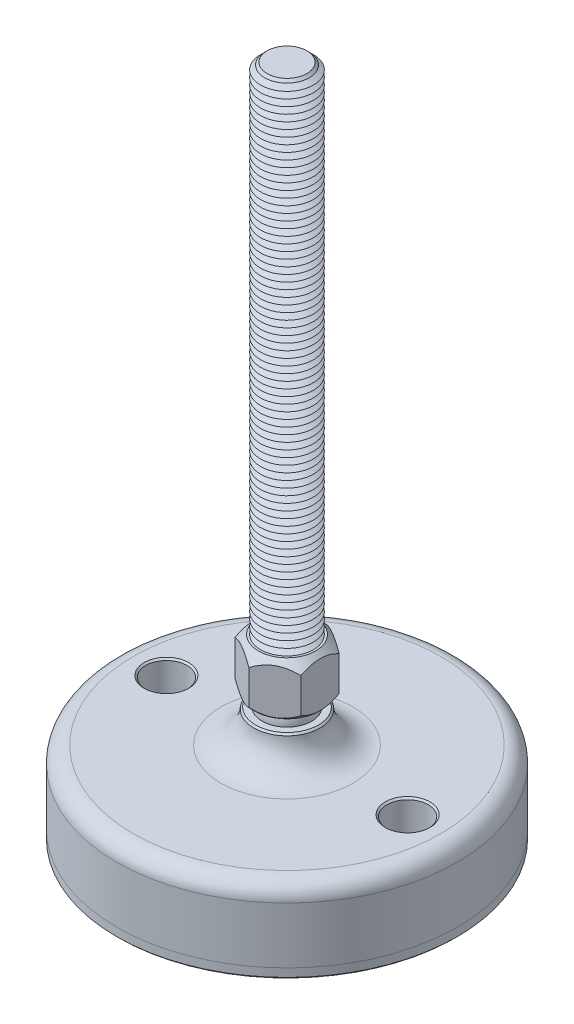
ISO-10303-21;
HEADER;
FILE_DESCRIPTION(('STEP AP214'),'2;1');
FILE_NAME('part.step','',(''),(''),'','','');
FILE_SCHEMA(('AUTOMOTIVE_DESIGN { 1 0 10303 214 1 1 1 1 }'));
ENDSEC;
DATA;
#1=APPLICATION_CONTEXT('core data for automotive mechanical design processes');
#2=APPLICATION_PROTOCOL_DEFINITION('international standard','automotive_design',2000,#1);
#3=PRODUCT_CONTEXT('',#1,'mechanical');
#4=PRODUCT('Part','Part','',(#3));
#5=PRODUCT_RELATED_PRODUCT_CATEGORY('part','',(#4));
#6=PRODUCT_DEFINITION_FORMATION('','',#4);
#7=PRODUCT_DEFINITION_CONTEXT('part definition',#1,'design');
#8=PRODUCT_DEFINITION('design','',#6,#7);
#9=PRODUCT_DEFINITION_SHAPE('','',#8);
#10=(LENGTH_UNIT() NAMED_UNIT(*) SI_UNIT(.MILLI.,.METRE.));
#11=(NAMED_UNIT(*) PLANE_ANGLE_UNIT() SI_UNIT($,.RADIAN.));
#12=(NAMED_UNIT(*) SI_UNIT($,.STERADIAN.) SOLID_ANGLE_UNIT());
#13=UNCERTAINTY_MEASURE_WITH_UNIT(LENGTH_MEASURE(1.E-05),#10,'distance_accuracy_value','');
#14=(GEOMETRIC_REPRESENTATION_CONTEXT(3) GLOBAL_UNCERTAINTY_ASSIGNED_CONTEXT((#13)) GLOBAL_UNIT_ASSIGNED_CONTEXT((#10,
#11,#12)) REPRESENTATION_CONTEXT('',''));
#15=CARTESIAN_POINT('',(0.,0.,0.));
#16=DIRECTION('',(0.,0.,1.));
#17=DIRECTION('',(1.,0.,0.));
#18=AXIS2_PLACEMENT_3D('',#15,#16,#17);
#19=CARTESIAN_POINT('',(0.,-32.,0.));
#20=DIRECTION('',(0.,1.,0.));
#21=DIRECTION('',(0.,0.,1.));
#22=AXIS2_PLACEMENT_3D('',#19,#20,#21);
#23=PLANE('',#22);
#24=CARTESIAN_POINT('',(-36.5,-32.,0.));
#25=DIRECTION('',(0.,1.,0.));
#26=DIRECTION('',(0.,0.,1.));
#27=AXIS2_PLACEMENT_3D('',#24,#25,#26);
#28=CIRCLE('',#27,6.25);
#29=CARTESIAN_POINT('',(-36.5,-32.,6.25));
#30=VERTEX_POINT('',#29);
#31=EDGE_CURVE('P0_E43',#30,#30,#28,.T.);
#32=ORIENTED_EDGE('',*,*,#31,.F.);
#33=EDGE_LOOP('',(#32));
#34=FACE_BOUND('',#33,.T.);
#35=CARTESIAN_POINT('',(36.5,-32.,0.));
#36=DIRECTION('',(0.,1.,0.));
#37=DIRECTION('',(0.,0.,1.));
#38=AXIS2_PLACEMENT_3D('',#35,#36,#37);
#39=CIRCLE('',#38,6.25);
#40=CARTESIAN_POINT('',(36.5,-32.,6.25));
#41=VERTEX_POINT('',#40);
#42=EDGE_CURVE('P0_E44',#41,#41,#39,.T.);
#43=ORIENTED_EDGE('',*,*,#42,.F.);
#44=EDGE_LOOP('',(#43));
#45=FACE_BOUND('',#44,.T.);
#46=CARTESIAN_POINT('',(0.,-32.,0.));
#47=DIRECTION('',(0.,1.,0.));
#48=DIRECTION('',(0.,0.,1.));
#49=AXIS2_PLACEMENT_3D('',#46,#47,#48);
#50=CIRCLE('',#49,51.5);
#51=CARTESIAN_POINT('',(0.,-32.,51.5));
#52=VERTEX_POINT('',#51);
#53=EDGE_CURVE('P0_E40',#52,#52,#50,.T.);
#54=ORIENTED_EDGE('',*,*,#53,.T.);
#55=EDGE_LOOP('',(#54));
#56=FACE_BOUND('',#55,.T.);
#57=ADVANCED_FACE('P0_F14',(#34,#45,#56),#23,.T.);
#58=CARTESIAN_POINT('',(0.,43.1654938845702,0.));
#59=DIRECTION('',(0.,1.,0.));
#60=DIRECTION('',(0.,0.,1.));
#61=AXIS2_PLACEMENT_3D('',#58,#59,#60);
#62=CYLINDRICAL_SURFACE('',#61,51.5);
#63=CARTESIAN_POINT('',(0.,-34.5,0.));
#64=DIRECTION('',(0.,-1.,0.));
#65=DIRECTION('',(0.,0.,-1.));
#66=AXIS2_PLACEMENT_3D('',#63,#64,#65);
#67=CIRCLE('',#66,51.5);
#68=CARTESIAN_POINT('',(0.,-34.5,-51.5));
#69=VERTEX_POINT('',#68);
#70=EDGE_CURVE('P0_E37',#69,#69,#67,.F.);
#71=ORIENTED_EDGE('',*,*,#70,.T.);
#72=EDGE_LOOP('',(#71));
#73=FACE_BOUND('',#72,.T.);
#74=ORIENTED_EDGE('',*,*,#53,.F.);
#75=EDGE_LOOP('',(#74));
#76=FACE_BOUND('',#75,.T.);
#77=ADVANCED_FACE('P0_F54',(#73,#76),#62,.T.);
#78=CARTESIAN_POINT('',(0.,-35.,51.5));
#79=DIRECTION('',(0.,-1.,0.));
#80=DIRECTION('',(0.,0.,-1.));
#81=AXIS2_PLACEMENT_3D('',#78,#79,#80);
#82=PLANE('',#81);
#83=CARTESIAN_POINT('',(36.5,-35.,0.));
#84=DIRECTION('',(0.,-1.,0.));
#85=DIRECTION('',(0.,0.,-1.));
#86=AXIS2_PLACEMENT_3D('',#83,#84,#85);
#87=CIRCLE('',#86,6.75000000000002);
#88=CARTESIAN_POINT('',(36.5,-35.,-6.75000000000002));
#89=VERTEX_POINT('',#88);
#90=EDGE_CURVE('P0_E25',#89,#89,#87,.F.);
#91=ORIENTED_EDGE('',*,*,#90,.T.);
#92=EDGE_LOOP('',(#91));
#93=FACE_BOUND('',#92,.T.);
#94=CARTESIAN_POINT('',(-36.5,-35.,0.));
#95=DIRECTION('',(0.,-1.,0.));
#96=DIRECTION('',(0.,0.,-1.));
#97=AXIS2_PLACEMENT_3D('',#94,#95,#96);
#98=CIRCLE('',#97,6.74999999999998);
#99=CARTESIAN_POINT('',(-36.5,-35.,-6.74999999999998));
#100=VERTEX_POINT('',#99);
#101=EDGE_CURVE('P0_E29',#100,#100,#98,.F.);
#102=ORIENTED_EDGE('',*,*,#101,.T.);
#103=EDGE_LOOP('',(#102));
#104=FACE_BOUND('',#103,.T.);
#105=CARTESIAN_POINT('',(0.,-35.,0.));
#106=DIRECTION('',(0.,-1.,0.));
#107=DIRECTION('',(0.,0.,-1.));
#108=AXIS2_PLACEMENT_3D('',#105,#106,#107);
#109=CIRCLE('',#108,51.);
#110=CARTESIAN_POINT('',(0.,-35.,-51.));
#111=VERTEX_POINT('',#110);
#112=EDGE_CURVE('P0_E34',#111,#111,#109,.T.);
#113=ORIENTED_EDGE('',*,*,#112,.T.);
#114=EDGE_LOOP('',(#113));
#115=FACE_BOUND('',#114,.T.);
#116=ADVANCED_FACE('P0_F61',(#93,#104,#115),#82,.T.);
#117=CARTESIAN_POINT('',(0.,-34.5,0.));
#118=DIRECTION('',(0.,1.,0.));
#119=DIRECTION('',(0.,0.,1.));
#120=AXIS2_PLACEMENT_3D('',#117,#118,#119);
#121=CONICAL_SURFACE('',#120,51.5,0.785398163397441);
#122=ORIENTED_EDGE('',*,*,#112,.F.);
#123=EDGE_LOOP('',(#122));
#124=FACE_BOUND('',#123,.T.);
#125=ORIENTED_EDGE('',*,*,#70,.F.);
#126=EDGE_LOOP('',(#125));
#127=FACE_BOUND('',#126,.T.);
#128=ADVANCED_FACE('P0_F68',(#124,#127),#121,.T.);
#129=CARTESIAN_POINT('',(36.5,-35.,0.));
#130=DIRECTION('',(0.,1.,0.));
#131=DIRECTION('',(0.,0.,1.));
#132=AXIS2_PLACEMENT_3D('',#129,#130,#131);
#133=CYLINDRICAL_SURFACE('',#132,6.25);
#134=CARTESIAN_POINT('',(36.5,-34.5,0.));
#135=DIRECTION('',(0.,-1.,0.));
#136=DIRECTION('',(0.,0.,-1.));
#137=AXIS2_PLACEMENT_3D('',#134,#135,#136);
#138=CIRCLE('',#137,6.25);
#139=CARTESIAN_POINT('',(36.5,-34.5,-6.25));
#140=VERTEX_POINT('',#139);
#141=EDGE_CURVE('P0_E21',#140,#140,#138,.T.);
#142=ORIENTED_EDGE('',*,*,#141,.T.);
#143=EDGE_LOOP('',(#142));
#144=FACE_BOUND('',#143,.T.);
#145=ORIENTED_EDGE('',*,*,#42,.T.);
#146=EDGE_LOOP('',(#145));
#147=FACE_BOUND('',#146,.T.);
#148=ADVANCED_FACE('P0_F74',(#144,#147),#133,.F.);
#149=CARTESIAN_POINT('',(-36.5,-35.,0.));
#150=DIRECTION('',(0.,1.,0.));
#151=DIRECTION('',(0.,0.,1.));
#152=AXIS2_PLACEMENT_3D('',#149,#150,#151);
#153=CYLINDRICAL_SURFACE('',#152,6.25);
#154=CARTESIAN_POINT('',(-36.5,-34.5,0.));
#155=DIRECTION('',(0.,-1.,0.));
#156=DIRECTION('',(0.,0.,-1.));
#157=AXIS2_PLACEMENT_3D('',#154,#155,#156);
#158=CIRCLE('',#157,6.25);
#159=CARTESIAN_POINT('',(-36.5,-34.5,-6.25));
#160=VERTEX_POINT('',#159);
#161=EDGE_CURVE('P0_E10',#160,#160,#158,.T.);
#162=ORIENTED_EDGE('',*,*,#161,.T.);
#163=EDGE_LOOP('',(#162));
#164=FACE_BOUND('',#163,.T.);
#165=ORIENTED_EDGE('',*,*,#31,.T.);
#166=EDGE_LOOP('',(#165));
#167=FACE_BOUND('',#166,.T.);
#168=ADVANCED_FACE('P0_F50',(#164,#167),#153,.F.);
#169=CARTESIAN_POINT('',(36.5,-35.,0.));
#170=DIRECTION('',(0.,-1.,0.));
#171=DIRECTION('',(0.,0.,-1.));
#172=AXIS2_PLACEMENT_3D('',#169,#170,#171);
#173=CONICAL_SURFACE('',#172,6.75000000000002,0.785398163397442);
#174=ORIENTED_EDGE('',*,*,#141,.F.);
#175=EDGE_LOOP('',(#174));
#176=FACE_BOUND('',#175,.T.);
#177=ORIENTED_EDGE('',*,*,#90,.F.);
#178=EDGE_LOOP('',(#177));
#179=FACE_BOUND('',#178,.T.);
#180=ADVANCED_FACE('P0_F76',(#176,#179),#173,.F.);
#181=CARTESIAN_POINT('',(-36.5,-35.,0.));
#182=DIRECTION('',(0.,-1.,0.));
#183=DIRECTION('',(0.,0.,-1.));
#184=AXIS2_PLACEMENT_3D('',#181,#182,#183);
#185=CONICAL_SURFACE('',#184,6.74999999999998,0.785398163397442);
#186=ORIENTED_EDGE('',*,*,#161,.F.);
#187=EDGE_LOOP('',(#186));
#188=FACE_BOUND('',#187,.T.);
#189=ORIENTED_EDGE('',*,*,#101,.F.);
#190=EDGE_LOOP('',(#189));
#191=FACE_BOUND('',#190,.T.);
#192=ADVANCED_FACE('P0_F16',(#188,#191),#185,.F.);
#193=CLOSED_SHELL('',(#57,#77,#116,#128,#148,#168,#180,#192));
#194=MANIFOLD_SOLID_BREP('P0_B1',#193);
#195=CARTESIAN_POINT('',(0.,3.75,0.));
#196=DIRECTION('',(0.,1.,0.));
#197=DIRECTION('',(0.,0.,1.));
#198=AXIS2_PLACEMENT_3D('',#195,#196,#197);
#199=PLANE('',#198);
#200=CARTESIAN_POINT('',(0.,3.75,0.));
#201=DIRECTION('',(0.,1.,0.));
#202=DIRECTION('',(0.,0.,1.));
#203=AXIS2_PLACEMENT_3D('',#200,#201,#202);
#204=CIRCLE('',#203,9.72829454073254);
#205=CARTESIAN_POINT('',(0.,3.75,9.72829454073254));
#206=VERTEX_POINT('',#205);
#207=EDGE_CURVE('P1_E223',#206,#206,#204,.T.);
#208=ORIENTED_EDGE('',*,*,#207,.F.);
#209=EDGE_LOOP('',(#208));
#210=FACE_BOUND('',#209,.T.);
#211=CARTESIAN_POINT('',(0.,3.75,0.));
#212=DIRECTION('',(0.,1.,0.));
#213=DIRECTION('',(0.,0.,1.));
#214=AXIS2_PLACEMENT_3D('',#211,#212,#213);
#215=CIRCLE('',#214,6.49519052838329);
#216=CARTESIAN_POINT('',(0.,3.75,6.49519052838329));
#217=VERTEX_POINT('',#216);
#218=EDGE_CURVE('P1_E25',#217,#217,#215,.F.);
#219=ORIENTED_EDGE('',*,*,#218,.F.);
#220=EDGE_LOOP('',(#219));
#221=FACE_BOUND('',#220,.T.);
#222=ADVANCED_FACE('P1_F16',(#210,#221),#199,.F.);
#223=CARTESIAN_POINT('',(0.,0.,0.));
#224=DIRECTION('',(0.,1.,0.));
#225=DIRECTION('',(0.,0.,-1.));
#226=AXIS2_PLACEMENT_3D('',#223,#224,#225);
#227=SPHERICAL_SURFACE('',#226,7.5);
#228=ORIENTED_EDGE('',*,*,#218,.T.);
#229=EDGE_LOOP('',(#228));
#230=FACE_BOUND('',#229,.T.);
#231=ADVANCED_FACE('P1_F205',(#230),#227,.T.);
#232=CARTESIAN_POINT('',(0.,3.75,0.));
#233=DIRECTION('',(0.,1.,0.));
#234=DIRECTION('',(0.,0.,1.));
#235=AXIS2_PLACEMENT_3D('',#232,#233,#234);
#236=CONICAL_SURFACE('',#235,9.72829454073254,0.785398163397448);
#237=ORIENTED_EDGE('',*,*,#207,.T.);
#238=EDGE_LOOP('',(#237));
#239=FACE_BOUND('',#238,.T.);
#240=CARTESIAN_POINT('',(-10.,9.59571642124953,-11.9394228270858));
#241=CARTESIAN_POINT('',(-10.,9.37430561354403,-11.6505452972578));
#242=CARTESIAN_POINT('',(-10.,9.15490936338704,-11.3600988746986));
#243=CARTESIAN_POINT('',(-10.,8.72106267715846,-10.7754314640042));
#244=CARTESIAN_POINT('',(-10.,8.50661343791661,-10.4812095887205));
#245=CARTESIAN_POINT('',(-10.,8.08205114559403,-9.88620330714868));
#246=CARTESIAN_POINT('',(-10.,7.87198437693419,-9.58538576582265));
#247=CARTESIAN_POINT('',(-10.,7.45926520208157,-8.97872312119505));
#248=CARTESIAN_POINT('',(-10.,7.25661228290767,-8.67287836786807));
#249=CARTESIAN_POINT('',(-10.,6.84809543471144,-8.03614350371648));
#250=CARTESIAN_POINT('',(-10.,6.64281401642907,-7.70487777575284));
#251=CARTESIAN_POINT('',(-10.,6.245142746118,-7.03457466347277));
#252=CARTESIAN_POINT('',(-10.,6.0527550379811,-6.69553599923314));
#253=CARTESIAN_POINT('',(-10.,5.68497951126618,-6.00961937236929));
#254=CARTESIAN_POINT('',(-10.,5.50954176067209,-5.66276839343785));
#255=CARTESIAN_POINT('',(-10.,5.17959635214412,-4.95932933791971));
#256=CARTESIAN_POINT('',(-10.,5.02507889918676,-4.60274591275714));
#257=CARTESIAN_POINT('',(-10.,4.75599518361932,-3.91353381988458));
#258=CARTESIAN_POINT('',(-10.,4.63902686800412,-3.58185263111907));
#259=CARTESIAN_POINT('',(-10.,4.43164927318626,-2.91013341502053));
#260=CARTESIAN_POINT('',(-10.,4.34124171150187,-2.57009484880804));
#261=CARTESIAN_POINT('',(-10.,4.19334931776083,-1.88955843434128));
#262=CARTESIAN_POINT('',(-10.,4.13527351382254,-1.54919119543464));
#263=CARTESIAN_POINT('',(-10.,4.05324021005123,-0.864347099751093));
#264=CARTESIAN_POINT('',(-10.,4.029275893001,-0.519871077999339));
#265=CARTESIAN_POINT('',(-10.,4.01745435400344,0.155191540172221));
#266=CARTESIAN_POINT('',(-10.,4.02812008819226,0.485752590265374));
#267=CARTESIAN_POINT('',(-10.,4.08160326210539,1.1442457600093));
#268=CARTESIAN_POINT('',(-10.,4.12442366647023,1.47217763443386));
#269=CARTESIAN_POINT('',(-10.,4.24054019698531,2.12859326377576));
#270=CARTESIAN_POINT('',(-10.,4.31437036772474,2.45698095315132));
#271=CARTESIAN_POINT('',(-10.,4.48844287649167,3.10654175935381));
#272=CARTESIAN_POINT('',(-10.,4.58868356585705,3.42771532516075));
#273=CARTESIAN_POINT('',(-10.,4.81839210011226,4.08271396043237));
#274=CARTESIAN_POINT('',(-10.,4.94932842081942,4.41601827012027));
#275=CARTESIAN_POINT('',(-10.,5.23140828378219,5.07403931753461));
#276=CARTESIAN_POINT('',(-10.,5.38256099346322,5.3987520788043));
#277=CARTESIAN_POINT('',(-10.,5.70148727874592,6.04113299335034));
#278=CARTESIAN_POINT('',(-10.,5.86931223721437,6.35877542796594));
#279=CARTESIAN_POINT('',(-10.,6.21788686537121,6.98677627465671));
#280=CARTESIAN_POINT('',(-10.,6.39863453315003,7.29713580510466));
#281=CARTESIAN_POINT('',(-10.,6.76133545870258,7.89633938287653));
#282=CARTESIAN_POINT('',(-10.,6.94278731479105,8.18548854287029));
#283=CARTESIAN_POINT('',(-10.,7.31339871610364,8.75881961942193));
#284=CARTESIAN_POINT('',(-10.,7.50255884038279,9.04300116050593));
#285=CARTESIAN_POINT('',(-10.,7.8856676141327,9.6047584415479));
#286=CARTESIAN_POINT('',(-10.,8.07956548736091,9.88236893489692));
#287=CARTESIAN_POINT('',(-10.,8.47254700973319,10.4337838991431));
#288=CARTESIAN_POINT('',(-10.,8.67162921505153,10.7075893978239));
#289=CARTESIAN_POINT('',(-10.,8.87283307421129,10.9797992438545));
#290=B_SPLINE_CURVE_WITH_KNOTS('',3,(#240,#241,#242,#243,#244,#245,#246,#247,#248,#249,#250,
#251,#252,#253,#254,#255,#256,#257,#258,#259,#260,#261,#262,#263,#264,#265,#266,#267,#268,#269,
#270,#271,#272,#273,#274,#275,#276,#277,#278,#279,#280,#281,#282,#283,#284,#285,#286,#287,#288,
#289),.UNSPECIFIED.,.F.,.F.,(4,2,2,2,2,2,2,2,2,2,2,2,2,2,2,2,2,2,2,2,2,2,2,2,4),(0.,
1.09192545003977,2.18411235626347,3.28473497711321,4.3852812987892,5.5541916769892,
6.72329593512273,7.88884387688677,9.05384420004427,10.1080362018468,11.1622963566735,
12.1965943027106,13.2306855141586,14.2212593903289,15.2119246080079,16.2203997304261,
17.2288119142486,18.3022883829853,19.3762532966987,20.4536373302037,21.5308548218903,
22.5548150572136,23.5788523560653,24.5946500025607,25.6101677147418),.UNSPECIFIED.);
#291=CARTESIAN_POINT('',(-10.,5.56871084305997,-5.77350269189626));
#292=VERTEX_POINT('',#291);
#293=CARTESIAN_POINT('',(-10.,5.56871084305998,5.77350269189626));
#294=VERTEX_POINT('',#293);
#295=EDGE_CURVE('P1_E188',#292,#294,#290,.T.);
#296=ORIENTED_EDGE('',*,*,#295,.F.);
#297=CARTESIAN_POINT('',(0.000199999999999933,5.56882631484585,-11.5471208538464));
#298=CARTESIAN_POINT('',(-0.171722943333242,5.4695807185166,-11.447861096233));
#299=CARTESIAN_POINT('',(-0.344992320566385,5.37336355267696,-11.3478239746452));
#300=CARTESIAN_POINT('',(-0.694433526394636,5.18794806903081,-11.1460740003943));
#301=CARTESIAN_POINT('',(-0.870606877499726,5.09875358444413,-11.0443602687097));
#302=CARTESIAN_POINT('',(-1.22689656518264,4.92796770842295,-10.8386563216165));
#303=CARTESIAN_POINT('',(-1.40702970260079,4.84642277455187,-10.7346564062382));
#304=CARTESIAN_POINT('',(-1.77025459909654,4.69270708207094,-10.52494841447));
#305=CARTESIAN_POINT('',(-1.95334590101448,4.62053489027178,-10.4192406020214));
#306=CARTESIAN_POINT('',(-2.31954331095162,4.4878482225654,-10.2078164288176));
#307=CARTESIAN_POINT('',(-2.50260441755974,4.42716910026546,-10.1021260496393));
#308=CARTESIAN_POINT('',(-2.87129282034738,4.31731511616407,-9.88926370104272));
#309=CARTESIAN_POINT('',(-3.05691983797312,4.26813901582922,-9.78209189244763));
#310=CARTESIAN_POINT('',(-3.42994608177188,4.1825291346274,-9.56672509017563));
#311=CARTESIAN_POINT('',(-3.61734032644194,4.14606667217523,-9.45853297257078));
#312=CARTESIAN_POINT('',(-3.99370204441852,4.08668528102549,-9.24124043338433));
#313=CARTESIAN_POINT('',(-4.1826692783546,4.06376432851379,-9.13214015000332));
#314=CARTESIAN_POINT('',(-4.64316633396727,4.0253323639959,-8.86627205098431));
#315=CARTESIAN_POINT('',(-4.91519388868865,4.01726744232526,-8.70921686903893));
#316=CARTESIAN_POINT('',(-5.45875701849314,4.03080424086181,-8.39539054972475));
#317=CARTESIAN_POINT('',(-5.7302923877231,4.05241636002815,-8.23861953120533));
#318=CARTESIAN_POINT('',(-6.27080349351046,4.12403157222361,-7.92655529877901));
#319=CARTESIAN_POINT('',(-6.53977602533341,4.17406641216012,-7.77126393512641));
#320=CARTESIAN_POINT('',(-7.07309796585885,4.29980733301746,-7.46335036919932));
#321=CARTESIAN_POINT('',(-7.33744772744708,4.3755114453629,-7.31072796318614));
#322=CARTESIAN_POINT('',(-7.80670351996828,4.53125365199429,-7.03980300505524));
#323=CARTESIAN_POINT('',(-8.01264886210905,4.60719488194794,-6.92090040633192));
#324=CARTESIAN_POINT('',(-8.42084280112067,4.77131434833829,-6.68522952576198));
#325=CARTESIAN_POINT('',(-8.62309128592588,4.85949295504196,-6.5684613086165));
#326=CARTESIAN_POINT('',(-9.02325448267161,5.04611070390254,-6.33742697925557));
#327=CARTESIAN_POINT('',(-9.22118057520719,5.1445175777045,-6.2231542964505));
#328=CARTESIAN_POINT('',(-9.61336795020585,5.35030005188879,-5.99672480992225));
#329=CARTESIAN_POINT('',(-9.80763139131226,5.45767015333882,-5.88456675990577));
#330=CARTESIAN_POINT('',(-10.0002,5.56882631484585,-5.77338722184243));
#331=B_SPLINE_CURVE_WITH_KNOTS('',3,(#297,#298,#299,#300,#301,#302,#303,#304,#305,#306,#307,
#308,#309,#310,#311,#312,#313,#314,#315,#316,#317,#318,#319,#320,#321,#322,#323,#324,#325,#326,
#327,#328,#329,#330),.UNSPECIFIED.,.F.,.F.,(4,2,2,2,2,2,2,2,2,2,2,2,2,2,2,2,4),(0.,
0.665863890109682,1.33208874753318,2.00212824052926,2.67206515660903,3.33152613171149,
3.99091606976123,4.64880867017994,5.30660292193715,6.24777541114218,7.18927777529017,
8.13183382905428,9.07431761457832,9.82287578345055,10.5714566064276,11.3177436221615,
12.0635761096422),.UNSPECIFIED.);
#332=CARTESIAN_POINT('',(0.,5.56871084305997,-11.5470053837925));
#333=VERTEX_POINT('',#332);
#334=EDGE_CURVE('P1_E182',#333,#292,#331,.T.);
#335=ORIENTED_EDGE('',*,*,#334,.F.);
#336=CARTESIAN_POINT('',(10.0002,5.56882631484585,-5.77338722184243));
#337=CARTESIAN_POINT('',(9.82827705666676,5.4695807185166,-5.87264697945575));
#338=CARTESIAN_POINT('',(9.65500767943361,5.37336355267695,-5.97268410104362));
#339=CARTESIAN_POINT('',(9.30556647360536,5.18794806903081,-6.17443407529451));
#340=CARTESIAN_POINT('',(9.12939312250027,5.09875358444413,-6.27614780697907));
#341=CARTESIAN_POINT('',(8.77310343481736,4.92796770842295,-6.48185175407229));
#342=CARTESIAN_POINT('',(8.59297029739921,4.84642277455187,-6.58585166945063));
#343=CARTESIAN_POINT('',(8.22974540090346,4.69270708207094,-6.79555966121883));
#344=CARTESIAN_POINT('',(8.04665409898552,4.62053489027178,-6.90126747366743));
#345=CARTESIAN_POINT('',(7.68045668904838,4.4878482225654,-7.11269164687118));
#346=CARTESIAN_POINT('',(7.49739558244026,4.42716910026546,-7.21838202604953));
#347=CARTESIAN_POINT('',(7.12870717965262,4.31731511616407,-7.43124437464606));
#348=CARTESIAN_POINT('',(6.94308016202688,4.26813901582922,-7.53841618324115));
#349=CARTESIAN_POINT('',(6.57005391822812,4.1825291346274,-7.75378298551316));
#350=CARTESIAN_POINT('',(6.38265967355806,4.14606667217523,-7.861975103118));
#351=CARTESIAN_POINT('',(6.00629795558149,4.08668528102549,-8.07926764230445));
#352=CARTESIAN_POINT('',(5.81733072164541,4.06376432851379,-8.18836792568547));
#353=CARTESIAN_POINT('',(5.35683366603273,4.0253323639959,-8.45423602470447));
#354=CARTESIAN_POINT('',(5.08480611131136,4.01726744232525,-8.61129120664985));
#355=CARTESIAN_POINT('',(4.54124298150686,4.03080424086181,-8.92511752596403));
#356=CARTESIAN_POINT('',(4.2697076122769,4.05241636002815,-9.08188854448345));
#357=CARTESIAN_POINT('',(3.72919650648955,4.12403157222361,-9.39395277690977));
#358=CARTESIAN_POINT('',(3.46022397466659,4.17406641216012,-9.54924414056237));
#359=CARTESIAN_POINT('',(2.92690203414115,4.29980733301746,-9.85715770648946));
#360=CARTESIAN_POINT('',(2.66255227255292,4.37551144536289,-10.0097801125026));
#361=CARTESIAN_POINT('',(2.19329648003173,4.53125365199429,-10.2807050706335));
#362=CARTESIAN_POINT('',(1.98735113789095,4.60719488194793,-10.3996076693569));
#363=CARTESIAN_POINT('',(1.57915719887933,4.77131434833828,-10.6352785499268));
#364=CARTESIAN_POINT('',(1.37690871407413,4.85949295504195,-10.7520467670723));
#365=CARTESIAN_POINT('',(0.976745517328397,5.04611070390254,-10.9830810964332));
#366=CARTESIAN_POINT('',(0.77881942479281,5.1445175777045,-11.0973537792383));
#367=CARTESIAN_POINT('',(0.386632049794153,5.35030005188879,-11.3237832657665));
#368=CARTESIAN_POINT('',(0.192368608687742,5.45767015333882,-11.435941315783));
#369=CARTESIAN_POINT('',(-0.000199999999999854,5.56882631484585,-11.5471208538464));
#370=B_SPLINE_CURVE_WITH_KNOTS('',3,(#336,#337,#338,#339,#340,#341,#342,#343,#344,#345,#346,
#347,#348,#349,#350,#351,#352,#353,#354,#355,#356,#357,#358,#359,#360,#361,#362,#363,#364,#365,
#366,#367,#368,#369),.UNSPECIFIED.,.F.,.F.,(4,2,2,2,2,2,2,2,2,2,2,2,2,2,2,2,4),(0.,
0.665863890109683,1.33208874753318,2.00212824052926,2.67206515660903,3.33152613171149,
3.99091606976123,4.64880867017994,5.30660292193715,6.24777541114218,7.18927777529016,
8.13183382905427,9.07431761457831,9.82287578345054,10.5714566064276,11.3177436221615,
12.0635761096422),.UNSPECIFIED.);
#371=CARTESIAN_POINT('',(9.99999999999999,5.56871084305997,-5.77350269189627));
#372=VERTEX_POINT('',#371);
#373=EDGE_CURVE('P1_E170',#372,#333,#370,.T.);
#374=ORIENTED_EDGE('',*,*,#373,.F.);
#375=CARTESIAN_POINT('',(10.,9.59571642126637,-11.9394228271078));
#376=CARTESIAN_POINT('',(10.,9.37430561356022,-11.6505452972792));
#377=CARTESIAN_POINT('',(10.,9.15490936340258,-11.3600988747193));
#378=CARTESIAN_POINT('',(10.,8.7210626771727,-10.7754314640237));
#379=CARTESIAN_POINT('',(10.,8.5066134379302,-10.4812095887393));
#380=CARTESIAN_POINT('',(10.,8.08205114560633,-9.88620330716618));
#381=CARTESIAN_POINT('',(10.,7.87198437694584,-9.58538576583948));
#382=CARTESIAN_POINT('',(10.,7.45926520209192,-8.97872312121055));
#383=CARTESIAN_POINT('',(10.,7.25661228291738,-8.67287836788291));
#384=CARTESIAN_POINT('',(10.,6.84809543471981,-8.03614350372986));
#385=CARTESIAN_POINT('',(10.,6.64281401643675,-7.70487777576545));
#386=CARTESIAN_POINT('',(10.,6.24514274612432,-7.03457466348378));
#387=CARTESIAN_POINT('',(10.,6.05275503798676,-6.69553599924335));
#388=CARTESIAN_POINT('',(10.,5.68497951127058,-6.00961937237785));
#389=CARTESIAN_POINT('',(10.,5.50954176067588,-5.66276839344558));
#390=CARTESIAN_POINT('',(10.,5.17959635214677,-4.95932933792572));
#391=CARTESIAN_POINT('',(10.,5.02507889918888,-4.60274591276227));
#392=CARTESIAN_POINT('',(10.,4.75599518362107,-3.91353381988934));
#393=CARTESIAN_POINT('',(10.,4.63902686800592,-3.58185263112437));
#394=CARTESIAN_POINT('',(10.,4.43164927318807,-2.91013341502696));
#395=CARTESIAN_POINT('',(10.,4.34124171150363,-2.57009484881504));
#396=CARTESIAN_POINT('',(10.,4.19334931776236,-1.8895584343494));
#397=CARTESIAN_POINT('',(10.,4.13527351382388,-1.54919119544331));
#398=CARTESIAN_POINT('',(10.,4.05324021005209,-0.86434709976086));
#399=CARTESIAN_POINT('',(10.,4.02927589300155,-0.519871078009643));
#400=CARTESIAN_POINT('',(10.,4.01745435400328,0.155191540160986));
#401=CARTESIAN_POINT('',(10.,4.0281200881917,0.485752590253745));
#402=CARTESIAN_POINT('',(10.,4.08160326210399,1.14424575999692));
#403=CARTESIAN_POINT('',(10.,4.12442366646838,1.47217763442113));
#404=CARTESIAN_POINT('',(10.,4.24054019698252,2.12859326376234));
#405=CARTESIAN_POINT('',(10.,4.31437036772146,2.45698095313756));
#406=CARTESIAN_POINT('',(10.,4.48844287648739,3.1065417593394));
#407=CARTESIAN_POINT('',(10.,4.58868356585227,3.42771532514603));
#408=CARTESIAN_POINT('',(10.,4.81839210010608,4.08271396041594));
#409=CARTESIAN_POINT('',(10.,4.94932842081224,4.41601827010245));
#410=CARTESIAN_POINT('',(10.,5.23140828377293,5.0740393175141));
#411=CARTESIAN_POINT('',(10.,5.38256099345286,5.39875207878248));
#412=CARTESIAN_POINT('',(10.,5.70148727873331,6.04113299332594));
#413=CARTESIAN_POINT('',(10.,5.86931223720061,6.35877542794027));
#414=CARTESIAN_POINT('',(10.,6.21788686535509,6.98677627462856));
#415=CARTESIAN_POINT('',(10.,6.39863453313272,7.29713580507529));
#416=CARTESIAN_POINT('',(10.,6.761335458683,7.89633938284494));
#417=CARTESIAN_POINT('',(10.,6.9427873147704,8.18548854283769));
#418=CARTESIAN_POINT('',(10.,7.31339871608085,8.75881961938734));
#419=CARTESIAN_POINT('',(10.,7.50255884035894,9.04300116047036));
#420=CARTESIAN_POINT('',(10.,7.88566761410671,9.60475844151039));
#421=CARTESIAN_POINT('',(10.,8.07956548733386,9.88236893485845));
#422=CARTESIAN_POINT('',(10.,8.47254700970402,10.4337838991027));
#423=CARTESIAN_POINT('',(10.,8.6716292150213,10.7075893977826));
#424=CARTESIAN_POINT('',(10.,8.87283307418,10.9797992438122));
#425=B_SPLINE_CURVE_WITH_KNOTS('',3,(#375,#376,#377,#378,#379,#380,#381,#382,#383,#384,#385,
#386,#387,#388,#389,#390,#391,#392,#393,#394,#395,#396,#397,#398,#399,#400,#401,#402,#403,#404,
#405,#406,#407,#408,#409,#410,#411,#412,#413,#414,#415,#416,#417,#418,#419,#420,#421,#422,#423,
#424),.UNSPECIFIED.,.F.,.F.,(4,2,2,2,2,2,2,2,2,2,2,2,2,2,2,2,2,2,2,2,2,2,2,2,4),(0.,
1.09192545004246,2.18411235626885,3.28473497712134,4.38528129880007,5.55419167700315,
6.72329593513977,7.88884387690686,9.05384420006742,10.1080362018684,11.1622963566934,
12.196594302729,13.2306855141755,14.2212593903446,15.2119246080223,16.2203997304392,
17.2288119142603,18.3022883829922,19.3762532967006,20.4536373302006,21.5308548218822,
22.5548150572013,23.5788523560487,24.5946500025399,25.6101677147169),.UNSPECIFIED.);
#426=CARTESIAN_POINT('',(10.,5.56871084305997,5.77350269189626));
#427=VERTEX_POINT('',#426);
#428=EDGE_CURVE('P1_E71',#427,#372,#425,.F.);
#429=ORIENTED_EDGE('',*,*,#428,.F.);
#430=CARTESIAN_POINT('',(-0.000200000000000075,5.56882631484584,11.5471208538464));
#431=CARTESIAN_POINT('',(0.171722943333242,5.4695807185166,11.447861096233));
#432=CARTESIAN_POINT('',(0.344992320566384,5.37336355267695,11.3478239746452));
#433=CARTESIAN_POINT('',(0.694433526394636,5.18794806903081,11.1460740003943));
#434=CARTESIAN_POINT('',(0.870606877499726,5.09875358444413,11.0443602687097));
#435=CARTESIAN_POINT('',(1.22689656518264,4.92796770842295,10.8386563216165));
#436=CARTESIAN_POINT('',(1.40702970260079,4.84642277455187,10.7346564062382));
#437=CARTESIAN_POINT('',(1.77025459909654,4.69270708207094,10.52494841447));
#438=CARTESIAN_POINT('',(1.95334590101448,4.62053489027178,10.4192406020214));
#439=CARTESIAN_POINT('',(2.31954331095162,4.4878482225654,10.2078164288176));
#440=CARTESIAN_POINT('',(2.50260441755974,4.42716910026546,10.1021260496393));
#441=CARTESIAN_POINT('',(2.87129282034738,4.31731511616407,9.88926370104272));
#442=CARTESIAN_POINT('',(3.05691983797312,4.26813901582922,9.78209189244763));
#443=CARTESIAN_POINT('',(3.42994608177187,4.18252913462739,9.56672509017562));
#444=CARTESIAN_POINT('',(3.61734032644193,4.14606667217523,9.45853297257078));
#445=CARTESIAN_POINT('',(3.99370204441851,4.08668528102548,9.24124043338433));
#446=CARTESIAN_POINT('',(4.18266927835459,4.06376432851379,9.13214015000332));
#447=CARTESIAN_POINT('',(4.64316633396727,4.0253323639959,8.86627205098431));
#448=CARTESIAN_POINT('',(4.91519388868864,4.01726744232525,8.70921686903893));
#449=CARTESIAN_POINT('',(5.45875701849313,4.03080424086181,8.39539054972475));
#450=CARTESIAN_POINT('',(5.7302923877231,4.05241636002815,8.23861953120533));
#451=CARTESIAN_POINT('',(6.27080349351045,4.1240315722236,7.92655529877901));
#452=CARTESIAN_POINT('',(6.53977602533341,4.17406641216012,7.77126393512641));
#453=CARTESIAN_POINT('',(7.07309796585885,4.29980733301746,7.46335036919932));
#454=CARTESIAN_POINT('',(7.33744772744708,4.37551144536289,7.31072796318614));
#455=CARTESIAN_POINT('',(7.80670351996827,4.53125365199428,7.03980300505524));
#456=CARTESIAN_POINT('',(8.01264886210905,4.60719488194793,6.92090040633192));
#457=CARTESIAN_POINT('',(8.42084280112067,4.77131434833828,6.68522952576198));
#458=CARTESIAN_POINT('',(8.62309128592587,4.85949295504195,6.5684613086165));
#459=CARTESIAN_POINT('',(9.0232544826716,5.04611070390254,6.33742697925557));
#460=CARTESIAN_POINT('',(9.22118057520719,5.1445175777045,6.2231542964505));
#461=CARTESIAN_POINT('',(9.61336795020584,5.35030005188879,5.99672480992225));
#462=CARTESIAN_POINT('',(9.80763139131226,5.45767015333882,5.88456675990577));
#463=CARTESIAN_POINT('',(10.0002,5.56882631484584,5.77338722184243));
#464=B_SPLINE_CURVE_WITH_KNOTS('',3,(#430,#431,#432,#433,#434,#435,#436,#437,#438,#439,#440,
#441,#442,#443,#444,#445,#446,#447,#448,#449,#450,#451,#452,#453,#454,#455,#456,#457,#458,#459,
#460,#461,#462,#463),.UNSPECIFIED.,.F.,.F.,(4,2,2,2,2,2,2,2,2,2,2,2,2,2,2,2,4),(0.,
0.665863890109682,1.33208874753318,2.00212824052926,2.67206515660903,3.33152613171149,
3.99091606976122,4.64880867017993,5.30660292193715,6.24777541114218,7.18927777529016,
8.13183382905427,9.07431761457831,9.82287578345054,10.5714566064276,11.3177436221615,
12.0635761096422),.UNSPECIFIED.);
#465=CARTESIAN_POINT('',(0.,5.56871084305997,11.5470053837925));
#466=VERTEX_POINT('',#465);
#467=EDGE_CURVE('P1_E68',#466,#427,#464,.T.);
#468=ORIENTED_EDGE('',*,*,#467,.F.);
#469=CARTESIAN_POINT('',(-10.0002,5.56882631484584,5.77338722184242));
#470=CARTESIAN_POINT('',(-9.82827705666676,5.4695807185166,5.87264697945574));
#471=CARTESIAN_POINT('',(-9.65500767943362,5.37336355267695,5.97268410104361));
#472=CARTESIAN_POINT('',(-9.30556647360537,5.18794806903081,6.1744340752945));
#473=CARTESIAN_POINT('',(-9.12939312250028,5.09875358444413,6.27614780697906));
#474=CARTESIAN_POINT('',(-8.77310343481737,4.92796770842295,6.48185175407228));
#475=CARTESIAN_POINT('',(-8.59297029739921,4.84642277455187,6.58585166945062));
#476=CARTESIAN_POINT('',(-8.22974540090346,4.69270708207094,6.79555966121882));
#477=CARTESIAN_POINT('',(-8.04665409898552,4.62053489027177,6.90126747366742));
#478=CARTESIAN_POINT('',(-7.68045668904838,4.48784822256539,7.11269164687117));
#479=CARTESIAN_POINT('',(-7.49739558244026,4.42716910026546,7.21838202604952));
#480=CARTESIAN_POINT('',(-7.12870717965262,4.31731511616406,7.43124437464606));
#481=CARTESIAN_POINT('',(-6.94308016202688,4.26813901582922,7.53841618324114));
#482=CARTESIAN_POINT('',(-6.57005391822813,4.18252913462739,7.75378298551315));
#483=CARTESIAN_POINT('',(-6.38265967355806,4.14606667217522,7.861975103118));
#484=CARTESIAN_POINT('',(-6.00629795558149,4.08668528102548,8.07926764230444));
#485=CARTESIAN_POINT('',(-5.81733072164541,4.06376432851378,8.18836792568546));
#486=CARTESIAN_POINT('',(-5.35683366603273,4.0253323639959,8.45423602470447));
#487=CARTESIAN_POINT('',(-5.08480611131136,4.01726744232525,8.61129120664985));
#488=CARTESIAN_POINT('',(-4.54124298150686,4.0308042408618,8.92511752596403));
#489=CARTESIAN_POINT('',(-4.2697076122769,4.05241636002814,9.08188854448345));
#490=CARTESIAN_POINT('',(-3.72919650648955,4.1240315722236,9.39395277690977));
#491=CARTESIAN_POINT('',(-3.46022397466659,4.17406641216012,9.54924414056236));
#492=CARTESIAN_POINT('',(-2.92690203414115,4.29980733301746,9.85715770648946));
#493=CARTESIAN_POINT('',(-2.66255227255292,4.37551144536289,10.0097801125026));
#494=CARTESIAN_POINT('',(-2.19329648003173,4.53125365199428,10.2807050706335));
#495=CARTESIAN_POINT('',(-1.98735113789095,4.60719488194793,10.3996076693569));
#496=CARTESIAN_POINT('',(-1.57915719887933,4.77131434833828,10.6352785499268));
#497=CARTESIAN_POINT('',(-1.37690871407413,4.85949295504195,10.7520467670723));
#498=CARTESIAN_POINT('',(-0.976745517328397,5.04611070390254,10.9830810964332));
#499=CARTESIAN_POINT('',(-0.778819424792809,5.1445175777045,11.0973537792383));
#500=CARTESIAN_POINT('',(-0.386632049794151,5.35030005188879,11.3237832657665));
#501=CARTESIAN_POINT('',(-0.192368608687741,5.45767015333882,11.435941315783));
#502=CARTESIAN_POINT('',(0.000199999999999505,5.56882631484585,11.5471208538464));
#503=B_SPLINE_CURVE_WITH_KNOTS('',3,(#469,#470,#471,#472,#473,#474,#475,#476,#477,#478,#479,
#480,#481,#482,#483,#484,#485,#486,#487,#488,#489,#490,#491,#492,#493,#494,#495,#496,#497,#498,
#499,#500,#501,#502),.UNSPECIFIED.,.F.,.F.,(4,2,2,2,2,2,2,2,2,2,2,2,2,2,2,2,4),(0.,
0.665863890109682,1.33208874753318,2.00212824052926,2.67206515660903,3.33152613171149,
3.99091606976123,4.64880867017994,5.30660292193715,6.24777541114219,7.18927777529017,
8.13183382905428,9.07431761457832,9.82287578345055,10.5714566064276,11.3177436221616,
12.0635761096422),.UNSPECIFIED.);
#504=EDGE_CURVE('P1_E40',#294,#466,#503,.T.);
#505=ORIENTED_EDGE('',*,*,#504,.F.);
#506=EDGE_LOOP('',(#296,#335,#374,#429,#468,#505));
#507=FACE_BOUND('',#506,.T.);
#508=ADVANCED_FACE('P1_F69',(#239,#507),#236,.T.);
#509=CARTESIAN_POINT('',(-10.,19.,-5.77350269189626));
#510=DIRECTION('',(1.,0.,0.));
#511=DIRECTION('',(0.,0.,-1.));
#512=AXIS2_PLACEMENT_3D('',#509,#510,#511);
#513=PLANE('',#512);
#514=DIRECTION('',(0.,-1.,0.));
#515=VECTOR('',#514,1.);
#516=CARTESIAN_POINT('',(-10.,19.,5.77350269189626));
#517=LINE('',#516,#515);
#518=CARTESIAN_POINT('',(-10.,16.1132486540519,5.77350269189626));
#519=VERTEX_POINT('',#518);
#520=EDGE_CURVE('P1_E84',#519,#294,#517,.T.);
#521=ORIENTED_EDGE('',*,*,#520,.F.);
#522=CARTESIAN_POINT('',(-10.,12.4093918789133,-11.5147208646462));
#523=CARTESIAN_POINT('',(-10.,12.6210295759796,-11.2343500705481));
#524=CARTESIAN_POINT('',(-10.,12.8306215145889,-10.9524094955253));
#525=CARTESIAN_POINT('',(-10.,13.2447979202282,-10.3847695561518));
#526=CARTESIAN_POINT('',(-10.,13.4493811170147,-10.0990692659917));
#527=CARTESIAN_POINT('',(-10.,13.8540786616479,-9.52120077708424));
#528=CARTESIAN_POINT('',(-10.,14.0541461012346,-9.22899961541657));
#529=CARTESIAN_POINT('',(-10.,14.4468132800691,-8.63963749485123));
#530=CARTESIAN_POINT('',(-10.,14.6394135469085,-8.34247688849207));
#531=CARTESIAN_POINT('',(-10.,15.0262335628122,-7.72525702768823));
#532=CARTESIAN_POINT('',(-10.,15.2199166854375,-7.40485974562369));
#533=CARTESIAN_POINT('',(-10.,15.5945399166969,-6.75658646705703));
#534=CARTESIAN_POINT('',(-10.,15.7754780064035,-6.4287092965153));
#535=CARTESIAN_POINT('',(-10.,16.1207071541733,-5.76550673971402));
#536=CARTESIAN_POINT('',(-10.,16.285047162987,-5.43020703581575));
#537=CARTESIAN_POINT('',(-10.,16.5934011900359,-4.75046311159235));
#538=CARTESIAN_POINT('',(-10.,16.7374244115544,-4.40602311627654));
#539=CARTESIAN_POINT('',(-10.,16.9894496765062,-3.73558113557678));
#540=CARTESIAN_POINT('',(-10.,17.0994177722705,-3.41032595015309));
#541=CARTESIAN_POINT('',(-10.,17.2932601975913,-2.75198473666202));
#542=CARTESIAN_POINT('',(-10.,17.377132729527,-2.4188981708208));
#543=CARTESIAN_POINT('',(-10.,17.5130086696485,-1.7524231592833));
#544=CARTESIAN_POINT('',(-10.,17.565558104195,-1.41914787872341));
#545=CARTESIAN_POINT('',(-10.,17.6377678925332,-0.749034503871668));
#546=CARTESIAN_POINT('',(-10.,17.6574338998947,-0.412197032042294));
#547=CARTESIAN_POINT('',(-10.,17.6624162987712,0.249527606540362));
#548=CARTESIAN_POINT('',(-10.,17.6489502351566,0.574406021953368));
#549=CARTESIAN_POINT('',(-10.,17.5910984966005,1.22138001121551));
#550=CARTESIAN_POINT('',(-10.,17.5467098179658,1.54347531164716));
#551=CARTESIAN_POINT('',(-10.,17.4286795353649,2.18799750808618));
#552=CARTESIAN_POINT('',(-10.,17.3545401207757,2.51033177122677));
#553=CARTESIAN_POINT('',(-10.,17.180962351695,3.14797698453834));
#554=CARTESIAN_POINT('',(-10.,17.0815261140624,3.46328851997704));
#555=CARTESIAN_POINT('',(-10.,16.8512186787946,4.11544298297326));
#556=CARTESIAN_POINT('',(-10.,16.7182795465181,4.45154819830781));
#557=CARTESIAN_POINT('',(-10.,16.431992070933,5.115028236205));
#558=CARTESIAN_POINT('',(-10.,16.2786342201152,5.4423989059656));
#559=CARTESIAN_POINT('',(-10.,15.9551580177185,6.09000973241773));
#560=CARTESIAN_POINT('',(-10.,15.7849870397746,6.41022338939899));
#561=CARTESIAN_POINT('',(-10.,15.4316458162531,7.04328175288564));
#562=CARTESIAN_POINT('',(-10.,15.2484776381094,7.35612762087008));
#563=CARTESIAN_POINT('',(-10.,14.8810750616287,7.96002022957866));
#564=CARTESIAN_POINT('',(-10.,14.6973474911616,8.25137695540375));
#565=CARTESIAN_POINT('',(-10.,14.3221662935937,8.82908851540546));
#566=CARTESIAN_POINT('',(-10.,14.1307120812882,9.1154429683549));
#567=CARTESIAN_POINT('',(-10.,13.7430400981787,9.68148259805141));
#568=CARTESIAN_POINT('',(-10.,13.5468736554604,9.96120305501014));
#569=CARTESIAN_POINT('',(-10.,13.149353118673,10.5168212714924));
#570=CARTESIAN_POINT('',(-10.,12.9480004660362,10.7927200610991));
#571=CARTESIAN_POINT('',(-10.,12.7445274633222,11.0670185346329));
#572=B_SPLINE_CURVE_WITH_KNOTS('',3,(#522,#523,#524,#525,#526,#527,#528,#529,#530,#531,#532,
#533,#534,#535,#536,#537,#538,#539,#540,#541,#542,#543,#544,#545,#546,#547,#548,#549,#550,#551,
#552,#553,#554,#555,#556,#557,#558,#559,#560,#561,#562,#563,#564,#565,#566,#567,#568,#569,#570,
#571),.UNSPECIFIED.,.F.,.F.,(4,2,2,2,2,2,2,2,2,2,2,2,2,2,2,2,2,2,2,2,2,2,2,2,4),(0.,
1.05386365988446,2.10799187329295,3.17028777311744,4.23250847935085,5.35544154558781,
6.47855209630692,7.5982472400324,8.71743353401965,9.74655549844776,10.7757483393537,
11.7864315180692,12.7969409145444,13.7708741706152,14.7449020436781,15.7359570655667,
16.7269291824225,17.8104078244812,18.8943927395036,19.981885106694,21.0692048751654,
22.1024062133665,23.1356859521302,24.1605722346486,25.1851766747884),.UNSPECIFIED.);
#573=CARTESIAN_POINT('',(-10.,16.1132486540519,-5.77350269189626));
#574=VERTEX_POINT('',#573);
#575=EDGE_CURVE('P1_E85',#519,#574,#572,.F.);
#576=ORIENTED_EDGE('',*,*,#575,.T.);
#577=DIRECTION('',(0.,-1.,0.));
#578=VECTOR('',#577,1.);
#579=CARTESIAN_POINT('',(-10.,19.,-5.77350269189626));
#580=LINE('',#579,#578);
#581=EDGE_CURVE('P1_E102',#574,#292,#580,.T.);
#582=ORIENTED_EDGE('',*,*,#581,.T.);
#583=ORIENTED_EDGE('',*,*,#295,.T.);
#584=EDGE_LOOP('',(#521,#576,#582,#583));
#585=FACE_BOUND('',#584,.T.);
#586=ADVANCED_FACE('P1_F196',(#585),#513,.F.);
#587=CARTESIAN_POINT('',(0.,19.,-11.5470053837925));
#588=DIRECTION('',(0.5,0.,0.866025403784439));
#589=DIRECTION('',(0.866025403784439,0.,-0.5));
#590=AXIS2_PLACEMENT_3D('',#587,#588,#589);
#591=PLANE('',#590);
#592=ORIENTED_EDGE('',*,*,#581,.F.);
#593=CARTESIAN_POINT('',(-10.0002,16.113133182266,-5.77338722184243));
#594=CARTESIAN_POINT('',(-9.82827705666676,16.2123787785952,-5.87264697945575));
#595=CARTESIAN_POINT('',(-9.65500767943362,16.3085959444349,-5.97268410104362));
#596=CARTESIAN_POINT('',(-9.30556647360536,16.494011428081,-6.17443407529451));
#597=CARTESIAN_POINT('',(-9.12939312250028,16.5832059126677,-6.27614780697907));
#598=CARTESIAN_POINT('',(-8.77310343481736,16.7539917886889,-6.48185175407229));
#599=CARTESIAN_POINT('',(-8.59297029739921,16.83553672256,-6.58585166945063));
#600=CARTESIAN_POINT('',(-8.22974540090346,16.9892524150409,-6.79555966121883));
#601=CARTESIAN_POINT('',(-8.04665409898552,17.0614246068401,-6.90126747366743));
#602=CARTESIAN_POINT('',(-7.68045668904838,17.1941112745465,-7.11269164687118));
#603=CARTESIAN_POINT('',(-7.49739558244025,17.2547903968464,-7.21838202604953));
#604=CARTESIAN_POINT('',(-7.12870717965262,17.3646443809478,-7.43124437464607));
#605=CARTESIAN_POINT('',(-6.94308016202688,17.4138204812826,-7.53841618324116));
#606=CARTESIAN_POINT('',(-6.57005391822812,17.4994303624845,-7.75378298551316));
#607=CARTESIAN_POINT('',(-6.38265967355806,17.5358928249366,-7.86197510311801));
#608=CARTESIAN_POINT('',(-6.00629795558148,17.5952742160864,-8.07926764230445));
#609=CARTESIAN_POINT('',(-5.8173307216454,17.6181951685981,-8.18836792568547));
#610=CARTESIAN_POINT('',(-5.35683366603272,17.6566271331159,-8.45423602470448));
#611=CARTESIAN_POINT('',(-5.08480611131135,17.6646920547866,-8.61129120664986));
#612=CARTESIAN_POINT('',(-4.54124298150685,17.65115525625,-8.92511752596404));
#613=CARTESIAN_POINT('',(-4.26970761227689,17.6295431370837,-9.08188854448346));
#614=CARTESIAN_POINT('',(-3.72919650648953,17.5579279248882,-9.39395277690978));
#615=CARTESIAN_POINT('',(-3.46022397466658,17.5078930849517,-9.54924414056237));
#616=CARTESIAN_POINT('',(-2.92690203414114,17.3821521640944,-9.85715770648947));
#617=CARTESIAN_POINT('',(-2.66255227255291,17.3064480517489,-10.0097801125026));
#618=CARTESIAN_POINT('',(-2.19329648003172,17.1507058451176,-10.2807050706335));
#619=CARTESIAN_POINT('',(-1.98735113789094,17.0747646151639,-10.3996076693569));
#620=CARTESIAN_POINT('',(-1.57915719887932,16.9106451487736,-10.6352785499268));
#621=CARTESIAN_POINT('',(-1.37690871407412,16.8224665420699,-10.7520467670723));
#622=CARTESIAN_POINT('',(-0.976745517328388,16.6358487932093,-10.9830810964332));
#623=CARTESIAN_POINT('',(-0.778819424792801,16.5374419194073,-11.0973537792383));
#624=CARTESIAN_POINT('',(-0.386632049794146,16.3316594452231,-11.3237832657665));
#625=CARTESIAN_POINT('',(-0.192368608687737,16.224289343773,-11.435941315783));
#626=CARTESIAN_POINT('',(0.000200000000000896,16.113133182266,-11.5471208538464));
#627=B_SPLINE_CURVE_WITH_KNOTS('',3,(#593,#594,#595,#596,#597,#598,#599,#600,#601,#602,#603,
#604,#605,#606,#607,#608,#609,#610,#611,#612,#613,#614,#615,#616,#617,#618,#619,#620,#621,#622,
#623,#624,#625,#626),.UNSPECIFIED.,.F.,.F.,(4,2,2,2,2,2,2,2,2,2,2,2,2,2,2,2,4),(0.,
0.665863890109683,1.33208874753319,2.00212824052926,2.67206515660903,3.3315261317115,
3.99091606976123,4.64880867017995,5.30660292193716,6.24777541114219,7.18927777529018,
8.13183382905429,9.07431761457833,9.82287578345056,10.5714566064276,11.3177436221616,
12.0635761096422),.UNSPECIFIED.);
#628=CARTESIAN_POINT('',(0.,16.1132486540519,-11.5470053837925));
#629=VERTEX_POINT('',#628);
#630=EDGE_CURVE('P1_E32',#574,#629,#627,.T.);
#631=ORIENTED_EDGE('',*,*,#630,.T.);
#632=DIRECTION('',(0.,-1.,0.));
#633=VECTOR('',#632,1.);
#634=CARTESIAN_POINT('',(0.,19.,-11.5470053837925));
#635=LINE('',#634,#633);
#636=EDGE_CURVE('P1_E99',#629,#333,#635,.T.);
#637=ORIENTED_EDGE('',*,*,#636,.T.);
#638=ORIENTED_EDGE('',*,*,#334,.T.);
#639=EDGE_LOOP('',(#592,#631,#637,#638));
#640=FACE_BOUND('',#639,.T.);
#641=ADVANCED_FACE('P1_F193',(#640),#591,.F.);
#642=CARTESIAN_POINT('',(10.,19.,-5.77350269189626));
#643=DIRECTION('',(-0.5,0.,0.866025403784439));
#644=DIRECTION('',(0.866025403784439,0.,0.5));
#645=AXIS2_PLACEMENT_3D('',#642,#643,#644);
#646=PLANE('',#645);
#647=ORIENTED_EDGE('',*,*,#636,.F.);
#648=CARTESIAN_POINT('',(-0.000199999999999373,16.113133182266,-11.5471208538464));
#649=CARTESIAN_POINT('',(0.171722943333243,16.2123787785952,-11.447861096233));
#650=CARTESIAN_POINT('',(0.344992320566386,16.3085959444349,-11.3478239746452));
#651=CARTESIAN_POINT('',(0.694433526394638,16.494011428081,-11.1460740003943));
#652=CARTESIAN_POINT('',(0.870606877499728,16.5832059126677,-11.0443602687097));
#653=CARTESIAN_POINT('',(1.22689656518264,16.7539917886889,-10.8386563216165));
#654=CARTESIAN_POINT('',(1.4070297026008,16.83553672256,-10.7346564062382));
#655=CARTESIAN_POINT('',(1.77025459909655,16.9892524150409,-10.52494841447));
#656=CARTESIAN_POINT('',(1.95334590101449,17.0614246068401,-10.4192406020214));
#657=CARTESIAN_POINT('',(2.31954331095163,17.1941112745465,-10.2078164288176));
#658=CARTESIAN_POINT('',(2.50260441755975,17.2547903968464,-10.1021260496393));
#659=CARTESIAN_POINT('',(2.87129282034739,17.3646443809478,-9.88926370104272));
#660=CARTESIAN_POINT('',(3.05691983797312,17.4138204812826,-9.78209189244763));
#661=CARTESIAN_POINT('',(3.42994608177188,17.4994303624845,-9.56672509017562));
#662=CARTESIAN_POINT('',(3.61734032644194,17.5358928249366,-9.45853297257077));
#663=CARTESIAN_POINT('',(3.99370204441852,17.5952742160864,-9.24124043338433));
#664=CARTESIAN_POINT('',(4.1826692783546,17.6181951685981,-9.13214015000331));
#665=CARTESIAN_POINT('',(4.64316633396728,17.6566271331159,-8.86627205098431));
#666=CARTESIAN_POINT('',(4.91519388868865,17.6646920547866,-8.70921686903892));
#667=CARTESIAN_POINT('',(5.45875701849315,17.65115525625,-8.39539054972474));
#668=CARTESIAN_POINT('',(5.73029238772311,17.6295431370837,-8.23861953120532));
#669=CARTESIAN_POINT('',(6.27080349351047,17.5579279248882,-7.92655529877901));
#670=CARTESIAN_POINT('',(6.53977602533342,17.5078930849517,-7.77126393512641));
#671=CARTESIAN_POINT('',(7.07309796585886,17.3821521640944,-7.46335036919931));
#672=CARTESIAN_POINT('',(7.33744772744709,17.3064480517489,-7.31072796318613));
#673=CARTESIAN_POINT('',(7.80670351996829,17.1507058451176,-7.03980300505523));
#674=CARTESIAN_POINT('',(8.01264886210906,17.0747646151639,-6.92090040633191));
#675=CARTESIAN_POINT('',(8.42084280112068,16.9106451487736,-6.68522952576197));
#676=CARTESIAN_POINT('',(8.62309128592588,16.8224665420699,-6.5684613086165));
#677=CARTESIAN_POINT('',(9.02325448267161,16.6358487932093,-6.33742697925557));
#678=CARTESIAN_POINT('',(9.2211805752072,16.5374419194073,-6.2231542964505));
#679=CARTESIAN_POINT('',(9.61336795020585,16.3316594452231,-5.99672480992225));
#680=CARTESIAN_POINT('',(9.80763139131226,16.224289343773,-5.88456675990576));
#681=CARTESIAN_POINT('',(10.0002,16.113133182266,-5.77338722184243));
#682=B_SPLINE_CURVE_WITH_KNOTS('',3,(#648,#649,#650,#651,#652,#653,#654,#655,#656,#657,#658,
#659,#660,#661,#662,#663,#664,#665,#666,#667,#668,#669,#670,#671,#672,#673,#674,#675,#676,#677,
#678,#679,#680,#681),.UNSPECIFIED.,.F.,.F.,(4,2,2,2,2,2,2,2,2,2,2,2,2,2,2,2,4),(0.,
0.665863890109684,1.33208874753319,2.00212824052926,2.67206515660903,3.3315261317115,
3.99091606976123,4.64880867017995,5.30660292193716,6.24777541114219,7.18927777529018,
8.13183382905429,9.07431761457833,9.82287578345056,10.5714566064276,11.3177436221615,
12.0635761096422),.UNSPECIFIED.);
#683=CARTESIAN_POINT('',(10.,16.1132486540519,-5.77350269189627));
#684=VERTEX_POINT('',#683);
#685=EDGE_CURVE('P1_E146',#629,#684,#682,.T.);
#686=ORIENTED_EDGE('',*,*,#685,.T.);
#687=DIRECTION('',(0.,-1.,0.));
#688=VECTOR('',#687,1.);
#689=CARTESIAN_POINT('',(10.,19.,-5.77350269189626));
#690=LINE('',#689,#688);
#691=EDGE_CURVE('P1_E94',#684,#372,#690,.T.);
#692=ORIENTED_EDGE('',*,*,#691,.T.);
#693=ORIENTED_EDGE('',*,*,#373,.T.);
#694=EDGE_LOOP('',(#647,#686,#692,#693));
#695=FACE_BOUND('',#694,.T.);
#696=ADVANCED_FACE('P1_F160',(#695),#646,.F.);
#697=CARTESIAN_POINT('',(10.,19.,5.77350269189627));
#698=DIRECTION('',(-1.,0.,0.));
#699=DIRECTION('',(0.,0.,1.));
#700=AXIS2_PLACEMENT_3D('',#697,#698,#699);
#701=PLANE('',#700);
#702=ORIENTED_EDGE('',*,*,#691,.F.);
#703=CARTESIAN_POINT('',(10.,12.4093918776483,-11.5147208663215));
#704=CARTESIAN_POINT('',(10.,12.6210295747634,-11.2343500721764));
#705=CARTESIAN_POINT('',(10.,12.8306215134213,-10.9524094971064));
#706=CARTESIAN_POINT('',(10.,13.2447979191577,-10.3847695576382));
#707=CARTESIAN_POINT('',(10.,13.4493811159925,-10.0990692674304));
#708=CARTESIAN_POINT('',(10.,13.8540786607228,-9.52120077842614));
#709=CARTESIAN_POINT('',(10.,14.0541461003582,-9.22899961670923));
#710=CARTESIAN_POINT('',(10.,14.4468132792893,-8.6396374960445));
#711=CARTESIAN_POINT('',(10.,14.6394135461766,-8.34247688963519));
#712=CARTESIAN_POINT('',(10.,15.02623356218,-7.72525702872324));
#713=CARTESIAN_POINT('',(10.,15.2199166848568,-7.40485974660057));
#714=CARTESIAN_POINT('',(10.,15.5945399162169,-6.75658646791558));
#715=CARTESIAN_POINT('',(10.,15.7754780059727,-6.42870929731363));
#716=CARTESIAN_POINT('',(10.,16.1207071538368,-5.76550674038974));
#717=CARTESIAN_POINT('',(10.,16.2850471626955,-5.4302070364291));
#718=CARTESIAN_POINT('',(10.,16.593401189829,-4.75046311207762));
#719=CARTESIAN_POINT('',(10.,16.7374244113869,-4.40602311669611));
#720=CARTESIAN_POINT('',(10.,16.9894496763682,-3.73558113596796));
#721=CARTESIAN_POINT('',(10.,17.09941777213,-3.41032595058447));
#722=CARTESIAN_POINT('',(10.,17.2932601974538,-2.75198473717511));
#723=CARTESIAN_POINT('',(10.,17.3771327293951,-2.4188981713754));
#724=CARTESIAN_POINT('',(10.,17.5130086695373,-1.75242315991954));
#725=CARTESIAN_POINT('',(10.,17.5655581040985,-1.41914787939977));
#726=CARTESIAN_POINT('',(10.,17.6377678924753,-0.749034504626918));
#727=CARTESIAN_POINT('',(10.,17.6574338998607,-0.41219703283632));
#728=CARTESIAN_POINT('',(10.,17.6624162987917,0.249527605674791));
#729=CARTESIAN_POINT('',(10.,17.6489502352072,0.574406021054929));
#730=CARTESIAN_POINT('',(10.,17.5910984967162,1.22138001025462));
#731=CARTESIAN_POINT('',(10.,17.5467098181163,1.5434753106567));
#732=CARTESIAN_POINT('',(10.,17.4286795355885,2.18799750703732));
#733=CARTESIAN_POINT('',(10.,17.3545401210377,2.51033177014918));
#734=CARTESIAN_POINT('',(10.,17.1809623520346,3.14797698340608));
#735=CARTESIAN_POINT('',(10.,17.0815261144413,3.46328851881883));
#736=CARTESIAN_POINT('',(10.,16.8512186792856,4.11544298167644));
#737=CARTESIAN_POINT('',(10.,16.7182795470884,4.45154819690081));
#738=CARTESIAN_POINT('',(10.,16.4319920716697,5.11502823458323));
#739=CARTESIAN_POINT('',(10.,16.2786342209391,5.44239890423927));
#740=CARTESIAN_POINT('',(10.,15.9551580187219,6.09000973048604));
#741=CARTESIAN_POINT('',(10.,15.7849870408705,6.41022338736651));
#742=CARTESIAN_POINT('',(10.,15.4316458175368,7.04328175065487));
#743=CARTESIAN_POINT('',(10.,15.2484776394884,7.35612761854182));
#744=CARTESIAN_POINT('',(10.,14.8810750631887,7.96002022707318));
#745=CARTESIAN_POINT('',(10.,14.6973474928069,8.25137695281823));
#746=CARTESIAN_POINT('',(10.,14.3221662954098,8.82908851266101));
#747=CARTESIAN_POINT('',(10.,14.13071208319,9.11544296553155));
#748=CARTESIAN_POINT('',(10.,13.7430401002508,9.68148259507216));
#749=CARTESIAN_POINT('',(10.,13.5468736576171,9.96120305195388));
#750=CARTESIAN_POINT('',(10.,13.149353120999,10.5168212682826));
#751=CARTESIAN_POINT('',(10.,12.9480004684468,10.7927200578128));
#752=CARTESIAN_POINT('',(10.,12.7445274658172,11.0670185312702));
#753=B_SPLINE_CURVE_WITH_KNOTS('',3,(#703,#704,#705,#706,#707,#708,#709,#710,#711,#712,#713,
#714,#715,#716,#717,#718,#719,#720,#721,#722,#723,#724,#725,#726,#727,#728,#729,#730,#731,#732,
#733,#734,#735,#736,#737,#738,#739,#740,#741,#742,#743,#744,#745,#746,#747,#748,#749,#750,#751,
#752),.UNSPECIFIED.,.F.,.F.,(4,2,2,2,2,2,2,2,2,2,2,2,2,2,2,2,2,2,2,2,2,2,2,2,4),(0.,
1.05386366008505,2.10799187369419,3.17028777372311,4.23250848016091,5.35544154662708,
6.47855209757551,7.59824724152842,8.71743353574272,9.74655550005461,10.7757483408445,
11.7864315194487,12.7969409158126,13.7708741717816,14.7449020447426,15.7359570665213,
16.7269291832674,17.8104078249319,18.8943927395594,19.9818851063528,21.0692048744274,
22.1024062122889,23.135685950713,24.1605722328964,25.1851766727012),.UNSPECIFIED.);
#754=CARTESIAN_POINT('',(10.,16.1132486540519,5.77350269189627));
#755=VERTEX_POINT('',#754);
#756=EDGE_CURVE('P1_E151',#684,#755,#753,.T.);
#757=ORIENTED_EDGE('',*,*,#756,.T.);
#758=DIRECTION('',(0.,-1.,0.));
#759=VECTOR('',#758,1.);
#760=CARTESIAN_POINT('',(10.,19.,5.77350269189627));
#761=LINE('',#760,#759);
#762=EDGE_CURVE('P1_E90',#755,#427,#761,.T.);
#763=ORIENTED_EDGE('',*,*,#762,.T.);
#764=ORIENTED_EDGE('',*,*,#428,.T.);
#765=EDGE_LOOP('',(#702,#757,#763,#764));
#766=FACE_BOUND('',#765,.T.);
#767=ADVANCED_FACE('P1_F157',(#766),#701,.F.);
#768=CARTESIAN_POINT('',(0.,19.,11.5470053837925));
#769=DIRECTION('',(-0.5,0.,-0.866025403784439));
#770=DIRECTION('',(-0.866025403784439,0.,0.5));
#771=AXIS2_PLACEMENT_3D('',#768,#769,#770);
#772=PLANE('',#771);
#773=ORIENTED_EDGE('',*,*,#762,.F.);
#774=CARTESIAN_POINT('',(10.0002,16.113133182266,5.77338722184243));
#775=CARTESIAN_POINT('',(9.82827705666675,16.2123787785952,5.87264697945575));
#776=CARTESIAN_POINT('',(9.65500767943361,16.3085959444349,5.97268410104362));
#777=CARTESIAN_POINT('',(9.30556647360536,16.494011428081,6.17443407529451));
#778=CARTESIAN_POINT('',(9.12939312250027,16.5832059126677,6.27614780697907));
#779=CARTESIAN_POINT('',(8.77310343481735,16.7539917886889,6.48185175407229));
#780=CARTESIAN_POINT('',(8.5929702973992,16.83553672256,6.58585166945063));
#781=CARTESIAN_POINT('',(8.22974540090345,16.9892524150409,6.79555966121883));
#782=CARTESIAN_POINT('',(8.04665409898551,17.0614246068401,6.90126747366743));
#783=CARTESIAN_POINT('',(7.68045668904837,17.1941112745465,7.11269164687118));
#784=CARTESIAN_POINT('',(7.49739558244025,17.2547903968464,7.21838202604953));
#785=CARTESIAN_POINT('',(7.12870717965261,17.3646443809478,7.43124437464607));
#786=CARTESIAN_POINT('',(6.94308016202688,17.4138204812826,7.53841618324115));
#787=CARTESIAN_POINT('',(6.57005391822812,17.4994303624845,7.75378298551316));
#788=CARTESIAN_POINT('',(6.38265967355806,17.5358928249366,7.86197510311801));
#789=CARTESIAN_POINT('',(6.00629795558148,17.5952742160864,8.07926764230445));
#790=CARTESIAN_POINT('',(5.8173307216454,17.6181951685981,8.18836792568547));
#791=CARTESIAN_POINT('',(5.35683366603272,17.6566271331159,8.45423602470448));
#792=CARTESIAN_POINT('',(5.08480611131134,17.6646920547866,8.61129120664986));
#793=CARTESIAN_POINT('',(4.54124298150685,17.65115525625,8.92511752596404));
#794=CARTESIAN_POINT('',(4.26970761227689,17.6295431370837,9.08188854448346));
#795=CARTESIAN_POINT('',(3.72919650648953,17.5579279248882,9.39395277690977));
#796=CARTESIAN_POINT('',(3.46022397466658,17.5078930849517,9.54924414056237));
#797=CARTESIAN_POINT('',(2.92690203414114,17.3821521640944,9.85715770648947));
#798=CARTESIAN_POINT('',(2.66255227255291,17.3064480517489,10.0097801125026));
#799=CARTESIAN_POINT('',(2.19329648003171,17.1507058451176,10.2807050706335));
#800=CARTESIAN_POINT('',(1.98735113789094,17.0747646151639,10.3996076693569));
#801=CARTESIAN_POINT('',(1.57915719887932,16.9106451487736,10.6352785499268));
#802=CARTESIAN_POINT('',(1.37690871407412,16.8224665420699,10.7520467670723));
#803=CARTESIAN_POINT('',(0.976745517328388,16.6358487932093,10.9830810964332));
#804=CARTESIAN_POINT('',(0.778819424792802,16.5374419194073,11.0973537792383));
#805=CARTESIAN_POINT('',(0.386632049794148,16.3316594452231,11.3237832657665));
#806=CARTESIAN_POINT('',(0.192368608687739,16.224289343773,11.435941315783));
#807=CARTESIAN_POINT('',(-0.000200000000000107,16.113133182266,11.5471208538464));
#808=B_SPLINE_CURVE_WITH_KNOTS('',3,(#774,#775,#776,#777,#778,#779,#780,#781,#782,#783,#784,
#785,#786,#787,#788,#789,#790,#791,#792,#793,#794,#795,#796,#797,#798,#799,#800,#801,#802,#803,
#804,#805,#806,#807),.UNSPECIFIED.,.F.,.F.,(4,2,2,2,2,2,2,2,2,2,2,2,2,2,2,2,4),(0.,
0.665863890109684,1.33208874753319,2.00212824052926,2.67206515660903,3.33152613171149,
3.99091606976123,4.64880867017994,5.30660292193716,6.24777541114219,7.18927777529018,
8.13183382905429,9.07431761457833,9.82287578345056,10.5714566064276,11.3177436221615,
12.0635761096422),.UNSPECIFIED.);
#809=CARTESIAN_POINT('',(0.,16.1132486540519,11.5470053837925));
#810=VERTEX_POINT('',#809);
#811=EDGE_CURVE('P1_E89',#755,#810,#808,.T.);
#812=ORIENTED_EDGE('',*,*,#811,.T.);
#813=DIRECTION('',(0.,-1.,0.));
#814=VECTOR('',#813,1.);
#815=CARTESIAN_POINT('',(0.,19.,11.5470053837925));
#816=LINE('',#815,#814);
#817=EDGE_CURVE('P1_E82',#810,#466,#816,.T.);
#818=ORIENTED_EDGE('',*,*,#817,.T.);
#819=ORIENTED_EDGE('',*,*,#467,.T.);
#820=EDGE_LOOP('',(#773,#812,#818,#819));
#821=FACE_BOUND('',#820,.T.);
#822=ADVANCED_FACE('P1_F88',(#821),#772,.F.);
#823=CARTESIAN_POINT('',(-10.,19.,5.77350269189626));
#824=DIRECTION('',(0.5,0.,-0.866025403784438));
#825=DIRECTION('',(-0.866025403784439,0.,-0.5));
#826=AXIS2_PLACEMENT_3D('',#823,#824,#825);
#827=PLANE('',#826);
#828=ORIENTED_EDGE('',*,*,#817,.F.);
#829=CARTESIAN_POINT('',(0.000200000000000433,16.113133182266,11.5471208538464));
#830=CARTESIAN_POINT('',(-0.171722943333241,16.2123787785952,11.447861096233));
#831=CARTESIAN_POINT('',(-0.344992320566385,16.3085959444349,11.3478239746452));
#832=CARTESIAN_POINT('',(-0.694433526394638,16.494011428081,11.1460740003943));
#833=CARTESIAN_POINT('',(-0.870606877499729,16.5832059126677,11.0443602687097));
#834=CARTESIAN_POINT('',(-1.22689656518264,16.7539917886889,10.8386563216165));
#835=CARTESIAN_POINT('',(-1.4070297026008,16.83553672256,10.7346564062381));
#836=CARTESIAN_POINT('',(-1.77025459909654,16.9892524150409,10.52494841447));
#837=CARTESIAN_POINT('',(-1.95334590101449,17.0614246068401,10.4192406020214));
#838=CARTESIAN_POINT('',(-2.31954331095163,17.1941112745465,10.2078164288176));
#839=CARTESIAN_POINT('',(-2.50260441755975,17.2547903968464,10.1021260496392));
#840=CARTESIAN_POINT('',(-2.87129282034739,17.3646443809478,9.88926370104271));
#841=CARTESIAN_POINT('',(-3.05691983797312,17.4138204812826,9.78209189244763));
#842=CARTESIAN_POINT('',(-3.42994608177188,17.4994303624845,9.56672509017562));
#843=CARTESIAN_POINT('',(-3.61734032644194,17.5358928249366,9.45853297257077));
#844=CARTESIAN_POINT('',(-3.99370204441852,17.5952742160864,9.24124043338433));
#845=CARTESIAN_POINT('',(-4.1826692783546,17.6181951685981,9.13214015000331));
#846=CARTESIAN_POINT('',(-4.64316633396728,17.6566271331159,8.8662720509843));
#847=CARTESIAN_POINT('',(-4.91519388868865,17.6646920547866,8.70921686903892));
#848=CARTESIAN_POINT('',(-5.45875701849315,17.65115525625,8.39539054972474));
#849=CARTESIAN_POINT('',(-5.73029238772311,17.6295431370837,8.23861953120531));
#850=CARTESIAN_POINT('',(-6.27080349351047,17.5579279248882,7.926555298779));
#851=CARTESIAN_POINT('',(-6.53977602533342,17.5078930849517,7.7712639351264));
#852=CARTESIAN_POINT('',(-7.07309796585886,17.3821521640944,7.46335036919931));
#853=CARTESIAN_POINT('',(-7.33744772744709,17.306448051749,7.31072796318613));
#854=CARTESIAN_POINT('',(-7.80670351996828,17.1507058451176,7.03980300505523));
#855=CARTESIAN_POINT('',(-8.01264886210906,17.0747646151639,6.9209004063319));
#856=CARTESIAN_POINT('',(-8.42084280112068,16.9106451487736,6.68522952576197));
#857=CARTESIAN_POINT('',(-8.62309128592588,16.8224665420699,6.56846130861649));
#858=CARTESIAN_POINT('',(-9.02325448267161,16.6358487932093,6.33742697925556));
#859=CARTESIAN_POINT('',(-9.2211805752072,16.5374419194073,6.22315429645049));
#860=CARTESIAN_POINT('',(-9.61336795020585,16.3316594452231,5.99672480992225));
#861=CARTESIAN_POINT('',(-9.80763139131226,16.224289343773,5.88456675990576));
#862=CARTESIAN_POINT('',(-10.0002,16.113133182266,5.77338722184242));
#863=B_SPLINE_CURVE_WITH_KNOTS('',3,(#829,#830,#831,#832,#833,#834,#835,#836,#837,#838,#839,
#840,#841,#842,#843,#844,#845,#846,#847,#848,#849,#850,#851,#852,#853,#854,#855,#856,#857,#858,
#859,#860,#861,#862),.UNSPECIFIED.,.F.,.F.,(4,2,2,2,2,2,2,2,2,2,2,2,2,2,2,2,4),(0.,
0.665863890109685,1.33208874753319,2.00212824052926,2.67206515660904,3.3315261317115,
3.99091606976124,4.64880867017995,5.30660292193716,6.24777541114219,7.18927777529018,
8.13183382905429,9.07431761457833,9.82287578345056,10.5714566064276,11.3177436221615,
12.0635761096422),.UNSPECIFIED.);
#864=EDGE_CURVE('P1_E106',#810,#519,#863,.T.);
#865=ORIENTED_EDGE('',*,*,#864,.T.);
#866=ORIENTED_EDGE('',*,*,#520,.T.);
#867=ORIENTED_EDGE('',*,*,#504,.T.);
#868=EDGE_LOOP('',(#828,#865,#866,#867));
#869=FACE_BOUND('',#868,.T.);
#870=ADVANCED_FACE('P1_F80',(#869),#827,.F.);
#871=CARTESIAN_POINT('',(0.,16.1132486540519,0.));
#872=DIRECTION('',(0.,-1.,0.));
#873=DIRECTION('',(0.,0.,-1.));
#874=AXIS2_PLACEMENT_3D('',#871,#872,#873);
#875=CONICAL_SURFACE('',#874,11.5470053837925,0.785398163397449);
#876=CARTESIAN_POINT('',(0.,19.,0.));
#877=DIRECTION('',(0.,1.,0.));
#878=DIRECTION('',(0.,0.,1.));
#879=AXIS2_PLACEMENT_3D('',#876,#877,#878);
#880=CIRCLE('',#879,8.66025403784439);
#881=CARTESIAN_POINT('',(0.,19.,8.66025403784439));
#882=VERTEX_POINT('',#881);
#883=EDGE_CURVE('P1_E222',#882,#882,#880,.T.);
#884=ORIENTED_EDGE('',*,*,#883,.F.);
#885=EDGE_LOOP('',(#884));
#886=FACE_BOUND('',#885,.T.);
#887=ORIENTED_EDGE('',*,*,#811,.F.);
#888=ORIENTED_EDGE('',*,*,#756,.F.);
#889=ORIENTED_EDGE('',*,*,#685,.F.);
#890=ORIENTED_EDGE('',*,*,#630,.F.);
#891=ORIENTED_EDGE('',*,*,#575,.F.);
#892=ORIENTED_EDGE('',*,*,#864,.F.);
#893=EDGE_LOOP('',(#887,#888,#889,#890,#891,#892));
#894=FACE_BOUND('',#893,.T.);
#895=ADVANCED_FACE('P1_F119',(#886,#894),#875,.T.);
#896=CARTESIAN_POINT('',(0.,19.,0.));
#897=DIRECTION('',(0.,1.,0.));
#898=DIRECTION('',(0.,0.,1.));
#899=AXIS2_PLACEMENT_3D('',#896,#897,#898);
#900=PLANE('',#899);
#901=CARTESIAN_POINT('',(0.,19.,0.));
#902=DIRECTION('',(0.,1.,0.));
#903=DIRECTION('',(0.,0.,1.));
#904=AXIS2_PLACEMENT_3D('',#901,#902,#903);
#905=CIRCLE('',#904,8.);
#906=CARTESIAN_POINT('',(0.,19.,8.));
#907=VERTEX_POINT('',#906);
#908=EDGE_CURVE('P1_E219',#907,#907,#905,.T.);
#909=ORIENTED_EDGE('',*,*,#908,.F.);
#910=EDGE_LOOP('',(#909));
#911=FACE_BOUND('',#910,.T.);
#912=ORIENTED_EDGE('',*,*,#883,.T.);
#913=EDGE_LOOP('',(#912));
#914=FACE_BOUND('',#913,.T.);
#915=ADVANCED_FACE('P1_F124',(#911,#914),#900,.T.);
#916=CARTESIAN_POINT('',(0.,19.,0.));
#917=DIRECTION('',(0.,-1.,0.));
#918=DIRECTION('',(0.,0.,-1.));
#919=AXIS2_PLACEMENT_3D('',#916,#917,#918);
#920=CONICAL_SURFACE('',#919,8.,1.0471975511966);
#921=CARTESIAN_POINT('',(0.,20.,0.));
#922=DIRECTION('',(0.,1.,0.));
#923=DIRECTION('',(0.,0.,1.));
#924=AXIS2_PLACEMENT_3D('',#921,#922,#923);
#925=CIRCLE('',#924,6.26794919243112);
#926=CARTESIAN_POINT('',(0.,20.,6.26794919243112));
#927=VERTEX_POINT('',#926);
#928=EDGE_CURVE('P1_E228',#927,#927,#925,.T.);
#929=ORIENTED_EDGE('',*,*,#928,.F.);
#930=EDGE_LOOP('',(#929));
#931=FACE_BOUND('',#930,.T.);
#932=ORIENTED_EDGE('',*,*,#908,.T.);
#933=EDGE_LOOP('',(#932));
#934=FACE_BOUND('',#933,.T.);
#935=ADVANCED_FACE('P1_F208',(#931,#934),#920,.T.);
#936=CARTESIAN_POINT('',(0.,20.,0.));
#937=DIRECTION('',(0.,1.,0.));
#938=DIRECTION('',(0.,0.,1.));
#939=AXIS2_PLACEMENT_3D('',#936,#937,#938);
#940=CONICAL_SURFACE('',#939,6.26794919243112,1.0471975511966);
#941=CARTESIAN_POINT('',(0.,21.,0.));
#942=DIRECTION('',(0.,1.,0.));
#943=DIRECTION('',(0.,0.,1.));
#944=AXIS2_PLACEMENT_3D('',#941,#942,#943);
#945=CIRCLE('',#944,8.);
#946=CARTESIAN_POINT('',(0.,21.,8.));
#947=VERTEX_POINT('',#946);
#948=EDGE_CURVE('P1_E231',#947,#947,#945,.T.);
#949=ORIENTED_EDGE('',*,*,#948,.F.);
#950=EDGE_LOOP('',(#949));
#951=FACE_BOUND('',#950,.T.);
#952=ORIENTED_EDGE('',*,*,#928,.T.);
#953=EDGE_LOOP('',(#952));
#954=FACE_BOUND('',#953,.T.);
#955=ADVANCED_FACE('P1_F214',(#951,#954),#940,.T.);
#956=CARTESIAN_POINT('',(0.,21.,0.));
#957=DIRECTION('',(0.,-1.,0.));
#958=DIRECTION('',(0.,0.,-1.));
#959=AXIS2_PLACEMENT_3D('',#956,#957,#958);
#960=CONICAL_SURFACE('',#959,8.,1.0471975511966);
#961=CARTESIAN_POINT('',(0.,22.,0.));
#962=DIRECTION('',(0.,1.,0.));
#963=DIRECTION('',(0.,0.,1.));
#964=AXIS2_PLACEMENT_3D('',#961,#962,#963);
#965=CIRCLE('',#964,6.26794919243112);
#966=CARTESIAN_POINT('',(0.,22.,6.26794919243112));
#967=VERTEX_POINT('',#966);
#968=EDGE_CURVE('P1_E234',#967,#967,#965,.T.);
#969=ORIENTED_EDGE('',*,*,#968,.F.);
#970=EDGE_LOOP('',(#969));
#971=FACE_BOUND('',#970,.T.);
#972=ORIENTED_EDGE('',*,*,#948,.T.);
#973=EDGE_LOOP('',(#972));
#974=FACE_BOUND('',#973,.T.);
#975=ADVANCED_FACE('P1_F1551',(#971,#974),#960,.T.);
#976=CARTESIAN_POINT('',(0.,22.,0.));
#977=DIRECTION('',(0.,1.,0.));
#978=DIRECTION('',(0.,0.,1.));
#979=AXIS2_PLACEMENT_3D('',#976,#977,#978);
#980=CONICAL_SURFACE('',#979,6.26794919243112,1.0471975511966);
#981=CARTESIAN_POINT('',(0.,23.,0.));
#982=DIRECTION('',(0.,1.,0.));
#983=DIRECTION('',(0.,0.,1.));
#984=AXIS2_PLACEMENT_3D('',#981,#982,#983);
#985=CIRCLE('',#984,8.);
#986=CARTESIAN_POINT('',(0.,23.,8.));
#987=VERTEX_POINT('',#986);
#988=EDGE_CURVE('P1_E237',#987,#987,#985,.T.);
#989=ORIENTED_EDGE('',*,*,#988,.F.);
#990=EDGE_LOOP('',(#989));
#991=FACE_BOUND('',#990,.T.);
#992=ORIENTED_EDGE('',*,*,#968,.T.);
#993=EDGE_LOOP('',(#992));
#994=FACE_BOUND('',#993,.T.);
#995=ADVANCED_FACE('P1_F1545',(#991,#994),#980,.T.);
#996=CARTESIAN_POINT('',(0.,23.,0.));
#997=DIRECTION('',(0.,-1.,0.));
#998=DIRECTION('',(0.,0.,-1.));
#999=AXIS2_PLACEMENT_3D('',#996,#997,#998);
#1000=CONICAL_SURFACE('',#999,8.,1.0471975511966);
#1001=CARTESIAN_POINT('',(0.,24.,0.));
#1002=DIRECTION('',(0.,1.,0.));
#1003=DIRECTION('',(0.,0.,1.));
#1004=AXIS2_PLACEMENT_3D('',#1001,#1002,#1003);
#1005=CIRCLE('',#1004,6.26794919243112);
#1006=CARTESIAN_POINT('',(0.,24.,6.26794919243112));
#1007=VERTEX_POINT('',#1006);
#1008=EDGE_CURVE('P1_E240',#1007,#1007,#1005,.T.);
#1009=ORIENTED_EDGE('',*,*,#1008,.F.);
#1010=EDGE_LOOP('',(#1009));
#1011=FACE_BOUND('',#1010,.T.);
#1012=ORIENTED_EDGE('',*,*,#988,.T.);
#1013=EDGE_LOOP('',(#1012));
#1014=FACE_BOUND('',#1013,.T.);
#1015=ADVANCED_FACE('P1_F1539',(#1011,#1014),#1000,.T.);
#1016=CARTESIAN_POINT('',(0.,24.,0.));
#1017=DIRECTION('',(0.,1.,0.));
#1018=DIRECTION('',(0.,0.,1.));
#1019=AXIS2_PLACEMENT_3D('',#1016,#1017,#1018);
#1020=CONICAL_SURFACE('',#1019,6.26794919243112,1.0471975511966);
#1021=CARTESIAN_POINT('',(0.,25.,0.));
#1022=DIRECTION('',(0.,1.,0.));
#1023=DIRECTION('',(0.,0.,1.));
#1024=AXIS2_PLACEMENT_3D('',#1021,#1022,#1023);
#1025=CIRCLE('',#1024,8.);
#1026=CARTESIAN_POINT('',(0.,25.,8.));
#1027=VERTEX_POINT('',#1026);
#1028=EDGE_CURVE('P1_E243',#1027,#1027,#1025,.T.);
#1029=ORIENTED_EDGE('',*,*,#1028,.F.);
#1030=EDGE_LOOP('',(#1029));
#1031=FACE_BOUND('',#1030,.T.);
#1032=ORIENTED_EDGE('',*,*,#1008,.T.);
#1033=EDGE_LOOP('',(#1032));
#1034=FACE_BOUND('',#1033,.T.);
#1035=ADVANCED_FACE('P1_F1533',(#1031,#1034),#1020,.T.);
#1036=CARTESIAN_POINT('',(0.,25.,0.));
#1037=DIRECTION('',(0.,-1.,0.));
#1038=DIRECTION('',(0.,0.,-1.));
#1039=AXIS2_PLACEMENT_3D('',#1036,#1037,#1038);
#1040=CONICAL_SURFACE('',#1039,8.,1.0471975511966);
#1041=CARTESIAN_POINT('',(0.,26.,0.));
#1042=DIRECTION('',(0.,1.,0.));
#1043=DIRECTION('',(0.,0.,1.));
#1044=AXIS2_PLACEMENT_3D('',#1041,#1042,#1043);
#1045=CIRCLE('',#1044,6.26794919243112);
#1046=CARTESIAN_POINT('',(0.,26.,6.26794919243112));
#1047=VERTEX_POINT('',#1046);
#1048=EDGE_CURVE('P1_E246',#1047,#1047,#1045,.T.);
#1049=ORIENTED_EDGE('',*,*,#1048,.F.);
#1050=EDGE_LOOP('',(#1049));
#1051=FACE_BOUND('',#1050,.T.);
#1052=ORIENTED_EDGE('',*,*,#1028,.T.);
#1053=EDGE_LOOP('',(#1052));
#1054=FACE_BOUND('',#1053,.T.);
#1055=ADVANCED_FACE('P1_F1527',(#1051,#1054),#1040,.T.);
#1056=CARTESIAN_POINT('',(0.,26.,0.));
#1057=DIRECTION('',(0.,1.,0.));
#1058=DIRECTION('',(0.,0.,1.));
#1059=AXIS2_PLACEMENT_3D('',#1056,#1057,#1058);
#1060=CONICAL_SURFACE('',#1059,6.26794919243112,1.0471975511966);
#1061=CARTESIAN_POINT('',(0.,27.,0.));
#1062=DIRECTION('',(0.,1.,0.));
#1063=DIRECTION('',(0.,0.,1.));
#1064=AXIS2_PLACEMENT_3D('',#1061,#1062,#1063);
#1065=CIRCLE('',#1064,8.);
#1066=CARTESIAN_POINT('',(0.,27.,8.));
#1067=VERTEX_POINT('',#1066);
#1068=EDGE_CURVE('P1_E249',#1067,#1067,#1065,.T.);
#1069=ORIENTED_EDGE('',*,*,#1068,.F.);
#1070=EDGE_LOOP('',(#1069));
#1071=FACE_BOUND('',#1070,.T.);
#1072=ORIENTED_EDGE('',*,*,#1048,.T.);
#1073=EDGE_LOOP('',(#1072));
#1074=FACE_BOUND('',#1073,.T.);
#1075=ADVANCED_FACE('P1_F1521',(#1071,#1074),#1060,.T.);
#1076=CARTESIAN_POINT('',(0.,27.,0.));
#1077=DIRECTION('',(0.,-1.,0.));
#1078=DIRECTION('',(0.,0.,-1.));
#1079=AXIS2_PLACEMENT_3D('',#1076,#1077,#1078);
#1080=CONICAL_SURFACE('',#1079,8.,1.0471975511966);
#1081=CARTESIAN_POINT('',(0.,28.,0.));
#1082=DIRECTION('',(0.,1.,0.));
#1083=DIRECTION('',(0.,0.,1.));
#1084=AXIS2_PLACEMENT_3D('',#1081,#1082,#1083);
#1085=CIRCLE('',#1084,6.26794919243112);
#1086=CARTESIAN_POINT('',(0.,28.,6.26794919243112));
#1087=VERTEX_POINT('',#1086);
#1088=EDGE_CURVE('P1_E252',#1087,#1087,#1085,.T.);
#1089=ORIENTED_EDGE('',*,*,#1088,.F.);
#1090=EDGE_LOOP('',(#1089));
#1091=FACE_BOUND('',#1090,.T.);
#1092=ORIENTED_EDGE('',*,*,#1068,.T.);
#1093=EDGE_LOOP('',(#1092));
#1094=FACE_BOUND('',#1093,.T.);
#1095=ADVANCED_FACE('P1_F1515',(#1091,#1094),#1080,.T.);
#1096=CARTESIAN_POINT('',(0.,28.,0.));
#1097=DIRECTION('',(0.,1.,0.));
#1098=DIRECTION('',(0.,0.,1.));
#1099=AXIS2_PLACEMENT_3D('',#1096,#1097,#1098);
#1100=CONICAL_SURFACE('',#1099,6.26794919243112,1.0471975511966);
#1101=CARTESIAN_POINT('',(0.,29.,0.));
#1102=DIRECTION('',(0.,1.,0.));
#1103=DIRECTION('',(0.,0.,1.));
#1104=AXIS2_PLACEMENT_3D('',#1101,#1102,#1103);
#1105=CIRCLE('',#1104,8.);
#1106=CARTESIAN_POINT('',(0.,29.,8.));
#1107=VERTEX_POINT('',#1106);
#1108=EDGE_CURVE('P1_E255',#1107,#1107,#1105,.T.);
#1109=ORIENTED_EDGE('',*,*,#1108,.F.);
#1110=EDGE_LOOP('',(#1109));
#1111=FACE_BOUND('',#1110,.T.);
#1112=ORIENTED_EDGE('',*,*,#1088,.T.);
#1113=EDGE_LOOP('',(#1112));
#1114=FACE_BOUND('',#1113,.T.);
#1115=ADVANCED_FACE('P1_F1509',(#1111,#1114),#1100,.T.);
#1116=CARTESIAN_POINT('',(0.,29.,0.));
#1117=DIRECTION('',(0.,-1.,0.));
#1118=DIRECTION('',(0.,0.,-1.));
#1119=AXIS2_PLACEMENT_3D('',#1116,#1117,#1118);
#1120=CONICAL_SURFACE('',#1119,8.,1.0471975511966);
#1121=CARTESIAN_POINT('',(0.,30.,0.));
#1122=DIRECTION('',(0.,1.,0.));
#1123=DIRECTION('',(0.,0.,1.));
#1124=AXIS2_PLACEMENT_3D('',#1121,#1122,#1123);
#1125=CIRCLE('',#1124,6.26794919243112);
#1126=CARTESIAN_POINT('',(0.,30.,6.26794919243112));
#1127=VERTEX_POINT('',#1126);
#1128=EDGE_CURVE('P1_E258',#1127,#1127,#1125,.T.);
#1129=ORIENTED_EDGE('',*,*,#1128,.F.);
#1130=EDGE_LOOP('',(#1129));
#1131=FACE_BOUND('',#1130,.T.);
#1132=ORIENTED_EDGE('',*,*,#1108,.T.);
#1133=EDGE_LOOP('',(#1132));
#1134=FACE_BOUND('',#1133,.T.);
#1135=ADVANCED_FACE('P1_F1503',(#1131,#1134),#1120,.T.);
#1136=CARTESIAN_POINT('',(0.,30.,0.));
#1137=DIRECTION('',(0.,1.,0.));
#1138=DIRECTION('',(0.,0.,1.));
#1139=AXIS2_PLACEMENT_3D('',#1136,#1137,#1138);
#1140=CONICAL_SURFACE('',#1139,6.26794919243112,1.0471975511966);
#1141=CARTESIAN_POINT('',(0.,31.,0.));
#1142=DIRECTION('',(0.,1.,0.));
#1143=DIRECTION('',(0.,0.,1.));
#1144=AXIS2_PLACEMENT_3D('',#1141,#1142,#1143);
#1145=CIRCLE('',#1144,8.);
#1146=CARTESIAN_POINT('',(0.,31.,8.));
#1147=VERTEX_POINT('',#1146);
#1148=EDGE_CURVE('P1_E261',#1147,#1147,#1145,.T.);
#1149=ORIENTED_EDGE('',*,*,#1148,.F.);
#1150=EDGE_LOOP('',(#1149));
#1151=FACE_BOUND('',#1150,.T.);
#1152=ORIENTED_EDGE('',*,*,#1128,.T.);
#1153=EDGE_LOOP('',(#1152));
#1154=FACE_BOUND('',#1153,.T.);
#1155=ADVANCED_FACE('P1_F1497',(#1151,#1154),#1140,.T.);
#1156=CARTESIAN_POINT('',(0.,31.,0.));
#1157=DIRECTION('',(0.,-1.,0.));
#1158=DIRECTION('',(0.,0.,-1.));
#1159=AXIS2_PLACEMENT_3D('',#1156,#1157,#1158);
#1160=CONICAL_SURFACE('',#1159,8.,1.0471975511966);
#1161=CARTESIAN_POINT('',(0.,32.,0.));
#1162=DIRECTION('',(0.,1.,0.));
#1163=DIRECTION('',(0.,0.,1.));
#1164=AXIS2_PLACEMENT_3D('',#1161,#1162,#1163);
#1165=CIRCLE('',#1164,6.26794919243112);
#1166=CARTESIAN_POINT('',(0.,32.,6.26794919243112));
#1167=VERTEX_POINT('',#1166);
#1168=EDGE_CURVE('P1_E264',#1167,#1167,#1165,.T.);
#1169=ORIENTED_EDGE('',*,*,#1168,.F.);
#1170=EDGE_LOOP('',(#1169));
#1171=FACE_BOUND('',#1170,.T.);
#1172=ORIENTED_EDGE('',*,*,#1148,.T.);
#1173=EDGE_LOOP('',(#1172));
#1174=FACE_BOUND('',#1173,.T.);
#1175=ADVANCED_FACE('P1_F1491',(#1171,#1174),#1160,.T.);
#1176=CARTESIAN_POINT('',(0.,32.,0.));
#1177=DIRECTION('',(0.,1.,0.));
#1178=DIRECTION('',(0.,0.,1.));
#1179=AXIS2_PLACEMENT_3D('',#1176,#1177,#1178);
#1180=CONICAL_SURFACE('',#1179,6.26794919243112,1.0471975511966);
#1181=CARTESIAN_POINT('',(0.,33.,0.));
#1182=DIRECTION('',(0.,1.,0.));
#1183=DIRECTION('',(0.,0.,1.));
#1184=AXIS2_PLACEMENT_3D('',#1181,#1182,#1183);
#1185=CIRCLE('',#1184,8.);
#1186=CARTESIAN_POINT('',(0.,33.,8.));
#1187=VERTEX_POINT('',#1186);
#1188=EDGE_CURVE('P1_E267',#1187,#1187,#1185,.T.);
#1189=ORIENTED_EDGE('',*,*,#1188,.F.);
#1190=EDGE_LOOP('',(#1189));
#1191=FACE_BOUND('',#1190,.T.);
#1192=ORIENTED_EDGE('',*,*,#1168,.T.);
#1193=EDGE_LOOP('',(#1192));
#1194=FACE_BOUND('',#1193,.T.);
#1195=ADVANCED_FACE('P1_F1485',(#1191,#1194),#1180,.T.);
#1196=CARTESIAN_POINT('',(0.,33.,0.));
#1197=DIRECTION('',(0.,-1.,0.));
#1198=DIRECTION('',(0.,0.,-1.));
#1199=AXIS2_PLACEMENT_3D('',#1196,#1197,#1198);
#1200=CONICAL_SURFACE('',#1199,8.,1.0471975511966);
#1201=CARTESIAN_POINT('',(0.,34.,0.));
#1202=DIRECTION('',(0.,1.,0.));
#1203=DIRECTION('',(0.,0.,1.));
#1204=AXIS2_PLACEMENT_3D('',#1201,#1202,#1203);
#1205=CIRCLE('',#1204,6.26794919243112);
#1206=CARTESIAN_POINT('',(0.,34.,6.26794919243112));
#1207=VERTEX_POINT('',#1206);
#1208=EDGE_CURVE('P1_E270',#1207,#1207,#1205,.T.);
#1209=ORIENTED_EDGE('',*,*,#1208,.F.);
#1210=EDGE_LOOP('',(#1209));
#1211=FACE_BOUND('',#1210,.T.);
#1212=ORIENTED_EDGE('',*,*,#1188,.T.);
#1213=EDGE_LOOP('',(#1212));
#1214=FACE_BOUND('',#1213,.T.);
#1215=ADVANCED_FACE('P1_F1479',(#1211,#1214),#1200,.T.);
#1216=CARTESIAN_POINT('',(0.,34.,0.));
#1217=DIRECTION('',(0.,1.,0.));
#1218=DIRECTION('',(0.,0.,1.));
#1219=AXIS2_PLACEMENT_3D('',#1216,#1217,#1218);
#1220=CONICAL_SURFACE('',#1219,6.26794919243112,1.0471975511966);
#1221=CARTESIAN_POINT('',(0.,35.,0.));
#1222=DIRECTION('',(0.,1.,0.));
#1223=DIRECTION('',(0.,0.,1.));
#1224=AXIS2_PLACEMENT_3D('',#1221,#1222,#1223);
#1225=CIRCLE('',#1224,8.);
#1226=CARTESIAN_POINT('',(0.,35.,8.));
#1227=VERTEX_POINT('',#1226);
#1228=EDGE_CURVE('P1_E273',#1227,#1227,#1225,.T.);
#1229=ORIENTED_EDGE('',*,*,#1228,.F.);
#1230=EDGE_LOOP('',(#1229));
#1231=FACE_BOUND('',#1230,.T.);
#1232=ORIENTED_EDGE('',*,*,#1208,.T.);
#1233=EDGE_LOOP('',(#1232));
#1234=FACE_BOUND('',#1233,.T.);
#1235=ADVANCED_FACE('P1_F1473',(#1231,#1234),#1220,.T.);
#1236=CARTESIAN_POINT('',(0.,35.,0.));
#1237=DIRECTION('',(0.,-1.,0.));
#1238=DIRECTION('',(0.,0.,-1.));
#1239=AXIS2_PLACEMENT_3D('',#1236,#1237,#1238);
#1240=CONICAL_SURFACE('',#1239,8.,1.0471975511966);
#1241=CARTESIAN_POINT('',(0.,36.,0.));
#1242=DIRECTION('',(0.,1.,0.));
#1243=DIRECTION('',(0.,0.,1.));
#1244=AXIS2_PLACEMENT_3D('',#1241,#1242,#1243);
#1245=CIRCLE('',#1244,6.26794919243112);
#1246=CARTESIAN_POINT('',(0.,36.,6.26794919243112));
#1247=VERTEX_POINT('',#1246);
#1248=EDGE_CURVE('P1_E276',#1247,#1247,#1245,.T.);
#1249=ORIENTED_EDGE('',*,*,#1248,.F.);
#1250=EDGE_LOOP('',(#1249));
#1251=FACE_BOUND('',#1250,.T.);
#1252=ORIENTED_EDGE('',*,*,#1228,.T.);
#1253=EDGE_LOOP('',(#1252));
#1254=FACE_BOUND('',#1253,.T.);
#1255=ADVANCED_FACE('P1_F1467',(#1251,#1254),#1240,.T.);
#1256=CARTESIAN_POINT('',(0.,36.,0.));
#1257=DIRECTION('',(0.,1.,0.));
#1258=DIRECTION('',(0.,0.,1.));
#1259=AXIS2_PLACEMENT_3D('',#1256,#1257,#1258);
#1260=CONICAL_SURFACE('',#1259,6.26794919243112,1.0471975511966);
#1261=CARTESIAN_POINT('',(0.,37.,0.));
#1262=DIRECTION('',(0.,1.,0.));
#1263=DIRECTION('',(0.,0.,1.));
#1264=AXIS2_PLACEMENT_3D('',#1261,#1262,#1263);
#1265=CIRCLE('',#1264,8.);
#1266=CARTESIAN_POINT('',(0.,37.,8.));
#1267=VERTEX_POINT('',#1266);
#1268=EDGE_CURVE('P1_E279',#1267,#1267,#1265,.T.);
#1269=ORIENTED_EDGE('',*,*,#1268,.F.);
#1270=EDGE_LOOP('',(#1269));
#1271=FACE_BOUND('',#1270,.T.);
#1272=ORIENTED_EDGE('',*,*,#1248,.T.);
#1273=EDGE_LOOP('',(#1272));
#1274=FACE_BOUND('',#1273,.T.);
#1275=ADVANCED_FACE('P1_F1461',(#1271,#1274),#1260,.T.);
#1276=CARTESIAN_POINT('',(0.,37.,0.));
#1277=DIRECTION('',(0.,-1.,0.));
#1278=DIRECTION('',(0.,0.,-1.));
#1279=AXIS2_PLACEMENT_3D('',#1276,#1277,#1278);
#1280=CONICAL_SURFACE('',#1279,8.,1.0471975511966);
#1281=CARTESIAN_POINT('',(0.,38.,0.));
#1282=DIRECTION('',(0.,1.,0.));
#1283=DIRECTION('',(0.,0.,1.));
#1284=AXIS2_PLACEMENT_3D('',#1281,#1282,#1283);
#1285=CIRCLE('',#1284,6.26794919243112);
#1286=CARTESIAN_POINT('',(0.,38.,6.26794919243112));
#1287=VERTEX_POINT('',#1286);
#1288=EDGE_CURVE('P1_E282',#1287,#1287,#1285,.T.);
#1289=ORIENTED_EDGE('',*,*,#1288,.F.);
#1290=EDGE_LOOP('',(#1289));
#1291=FACE_BOUND('',#1290,.T.);
#1292=ORIENTED_EDGE('',*,*,#1268,.T.);
#1293=EDGE_LOOP('',(#1292));
#1294=FACE_BOUND('',#1293,.T.);
#1295=ADVANCED_FACE('P1_F1455',(#1291,#1294),#1280,.T.);
#1296=CARTESIAN_POINT('',(0.,38.,0.));
#1297=DIRECTION('',(0.,1.,0.));
#1298=DIRECTION('',(0.,0.,1.));
#1299=AXIS2_PLACEMENT_3D('',#1296,#1297,#1298);
#1300=CONICAL_SURFACE('',#1299,6.26794919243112,1.0471975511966);
#1301=CARTESIAN_POINT('',(0.,39.,0.));
#1302=DIRECTION('',(0.,1.,0.));
#1303=DIRECTION('',(0.,0.,1.));
#1304=AXIS2_PLACEMENT_3D('',#1301,#1302,#1303);
#1305=CIRCLE('',#1304,8.);
#1306=CARTESIAN_POINT('',(0.,39.,8.));
#1307=VERTEX_POINT('',#1306);
#1308=EDGE_CURVE('P1_E285',#1307,#1307,#1305,.T.);
#1309=ORIENTED_EDGE('',*,*,#1308,.F.);
#1310=EDGE_LOOP('',(#1309));
#1311=FACE_BOUND('',#1310,.T.);
#1312=ORIENTED_EDGE('',*,*,#1288,.T.);
#1313=EDGE_LOOP('',(#1312));
#1314=FACE_BOUND('',#1313,.T.);
#1315=ADVANCED_FACE('P1_F1449',(#1311,#1314),#1300,.T.);
#1316=CARTESIAN_POINT('',(0.,39.,0.));
#1317=DIRECTION('',(0.,-1.,0.));
#1318=DIRECTION('',(0.,0.,-1.));
#1319=AXIS2_PLACEMENT_3D('',#1316,#1317,#1318);
#1320=CONICAL_SURFACE('',#1319,8.,1.0471975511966);
#1321=CARTESIAN_POINT('',(0.,40.,0.));
#1322=DIRECTION('',(0.,1.,0.));
#1323=DIRECTION('',(0.,0.,1.));
#1324=AXIS2_PLACEMENT_3D('',#1321,#1322,#1323);
#1325=CIRCLE('',#1324,6.26794919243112);
#1326=CARTESIAN_POINT('',(0.,40.,6.26794919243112));
#1327=VERTEX_POINT('',#1326);
#1328=EDGE_CURVE('P1_E288',#1327,#1327,#1325,.T.);
#1329=ORIENTED_EDGE('',*,*,#1328,.F.);
#1330=EDGE_LOOP('',(#1329));
#1331=FACE_BOUND('',#1330,.T.);
#1332=ORIENTED_EDGE('',*,*,#1308,.T.);
#1333=EDGE_LOOP('',(#1332));
#1334=FACE_BOUND('',#1333,.T.);
#1335=ADVANCED_FACE('P1_F1443',(#1331,#1334),#1320,.T.);
#1336=CARTESIAN_POINT('',(0.,40.,0.));
#1337=DIRECTION('',(0.,1.,0.));
#1338=DIRECTION('',(0.,0.,1.));
#1339=AXIS2_PLACEMENT_3D('',#1336,#1337,#1338);
#1340=CONICAL_SURFACE('',#1339,6.26794919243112,1.0471975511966);
#1341=CARTESIAN_POINT('',(0.,41.,0.));
#1342=DIRECTION('',(0.,1.,0.));
#1343=DIRECTION('',(0.,0.,1.));
#1344=AXIS2_PLACEMENT_3D('',#1341,#1342,#1343);
#1345=CIRCLE('',#1344,8.);
#1346=CARTESIAN_POINT('',(0.,41.,8.));
#1347=VERTEX_POINT('',#1346);
#1348=EDGE_CURVE('P1_E291',#1347,#1347,#1345,.T.);
#1349=ORIENTED_EDGE('',*,*,#1348,.F.);
#1350=EDGE_LOOP('',(#1349));
#1351=FACE_BOUND('',#1350,.T.);
#1352=ORIENTED_EDGE('',*,*,#1328,.T.);
#1353=EDGE_LOOP('',(#1352));
#1354=FACE_BOUND('',#1353,.T.);
#1355=ADVANCED_FACE('P1_F1437',(#1351,#1354),#1340,.T.);
#1356=CARTESIAN_POINT('',(0.,41.,0.));
#1357=DIRECTION('',(0.,-1.,0.));
#1358=DIRECTION('',(0.,0.,-1.));
#1359=AXIS2_PLACEMENT_3D('',#1356,#1357,#1358);
#1360=CONICAL_SURFACE('',#1359,8.,1.0471975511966);
#1361=CARTESIAN_POINT('',(0.,42.,0.));
#1362=DIRECTION('',(0.,1.,0.));
#1363=DIRECTION('',(0.,0.,1.));
#1364=AXIS2_PLACEMENT_3D('',#1361,#1362,#1363);
#1365=CIRCLE('',#1364,6.26794919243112);
#1366=CARTESIAN_POINT('',(0.,42.,6.26794919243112));
#1367=VERTEX_POINT('',#1366);
#1368=EDGE_CURVE('P1_E294',#1367,#1367,#1365,.T.);
#1369=ORIENTED_EDGE('',*,*,#1368,.F.);
#1370=EDGE_LOOP('',(#1369));
#1371=FACE_BOUND('',#1370,.T.);
#1372=ORIENTED_EDGE('',*,*,#1348,.T.);
#1373=EDGE_LOOP('',(#1372));
#1374=FACE_BOUND('',#1373,.T.);
#1375=ADVANCED_FACE('P1_F1431',(#1371,#1374),#1360,.T.);
#1376=CARTESIAN_POINT('',(0.,42.,0.));
#1377=DIRECTION('',(0.,1.,0.));
#1378=DIRECTION('',(0.,0.,1.));
#1379=AXIS2_PLACEMENT_3D('',#1376,#1377,#1378);
#1380=CONICAL_SURFACE('',#1379,6.26794919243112,1.0471975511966);
#1381=CARTESIAN_POINT('',(0.,43.,0.));
#1382=DIRECTION('',(0.,1.,0.));
#1383=DIRECTION('',(0.,0.,1.));
#1384=AXIS2_PLACEMENT_3D('',#1381,#1382,#1383);
#1385=CIRCLE('',#1384,8.);
#1386=CARTESIAN_POINT('',(0.,43.,8.));
#1387=VERTEX_POINT('',#1386);
#1388=EDGE_CURVE('P1_E297',#1387,#1387,#1385,.T.);
#1389=ORIENTED_EDGE('',*,*,#1388,.F.);
#1390=EDGE_LOOP('',(#1389));
#1391=FACE_BOUND('',#1390,.T.);
#1392=ORIENTED_EDGE('',*,*,#1368,.T.);
#1393=EDGE_LOOP('',(#1392));
#1394=FACE_BOUND('',#1393,.T.);
#1395=ADVANCED_FACE('P1_F1425',(#1391,#1394),#1380,.T.);
#1396=CARTESIAN_POINT('',(0.,43.,0.));
#1397=DIRECTION('',(0.,-1.,0.));
#1398=DIRECTION('',(0.,0.,-1.));
#1399=AXIS2_PLACEMENT_3D('',#1396,#1397,#1398);
#1400=CONICAL_SURFACE('',#1399,8.,1.0471975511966);
#1401=CARTESIAN_POINT('',(0.,44.,0.));
#1402=DIRECTION('',(0.,1.,0.));
#1403=DIRECTION('',(0.,0.,1.));
#1404=AXIS2_PLACEMENT_3D('',#1401,#1402,#1403);
#1405=CIRCLE('',#1404,6.26794919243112);
#1406=CARTESIAN_POINT('',(0.,44.,6.26794919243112));
#1407=VERTEX_POINT('',#1406);
#1408=EDGE_CURVE('P1_E300',#1407,#1407,#1405,.T.);
#1409=ORIENTED_EDGE('',*,*,#1408,.F.);
#1410=EDGE_LOOP('',(#1409));
#1411=FACE_BOUND('',#1410,.T.);
#1412=ORIENTED_EDGE('',*,*,#1388,.T.);
#1413=EDGE_LOOP('',(#1412));
#1414=FACE_BOUND('',#1413,.T.);
#1415=ADVANCED_FACE('P1_F1419',(#1411,#1414),#1400,.T.);
#1416=CARTESIAN_POINT('',(0.,44.,0.));
#1417=DIRECTION('',(0.,1.,0.));
#1418=DIRECTION('',(0.,0.,1.));
#1419=AXIS2_PLACEMENT_3D('',#1416,#1417,#1418);
#1420=CONICAL_SURFACE('',#1419,6.26794919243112,1.0471975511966);
#1421=CARTESIAN_POINT('',(0.,45.,0.));
#1422=DIRECTION('',(0.,1.,0.));
#1423=DIRECTION('',(0.,0.,1.));
#1424=AXIS2_PLACEMENT_3D('',#1421,#1422,#1423);
#1425=CIRCLE('',#1424,8.);
#1426=CARTESIAN_POINT('',(0.,45.,8.));
#1427=VERTEX_POINT('',#1426);
#1428=EDGE_CURVE('P1_E303',#1427,#1427,#1425,.T.);
#1429=ORIENTED_EDGE('',*,*,#1428,.F.);
#1430=EDGE_LOOP('',(#1429));
#1431=FACE_BOUND('',#1430,.T.);
#1432=ORIENTED_EDGE('',*,*,#1408,.T.);
#1433=EDGE_LOOP('',(#1432));
#1434=FACE_BOUND('',#1433,.T.);
#1435=ADVANCED_FACE('P1_F1413',(#1431,#1434),#1420,.T.);
#1436=CARTESIAN_POINT('',(0.,45.,0.));
#1437=DIRECTION('',(0.,-1.,0.));
#1438=DIRECTION('',(0.,0.,-1.));
#1439=AXIS2_PLACEMENT_3D('',#1436,#1437,#1438);
#1440=CONICAL_SURFACE('',#1439,8.,1.0471975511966);
#1441=CARTESIAN_POINT('',(0.,46.,0.));
#1442=DIRECTION('',(0.,1.,0.));
#1443=DIRECTION('',(0.,0.,1.));
#1444=AXIS2_PLACEMENT_3D('',#1441,#1442,#1443);
#1445=CIRCLE('',#1444,6.26794919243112);
#1446=CARTESIAN_POINT('',(0.,46.,6.26794919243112));
#1447=VERTEX_POINT('',#1446);
#1448=EDGE_CURVE('P1_E306',#1447,#1447,#1445,.T.);
#1449=ORIENTED_EDGE('',*,*,#1448,.F.);
#1450=EDGE_LOOP('',(#1449));
#1451=FACE_BOUND('',#1450,.T.);
#1452=ORIENTED_EDGE('',*,*,#1428,.T.);
#1453=EDGE_LOOP('',(#1452));
#1454=FACE_BOUND('',#1453,.T.);
#1455=ADVANCED_FACE('P1_F1407',(#1451,#1454),#1440,.T.);
#1456=CARTESIAN_POINT('',(0.,46.,0.));
#1457=DIRECTION('',(0.,1.,0.));
#1458=DIRECTION('',(0.,0.,1.));
#1459=AXIS2_PLACEMENT_3D('',#1456,#1457,#1458);
#1460=CONICAL_SURFACE('',#1459,6.26794919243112,1.0471975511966);
#1461=CARTESIAN_POINT('',(0.,47.,0.));
#1462=DIRECTION('',(0.,1.,0.));
#1463=DIRECTION('',(0.,0.,1.));
#1464=AXIS2_PLACEMENT_3D('',#1461,#1462,#1463);
#1465=CIRCLE('',#1464,8.);
#1466=CARTESIAN_POINT('',(0.,47.,8.));
#1467=VERTEX_POINT('',#1466);
#1468=EDGE_CURVE('P1_E309',#1467,#1467,#1465,.T.);
#1469=ORIENTED_EDGE('',*,*,#1468,.F.);
#1470=EDGE_LOOP('',(#1469));
#1471=FACE_BOUND('',#1470,.T.);
#1472=ORIENTED_EDGE('',*,*,#1448,.T.);
#1473=EDGE_LOOP('',(#1472));
#1474=FACE_BOUND('',#1473,.T.);
#1475=ADVANCED_FACE('P1_F1401',(#1471,#1474),#1460,.T.);
#1476=CARTESIAN_POINT('',(0.,47.,0.));
#1477=DIRECTION('',(0.,-1.,0.));
#1478=DIRECTION('',(0.,0.,-1.));
#1479=AXIS2_PLACEMENT_3D('',#1476,#1477,#1478);
#1480=CONICAL_SURFACE('',#1479,8.,1.0471975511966);
#1481=CARTESIAN_POINT('',(0.,48.,0.));
#1482=DIRECTION('',(0.,1.,0.));
#1483=DIRECTION('',(0.,0.,1.));
#1484=AXIS2_PLACEMENT_3D('',#1481,#1482,#1483);
#1485=CIRCLE('',#1484,6.26794919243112);
#1486=CARTESIAN_POINT('',(0.,48.,6.26794919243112));
#1487=VERTEX_POINT('',#1486);
#1488=EDGE_CURVE('P1_E312',#1487,#1487,#1485,.T.);
#1489=ORIENTED_EDGE('',*,*,#1488,.F.);
#1490=EDGE_LOOP('',(#1489));
#1491=FACE_BOUND('',#1490,.T.);
#1492=ORIENTED_EDGE('',*,*,#1468,.T.);
#1493=EDGE_LOOP('',(#1492));
#1494=FACE_BOUND('',#1493,.T.);
#1495=ADVANCED_FACE('P1_F1395',(#1491,#1494),#1480,.T.);
#1496=CARTESIAN_POINT('',(0.,48.,0.));
#1497=DIRECTION('',(0.,1.,0.));
#1498=DIRECTION('',(0.,0.,1.));
#1499=AXIS2_PLACEMENT_3D('',#1496,#1497,#1498);
#1500=CONICAL_SURFACE('',#1499,6.26794919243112,1.0471975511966);
#1501=CARTESIAN_POINT('',(0.,49.,0.));
#1502=DIRECTION('',(0.,1.,0.));
#1503=DIRECTION('',(0.,0.,1.));
#1504=AXIS2_PLACEMENT_3D('',#1501,#1502,#1503);
#1505=CIRCLE('',#1504,8.);
#1506=CARTESIAN_POINT('',(0.,49.,8.));
#1507=VERTEX_POINT('',#1506);
#1508=EDGE_CURVE('P1_E315',#1507,#1507,#1505,.T.);
#1509=ORIENTED_EDGE('',*,*,#1508,.F.);
#1510=EDGE_LOOP('',(#1509));
#1511=FACE_BOUND('',#1510,.T.);
#1512=ORIENTED_EDGE('',*,*,#1488,.T.);
#1513=EDGE_LOOP('',(#1512));
#1514=FACE_BOUND('',#1513,.T.);
#1515=ADVANCED_FACE('P1_F1389',(#1511,#1514),#1500,.T.);
#1516=CARTESIAN_POINT('',(0.,49.,0.));
#1517=DIRECTION('',(0.,-1.,0.));
#1518=DIRECTION('',(0.,0.,-1.));
#1519=AXIS2_PLACEMENT_3D('',#1516,#1517,#1518);
#1520=CONICAL_SURFACE('',#1519,8.,1.0471975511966);
#1521=CARTESIAN_POINT('',(0.,50.,0.));
#1522=DIRECTION('',(0.,1.,0.));
#1523=DIRECTION('',(0.,0.,1.));
#1524=AXIS2_PLACEMENT_3D('',#1521,#1522,#1523);
#1525=CIRCLE('',#1524,6.26794919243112);
#1526=CARTESIAN_POINT('',(0.,50.,6.26794919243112));
#1527=VERTEX_POINT('',#1526);
#1528=EDGE_CURVE('P1_E318',#1527,#1527,#1525,.T.);
#1529=ORIENTED_EDGE('',*,*,#1528,.F.);
#1530=EDGE_LOOP('',(#1529));
#1531=FACE_BOUND('',#1530,.T.);
#1532=ORIENTED_EDGE('',*,*,#1508,.T.);
#1533=EDGE_LOOP('',(#1532));
#1534=FACE_BOUND('',#1533,.T.);
#1535=ADVANCED_FACE('P1_F1383',(#1531,#1534),#1520,.T.);
#1536=CARTESIAN_POINT('',(0.,50.,0.));
#1537=DIRECTION('',(0.,1.,0.));
#1538=DIRECTION('',(0.,0.,1.));
#1539=AXIS2_PLACEMENT_3D('',#1536,#1537,#1538);
#1540=CONICAL_SURFACE('',#1539,6.26794919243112,1.0471975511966);
#1541=CARTESIAN_POINT('',(0.,51.,0.));
#1542=DIRECTION('',(0.,1.,0.));
#1543=DIRECTION('',(0.,0.,1.));
#1544=AXIS2_PLACEMENT_3D('',#1541,#1542,#1543);
#1545=CIRCLE('',#1544,8.);
#1546=CARTESIAN_POINT('',(0.,51.,8.));
#1547=VERTEX_POINT('',#1546);
#1548=EDGE_CURVE('P1_E321',#1547,#1547,#1545,.T.);
#1549=ORIENTED_EDGE('',*,*,#1548,.F.);
#1550=EDGE_LOOP('',(#1549));
#1551=FACE_BOUND('',#1550,.T.);
#1552=ORIENTED_EDGE('',*,*,#1528,.T.);
#1553=EDGE_LOOP('',(#1552));
#1554=FACE_BOUND('',#1553,.T.);
#1555=ADVANCED_FACE('P1_F1377',(#1551,#1554),#1540,.T.);
#1556=CARTESIAN_POINT('',(0.,51.,0.));
#1557=DIRECTION('',(0.,-1.,0.));
#1558=DIRECTION('',(0.,0.,-1.));
#1559=AXIS2_PLACEMENT_3D('',#1556,#1557,#1558);
#1560=CONICAL_SURFACE('',#1559,8.,1.0471975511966);
#1561=CARTESIAN_POINT('',(0.,52.,0.));
#1562=DIRECTION('',(0.,1.,0.));
#1563=DIRECTION('',(0.,0.,1.));
#1564=AXIS2_PLACEMENT_3D('',#1561,#1562,#1563);
#1565=CIRCLE('',#1564,6.26794919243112);
#1566=CARTESIAN_POINT('',(0.,52.,6.26794919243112));
#1567=VERTEX_POINT('',#1566);
#1568=EDGE_CURVE('P1_E324',#1567,#1567,#1565,.T.);
#1569=ORIENTED_EDGE('',*,*,#1568,.F.);
#1570=EDGE_LOOP('',(#1569));
#1571=FACE_BOUND('',#1570,.T.);
#1572=ORIENTED_EDGE('',*,*,#1548,.T.);
#1573=EDGE_LOOP('',(#1572));
#1574=FACE_BOUND('',#1573,.T.);
#1575=ADVANCED_FACE('P1_F1371',(#1571,#1574),#1560,.T.);
#1576=CARTESIAN_POINT('',(0.,52.,0.));
#1577=DIRECTION('',(0.,1.,0.));
#1578=DIRECTION('',(0.,0.,1.));
#1579=AXIS2_PLACEMENT_3D('',#1576,#1577,#1578);
#1580=CONICAL_SURFACE('',#1579,6.26794919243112,1.0471975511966);
#1581=CARTESIAN_POINT('',(0.,53.,0.));
#1582=DIRECTION('',(0.,1.,0.));
#1583=DIRECTION('',(0.,0.,1.));
#1584=AXIS2_PLACEMENT_3D('',#1581,#1582,#1583);
#1585=CIRCLE('',#1584,8.);
#1586=CARTESIAN_POINT('',(0.,53.,8.));
#1587=VERTEX_POINT('',#1586);
#1588=EDGE_CURVE('P1_E327',#1587,#1587,#1585,.T.);
#1589=ORIENTED_EDGE('',*,*,#1588,.F.);
#1590=EDGE_LOOP('',(#1589));
#1591=FACE_BOUND('',#1590,.T.);
#1592=ORIENTED_EDGE('',*,*,#1568,.T.);
#1593=EDGE_LOOP('',(#1592));
#1594=FACE_BOUND('',#1593,.T.);
#1595=ADVANCED_FACE('P1_F1365',(#1591,#1594),#1580,.T.);
#1596=CARTESIAN_POINT('',(0.,53.,0.));
#1597=DIRECTION('',(0.,-1.,0.));
#1598=DIRECTION('',(0.,0.,-1.));
#1599=AXIS2_PLACEMENT_3D('',#1596,#1597,#1598);
#1600=CONICAL_SURFACE('',#1599,8.,1.0471975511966);
#1601=CARTESIAN_POINT('',(0.,54.,0.));
#1602=DIRECTION('',(0.,1.,0.));
#1603=DIRECTION('',(0.,0.,1.));
#1604=AXIS2_PLACEMENT_3D('',#1601,#1602,#1603);
#1605=CIRCLE('',#1604,6.26794919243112);
#1606=CARTESIAN_POINT('',(0.,54.,6.26794919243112));
#1607=VERTEX_POINT('',#1606);
#1608=EDGE_CURVE('P1_E330',#1607,#1607,#1605,.T.);
#1609=ORIENTED_EDGE('',*,*,#1608,.F.);
#1610=EDGE_LOOP('',(#1609));
#1611=FACE_BOUND('',#1610,.T.);
#1612=ORIENTED_EDGE('',*,*,#1588,.T.);
#1613=EDGE_LOOP('',(#1612));
#1614=FACE_BOUND('',#1613,.T.);
#1615=ADVANCED_FACE('P1_F1359',(#1611,#1614),#1600,.T.);
#1616=CARTESIAN_POINT('',(0.,54.,0.));
#1617=DIRECTION('',(0.,1.,0.));
#1618=DIRECTION('',(0.,0.,1.));
#1619=AXIS2_PLACEMENT_3D('',#1616,#1617,#1618);
#1620=CONICAL_SURFACE('',#1619,6.26794919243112,1.0471975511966);
#1621=CARTESIAN_POINT('',(0.,55.,0.));
#1622=DIRECTION('',(0.,1.,0.));
#1623=DIRECTION('',(0.,0.,1.));
#1624=AXIS2_PLACEMENT_3D('',#1621,#1622,#1623);
#1625=CIRCLE('',#1624,8.);
#1626=CARTESIAN_POINT('',(0.,55.,8.));
#1627=VERTEX_POINT('',#1626);
#1628=EDGE_CURVE('P1_E333',#1627,#1627,#1625,.T.);
#1629=ORIENTED_EDGE('',*,*,#1628,.F.);
#1630=EDGE_LOOP('',(#1629));
#1631=FACE_BOUND('',#1630,.T.);
#1632=ORIENTED_EDGE('',*,*,#1608,.T.);
#1633=EDGE_LOOP('',(#1632));
#1634=FACE_BOUND('',#1633,.T.);
#1635=ADVANCED_FACE('P1_F1353',(#1631,#1634),#1620,.T.);
#1636=CARTESIAN_POINT('',(0.,55.,0.));
#1637=DIRECTION('',(0.,-1.,0.));
#1638=DIRECTION('',(0.,0.,-1.));
#1639=AXIS2_PLACEMENT_3D('',#1636,#1637,#1638);
#1640=CONICAL_SURFACE('',#1639,8.,1.0471975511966);
#1641=CARTESIAN_POINT('',(0.,56.,0.));
#1642=DIRECTION('',(0.,1.,0.));
#1643=DIRECTION('',(0.,0.,1.));
#1644=AXIS2_PLACEMENT_3D('',#1641,#1642,#1643);
#1645=CIRCLE('',#1644,6.26794919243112);
#1646=CARTESIAN_POINT('',(0.,56.,6.26794919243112));
#1647=VERTEX_POINT('',#1646);
#1648=EDGE_CURVE('P1_E336',#1647,#1647,#1645,.T.);
#1649=ORIENTED_EDGE('',*,*,#1648,.F.);
#1650=EDGE_LOOP('',(#1649));
#1651=FACE_BOUND('',#1650,.T.);
#1652=ORIENTED_EDGE('',*,*,#1628,.T.);
#1653=EDGE_LOOP('',(#1652));
#1654=FACE_BOUND('',#1653,.T.);
#1655=ADVANCED_FACE('P1_F1347',(#1651,#1654),#1640,.T.);
#1656=CARTESIAN_POINT('',(0.,56.,0.));
#1657=DIRECTION('',(0.,1.,0.));
#1658=DIRECTION('',(0.,0.,1.));
#1659=AXIS2_PLACEMENT_3D('',#1656,#1657,#1658);
#1660=CONICAL_SURFACE('',#1659,6.26794919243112,1.0471975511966);
#1661=CARTESIAN_POINT('',(0.,57.,0.));
#1662=DIRECTION('',(0.,1.,0.));
#1663=DIRECTION('',(0.,0.,1.));
#1664=AXIS2_PLACEMENT_3D('',#1661,#1662,#1663);
#1665=CIRCLE('',#1664,8.);
#1666=CARTESIAN_POINT('',(0.,57.,8.));
#1667=VERTEX_POINT('',#1666);
#1668=EDGE_CURVE('P1_E339',#1667,#1667,#1665,.T.);
#1669=ORIENTED_EDGE('',*,*,#1668,.F.);
#1670=EDGE_LOOP('',(#1669));
#1671=FACE_BOUND('',#1670,.T.);
#1672=ORIENTED_EDGE('',*,*,#1648,.T.);
#1673=EDGE_LOOP('',(#1672));
#1674=FACE_BOUND('',#1673,.T.);
#1675=ADVANCED_FACE('P1_F1341',(#1671,#1674),#1660,.T.);
#1676=CARTESIAN_POINT('',(0.,57.,0.));
#1677=DIRECTION('',(0.,-1.,0.));
#1678=DIRECTION('',(0.,0.,-1.));
#1679=AXIS2_PLACEMENT_3D('',#1676,#1677,#1678);
#1680=CONICAL_SURFACE('',#1679,8.,1.0471975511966);
#1681=CARTESIAN_POINT('',(0.,58.,0.));
#1682=DIRECTION('',(0.,1.,0.));
#1683=DIRECTION('',(0.,0.,1.));
#1684=AXIS2_PLACEMENT_3D('',#1681,#1682,#1683);
#1685=CIRCLE('',#1684,6.26794919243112);
#1686=CARTESIAN_POINT('',(0.,58.,6.26794919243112));
#1687=VERTEX_POINT('',#1686);
#1688=EDGE_CURVE('P1_E342',#1687,#1687,#1685,.T.);
#1689=ORIENTED_EDGE('',*,*,#1688,.F.);
#1690=EDGE_LOOP('',(#1689));
#1691=FACE_BOUND('',#1690,.T.);
#1692=ORIENTED_EDGE('',*,*,#1668,.T.);
#1693=EDGE_LOOP('',(#1692));
#1694=FACE_BOUND('',#1693,.T.);
#1695=ADVANCED_FACE('P1_F1335',(#1691,#1694),#1680,.T.);
#1696=CARTESIAN_POINT('',(0.,58.,0.));
#1697=DIRECTION('',(0.,1.,0.));
#1698=DIRECTION('',(0.,0.,1.));
#1699=AXIS2_PLACEMENT_3D('',#1696,#1697,#1698);
#1700=CONICAL_SURFACE('',#1699,6.26794919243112,1.0471975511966);
#1701=CARTESIAN_POINT('',(0.,59.,0.));
#1702=DIRECTION('',(0.,1.,0.));
#1703=DIRECTION('',(0.,0.,1.));
#1704=AXIS2_PLACEMENT_3D('',#1701,#1702,#1703);
#1705=CIRCLE('',#1704,8.);
#1706=CARTESIAN_POINT('',(0.,59.,8.));
#1707=VERTEX_POINT('',#1706);
#1708=EDGE_CURVE('P1_E345',#1707,#1707,#1705,.T.);
#1709=ORIENTED_EDGE('',*,*,#1708,.F.);
#1710=EDGE_LOOP('',(#1709));
#1711=FACE_BOUND('',#1710,.T.);
#1712=ORIENTED_EDGE('',*,*,#1688,.T.);
#1713=EDGE_LOOP('',(#1712));
#1714=FACE_BOUND('',#1713,.T.);
#1715=ADVANCED_FACE('P1_F1329',(#1711,#1714),#1700,.T.);
#1716=CARTESIAN_POINT('',(0.,59.,0.));
#1717=DIRECTION('',(0.,-1.,0.));
#1718=DIRECTION('',(0.,0.,-1.));
#1719=AXIS2_PLACEMENT_3D('',#1716,#1717,#1718);
#1720=CONICAL_SURFACE('',#1719,8.,1.0471975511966);
#1721=CARTESIAN_POINT('',(0.,60.,0.));
#1722=DIRECTION('',(0.,1.,0.));
#1723=DIRECTION('',(0.,0.,1.));
#1724=AXIS2_PLACEMENT_3D('',#1721,#1722,#1723);
#1725=CIRCLE('',#1724,6.26794919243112);
#1726=CARTESIAN_POINT('',(0.,60.,6.26794919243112));
#1727=VERTEX_POINT('',#1726);
#1728=EDGE_CURVE('P1_E348',#1727,#1727,#1725,.T.);
#1729=ORIENTED_EDGE('',*,*,#1728,.F.);
#1730=EDGE_LOOP('',(#1729));
#1731=FACE_BOUND('',#1730,.T.);
#1732=ORIENTED_EDGE('',*,*,#1708,.T.);
#1733=EDGE_LOOP('',(#1732));
#1734=FACE_BOUND('',#1733,.T.);
#1735=ADVANCED_FACE('P1_F1323',(#1731,#1734),#1720,.T.);
#1736=CARTESIAN_POINT('',(0.,60.,0.));
#1737=DIRECTION('',(0.,1.,0.));
#1738=DIRECTION('',(0.,0.,1.));
#1739=AXIS2_PLACEMENT_3D('',#1736,#1737,#1738);
#1740=CONICAL_SURFACE('',#1739,6.26794919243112,1.0471975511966);
#1741=CARTESIAN_POINT('',(0.,61.,0.));
#1742=DIRECTION('',(0.,1.,0.));
#1743=DIRECTION('',(0.,0.,1.));
#1744=AXIS2_PLACEMENT_3D('',#1741,#1742,#1743);
#1745=CIRCLE('',#1744,8.);
#1746=CARTESIAN_POINT('',(0.,61.,8.));
#1747=VERTEX_POINT('',#1746);
#1748=EDGE_CURVE('P1_E351',#1747,#1747,#1745,.T.);
#1749=ORIENTED_EDGE('',*,*,#1748,.F.);
#1750=EDGE_LOOP('',(#1749));
#1751=FACE_BOUND('',#1750,.T.);
#1752=ORIENTED_EDGE('',*,*,#1728,.T.);
#1753=EDGE_LOOP('',(#1752));
#1754=FACE_BOUND('',#1753,.T.);
#1755=ADVANCED_FACE('P1_F1317',(#1751,#1754),#1740,.T.);
#1756=CARTESIAN_POINT('',(0.,61.,0.));
#1757=DIRECTION('',(0.,-1.,0.));
#1758=DIRECTION('',(0.,0.,-1.));
#1759=AXIS2_PLACEMENT_3D('',#1756,#1757,#1758);
#1760=CONICAL_SURFACE('',#1759,8.,1.0471975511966);
#1761=CARTESIAN_POINT('',(0.,62.,0.));
#1762=DIRECTION('',(0.,1.,0.));
#1763=DIRECTION('',(0.,0.,1.));
#1764=AXIS2_PLACEMENT_3D('',#1761,#1762,#1763);
#1765=CIRCLE('',#1764,6.26794919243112);
#1766=CARTESIAN_POINT('',(0.,62.,6.26794919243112));
#1767=VERTEX_POINT('',#1766);
#1768=EDGE_CURVE('P1_E354',#1767,#1767,#1765,.T.);
#1769=ORIENTED_EDGE('',*,*,#1768,.F.);
#1770=EDGE_LOOP('',(#1769));
#1771=FACE_BOUND('',#1770,.T.);
#1772=ORIENTED_EDGE('',*,*,#1748,.T.);
#1773=EDGE_LOOP('',(#1772));
#1774=FACE_BOUND('',#1773,.T.);
#1775=ADVANCED_FACE('P1_F1311',(#1771,#1774),#1760,.T.);
#1776=CARTESIAN_POINT('',(0.,62.,0.));
#1777=DIRECTION('',(0.,1.,0.));
#1778=DIRECTION('',(0.,0.,1.));
#1779=AXIS2_PLACEMENT_3D('',#1776,#1777,#1778);
#1780=CONICAL_SURFACE('',#1779,6.26794919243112,1.0471975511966);
#1781=CARTESIAN_POINT('',(0.,63.,0.));
#1782=DIRECTION('',(0.,1.,0.));
#1783=DIRECTION('',(0.,0.,1.));
#1784=AXIS2_PLACEMENT_3D('',#1781,#1782,#1783);
#1785=CIRCLE('',#1784,8.);
#1786=CARTESIAN_POINT('',(0.,63.,8.));
#1787=VERTEX_POINT('',#1786);
#1788=EDGE_CURVE('P1_E357',#1787,#1787,#1785,.T.);
#1789=ORIENTED_EDGE('',*,*,#1788,.F.);
#1790=EDGE_LOOP('',(#1789));
#1791=FACE_BOUND('',#1790,.T.);
#1792=ORIENTED_EDGE('',*,*,#1768,.T.);
#1793=EDGE_LOOP('',(#1792));
#1794=FACE_BOUND('',#1793,.T.);
#1795=ADVANCED_FACE('P1_F1305',(#1791,#1794),#1780,.T.);
#1796=CARTESIAN_POINT('',(0.,63.,0.));
#1797=DIRECTION('',(0.,-1.,0.));
#1798=DIRECTION('',(0.,0.,-1.));
#1799=AXIS2_PLACEMENT_3D('',#1796,#1797,#1798);
#1800=CONICAL_SURFACE('',#1799,8.,1.0471975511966);
#1801=CARTESIAN_POINT('',(0.,64.,0.));
#1802=DIRECTION('',(0.,1.,0.));
#1803=DIRECTION('',(0.,0.,1.));
#1804=AXIS2_PLACEMENT_3D('',#1801,#1802,#1803);
#1805=CIRCLE('',#1804,6.26794919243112);
#1806=CARTESIAN_POINT('',(0.,64.,6.26794919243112));
#1807=VERTEX_POINT('',#1806);
#1808=EDGE_CURVE('P1_E360',#1807,#1807,#1805,.T.);
#1809=ORIENTED_EDGE('',*,*,#1808,.F.);
#1810=EDGE_LOOP('',(#1809));
#1811=FACE_BOUND('',#1810,.T.);
#1812=ORIENTED_EDGE('',*,*,#1788,.T.);
#1813=EDGE_LOOP('',(#1812));
#1814=FACE_BOUND('',#1813,.T.);
#1815=ADVANCED_FACE('P1_F1299',(#1811,#1814),#1800,.T.);
#1816=CARTESIAN_POINT('',(0.,64.,0.));
#1817=DIRECTION('',(0.,1.,0.));
#1818=DIRECTION('',(0.,0.,1.));
#1819=AXIS2_PLACEMENT_3D('',#1816,#1817,#1818);
#1820=CONICAL_SURFACE('',#1819,6.26794919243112,1.0471975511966);
#1821=CARTESIAN_POINT('',(0.,65.,0.));
#1822=DIRECTION('',(0.,1.,0.));
#1823=DIRECTION('',(0.,0.,1.));
#1824=AXIS2_PLACEMENT_3D('',#1821,#1822,#1823);
#1825=CIRCLE('',#1824,8.);
#1826=CARTESIAN_POINT('',(0.,65.,8.));
#1827=VERTEX_POINT('',#1826);
#1828=EDGE_CURVE('P1_E363',#1827,#1827,#1825,.T.);
#1829=ORIENTED_EDGE('',*,*,#1828,.F.);
#1830=EDGE_LOOP('',(#1829));
#1831=FACE_BOUND('',#1830,.T.);
#1832=ORIENTED_EDGE('',*,*,#1808,.T.);
#1833=EDGE_LOOP('',(#1832));
#1834=FACE_BOUND('',#1833,.T.);
#1835=ADVANCED_FACE('P1_F1293',(#1831,#1834),#1820,.T.);
#1836=CARTESIAN_POINT('',(0.,65.,0.));
#1837=DIRECTION('',(0.,-1.,0.));
#1838=DIRECTION('',(0.,0.,-1.));
#1839=AXIS2_PLACEMENT_3D('',#1836,#1837,#1838);
#1840=CONICAL_SURFACE('',#1839,8.,1.0471975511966);
#1841=CARTESIAN_POINT('',(0.,66.,0.));
#1842=DIRECTION('',(0.,1.,0.));
#1843=DIRECTION('',(0.,0.,1.));
#1844=AXIS2_PLACEMENT_3D('',#1841,#1842,#1843);
#1845=CIRCLE('',#1844,6.26794919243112);
#1846=CARTESIAN_POINT('',(0.,66.,6.26794919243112));
#1847=VERTEX_POINT('',#1846);
#1848=EDGE_CURVE('P1_E366',#1847,#1847,#1845,.T.);
#1849=ORIENTED_EDGE('',*,*,#1848,.F.);
#1850=EDGE_LOOP('',(#1849));
#1851=FACE_BOUND('',#1850,.T.);
#1852=ORIENTED_EDGE('',*,*,#1828,.T.);
#1853=EDGE_LOOP('',(#1852));
#1854=FACE_BOUND('',#1853,.T.);
#1855=ADVANCED_FACE('P1_F1287',(#1851,#1854),#1840,.T.);
#1856=CARTESIAN_POINT('',(0.,66.,0.));
#1857=DIRECTION('',(0.,1.,0.));
#1858=DIRECTION('',(0.,0.,1.));
#1859=AXIS2_PLACEMENT_3D('',#1856,#1857,#1858);
#1860=CONICAL_SURFACE('',#1859,6.26794919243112,1.0471975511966);
#1861=CARTESIAN_POINT('',(0.,67.,0.));
#1862=DIRECTION('',(0.,1.,0.));
#1863=DIRECTION('',(0.,0.,1.));
#1864=AXIS2_PLACEMENT_3D('',#1861,#1862,#1863);
#1865=CIRCLE('',#1864,8.);
#1866=CARTESIAN_POINT('',(0.,67.,8.));
#1867=VERTEX_POINT('',#1866);
#1868=EDGE_CURVE('P1_E369',#1867,#1867,#1865,.T.);
#1869=ORIENTED_EDGE('',*,*,#1868,.F.);
#1870=EDGE_LOOP('',(#1869));
#1871=FACE_BOUND('',#1870,.T.);
#1872=ORIENTED_EDGE('',*,*,#1848,.T.);
#1873=EDGE_LOOP('',(#1872));
#1874=FACE_BOUND('',#1873,.T.);
#1875=ADVANCED_FACE('P1_F1281',(#1871,#1874),#1860,.T.);
#1876=CARTESIAN_POINT('',(0.,67.,0.));
#1877=DIRECTION('',(0.,-1.,0.));
#1878=DIRECTION('',(0.,0.,-1.));
#1879=AXIS2_PLACEMENT_3D('',#1876,#1877,#1878);
#1880=CONICAL_SURFACE('',#1879,8.,1.0471975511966);
#1881=CARTESIAN_POINT('',(0.,68.,0.));
#1882=DIRECTION('',(0.,1.,0.));
#1883=DIRECTION('',(0.,0.,1.));
#1884=AXIS2_PLACEMENT_3D('',#1881,#1882,#1883);
#1885=CIRCLE('',#1884,6.26794919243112);
#1886=CARTESIAN_POINT('',(0.,68.,6.26794919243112));
#1887=VERTEX_POINT('',#1886);
#1888=EDGE_CURVE('P1_E372',#1887,#1887,#1885,.T.);
#1889=ORIENTED_EDGE('',*,*,#1888,.F.);
#1890=EDGE_LOOP('',(#1889));
#1891=FACE_BOUND('',#1890,.T.);
#1892=ORIENTED_EDGE('',*,*,#1868,.T.);
#1893=EDGE_LOOP('',(#1892));
#1894=FACE_BOUND('',#1893,.T.);
#1895=ADVANCED_FACE('P1_F1275',(#1891,#1894),#1880,.T.);
#1896=CARTESIAN_POINT('',(0.,68.,0.));
#1897=DIRECTION('',(0.,1.,0.));
#1898=DIRECTION('',(0.,0.,1.));
#1899=AXIS2_PLACEMENT_3D('',#1896,#1897,#1898);
#1900=CONICAL_SURFACE('',#1899,6.26794919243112,1.0471975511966);
#1901=CARTESIAN_POINT('',(0.,69.,0.));
#1902=DIRECTION('',(0.,1.,0.));
#1903=DIRECTION('',(0.,0.,1.));
#1904=AXIS2_PLACEMENT_3D('',#1901,#1902,#1903);
#1905=CIRCLE('',#1904,8.);
#1906=CARTESIAN_POINT('',(0.,69.,8.));
#1907=VERTEX_POINT('',#1906);
#1908=EDGE_CURVE('P1_E375',#1907,#1907,#1905,.T.);
#1909=ORIENTED_EDGE('',*,*,#1908,.F.);
#1910=EDGE_LOOP('',(#1909));
#1911=FACE_BOUND('',#1910,.T.);
#1912=ORIENTED_EDGE('',*,*,#1888,.T.);
#1913=EDGE_LOOP('',(#1912));
#1914=FACE_BOUND('',#1913,.T.);
#1915=ADVANCED_FACE('P1_F1269',(#1911,#1914),#1900,.T.);
#1916=CARTESIAN_POINT('',(0.,69.,0.));
#1917=DIRECTION('',(0.,-1.,0.));
#1918=DIRECTION('',(0.,0.,-1.));
#1919=AXIS2_PLACEMENT_3D('',#1916,#1917,#1918);
#1920=CONICAL_SURFACE('',#1919,8.,1.0471975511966);
#1921=CARTESIAN_POINT('',(0.,70.,0.));
#1922=DIRECTION('',(0.,1.,0.));
#1923=DIRECTION('',(0.,0.,1.));
#1924=AXIS2_PLACEMENT_3D('',#1921,#1922,#1923);
#1925=CIRCLE('',#1924,6.26794919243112);
#1926=CARTESIAN_POINT('',(0.,70.,6.26794919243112));
#1927=VERTEX_POINT('',#1926);
#1928=EDGE_CURVE('P1_E378',#1927,#1927,#1925,.T.);
#1929=ORIENTED_EDGE('',*,*,#1928,.F.);
#1930=EDGE_LOOP('',(#1929));
#1931=FACE_BOUND('',#1930,.T.);
#1932=ORIENTED_EDGE('',*,*,#1908,.T.);
#1933=EDGE_LOOP('',(#1932));
#1934=FACE_BOUND('',#1933,.T.);
#1935=ADVANCED_FACE('P1_F1263',(#1931,#1934),#1920,.T.);
#1936=CARTESIAN_POINT('',(0.,70.,0.));
#1937=DIRECTION('',(0.,1.,0.));
#1938=DIRECTION('',(0.,0.,1.));
#1939=AXIS2_PLACEMENT_3D('',#1936,#1937,#1938);
#1940=CONICAL_SURFACE('',#1939,6.26794919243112,1.0471975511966);
#1941=CARTESIAN_POINT('',(0.,71.,0.));
#1942=DIRECTION('',(0.,1.,0.));
#1943=DIRECTION('',(0.,0.,1.));
#1944=AXIS2_PLACEMENT_3D('',#1941,#1942,#1943);
#1945=CIRCLE('',#1944,8.);
#1946=CARTESIAN_POINT('',(0.,71.,8.));
#1947=VERTEX_POINT('',#1946);
#1948=EDGE_CURVE('P1_E381',#1947,#1947,#1945,.T.);
#1949=ORIENTED_EDGE('',*,*,#1948,.F.);
#1950=EDGE_LOOP('',(#1949));
#1951=FACE_BOUND('',#1950,.T.);
#1952=ORIENTED_EDGE('',*,*,#1928,.T.);
#1953=EDGE_LOOP('',(#1952));
#1954=FACE_BOUND('',#1953,.T.);
#1955=ADVANCED_FACE('P1_F1257',(#1951,#1954),#1940,.T.);
#1956=CARTESIAN_POINT('',(0.,71.,0.));
#1957=DIRECTION('',(0.,-1.,0.));
#1958=DIRECTION('',(0.,0.,-1.));
#1959=AXIS2_PLACEMENT_3D('',#1956,#1957,#1958);
#1960=CONICAL_SURFACE('',#1959,8.,1.0471975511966);
#1961=CARTESIAN_POINT('',(0.,72.,0.));
#1962=DIRECTION('',(0.,1.,0.));
#1963=DIRECTION('',(0.,0.,1.));
#1964=AXIS2_PLACEMENT_3D('',#1961,#1962,#1963);
#1965=CIRCLE('',#1964,6.26794919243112);
#1966=CARTESIAN_POINT('',(0.,72.,6.26794919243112));
#1967=VERTEX_POINT('',#1966);
#1968=EDGE_CURVE('P1_E384',#1967,#1967,#1965,.T.);
#1969=ORIENTED_EDGE('',*,*,#1968,.F.);
#1970=EDGE_LOOP('',(#1969));
#1971=FACE_BOUND('',#1970,.T.);
#1972=ORIENTED_EDGE('',*,*,#1948,.T.);
#1973=EDGE_LOOP('',(#1972));
#1974=FACE_BOUND('',#1973,.T.);
#1975=ADVANCED_FACE('P1_F1251',(#1971,#1974),#1960,.T.);
#1976=CARTESIAN_POINT('',(0.,72.,0.));
#1977=DIRECTION('',(0.,1.,0.));
#1978=DIRECTION('',(0.,0.,1.));
#1979=AXIS2_PLACEMENT_3D('',#1976,#1977,#1978);
#1980=CONICAL_SURFACE('',#1979,6.26794919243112,1.0471975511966);
#1981=CARTESIAN_POINT('',(0.,73.,0.));
#1982=DIRECTION('',(0.,1.,0.));
#1983=DIRECTION('',(0.,0.,1.));
#1984=AXIS2_PLACEMENT_3D('',#1981,#1982,#1983);
#1985=CIRCLE('',#1984,8.);
#1986=CARTESIAN_POINT('',(0.,73.,8.));
#1987=VERTEX_POINT('',#1986);
#1988=EDGE_CURVE('P1_E387',#1987,#1987,#1985,.T.);
#1989=ORIENTED_EDGE('',*,*,#1988,.F.);
#1990=EDGE_LOOP('',(#1989));
#1991=FACE_BOUND('',#1990,.T.);
#1992=ORIENTED_EDGE('',*,*,#1968,.T.);
#1993=EDGE_LOOP('',(#1992));
#1994=FACE_BOUND('',#1993,.T.);
#1995=ADVANCED_FACE('P1_F1245',(#1991,#1994),#1980,.T.);
#1996=CARTESIAN_POINT('',(0.,73.,0.));
#1997=DIRECTION('',(0.,-1.,0.));
#1998=DIRECTION('',(0.,0.,-1.));
#1999=AXIS2_PLACEMENT_3D('',#1996,#1997,#1998);
#2000=CONICAL_SURFACE('',#1999,8.,1.0471975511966);
#2001=CARTESIAN_POINT('',(0.,74.,0.));
#2002=DIRECTION('',(0.,1.,0.));
#2003=DIRECTION('',(0.,0.,1.));
#2004=AXIS2_PLACEMENT_3D('',#2001,#2002,#2003);
#2005=CIRCLE('',#2004,6.26794919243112);
#2006=CARTESIAN_POINT('',(0.,74.,6.26794919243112));
#2007=VERTEX_POINT('',#2006);
#2008=EDGE_CURVE('P1_E390',#2007,#2007,#2005,.T.);
#2009=ORIENTED_EDGE('',*,*,#2008,.F.);
#2010=EDGE_LOOP('',(#2009));
#2011=FACE_BOUND('',#2010,.T.);
#2012=ORIENTED_EDGE('',*,*,#1988,.T.);
#2013=EDGE_LOOP('',(#2012));
#2014=FACE_BOUND('',#2013,.T.);
#2015=ADVANCED_FACE('P1_F1239',(#2011,#2014),#2000,.T.);
#2016=CARTESIAN_POINT('',(0.,74.,0.));
#2017=DIRECTION('',(0.,1.,0.));
#2018=DIRECTION('',(0.,0.,1.));
#2019=AXIS2_PLACEMENT_3D('',#2016,#2017,#2018);
#2020=CONICAL_SURFACE('',#2019,6.26794919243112,1.0471975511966);
#2021=CARTESIAN_POINT('',(0.,75.,0.));
#2022=DIRECTION('',(0.,1.,0.));
#2023=DIRECTION('',(0.,0.,1.));
#2024=AXIS2_PLACEMENT_3D('',#2021,#2022,#2023);
#2025=CIRCLE('',#2024,8.);
#2026=CARTESIAN_POINT('',(0.,75.,8.));
#2027=VERTEX_POINT('',#2026);
#2028=EDGE_CURVE('P1_E393',#2027,#2027,#2025,.T.);
#2029=ORIENTED_EDGE('',*,*,#2028,.F.);
#2030=EDGE_LOOP('',(#2029));
#2031=FACE_BOUND('',#2030,.T.);
#2032=ORIENTED_EDGE('',*,*,#2008,.T.);
#2033=EDGE_LOOP('',(#2032));
#2034=FACE_BOUND('',#2033,.T.);
#2035=ADVANCED_FACE('P1_F1233',(#2031,#2034),#2020,.T.);
#2036=CARTESIAN_POINT('',(0.,75.,0.));
#2037=DIRECTION('',(0.,-1.,0.));
#2038=DIRECTION('',(0.,0.,-1.));
#2039=AXIS2_PLACEMENT_3D('',#2036,#2037,#2038);
#2040=CONICAL_SURFACE('',#2039,8.,1.0471975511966);
#2041=CARTESIAN_POINT('',(0.,76.,0.));
#2042=DIRECTION('',(0.,1.,0.));
#2043=DIRECTION('',(0.,0.,1.));
#2044=AXIS2_PLACEMENT_3D('',#2041,#2042,#2043);
#2045=CIRCLE('',#2044,6.26794919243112);
#2046=CARTESIAN_POINT('',(0.,76.,6.26794919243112));
#2047=VERTEX_POINT('',#2046);
#2048=EDGE_CURVE('P1_E396',#2047,#2047,#2045,.T.);
#2049=ORIENTED_EDGE('',*,*,#2048,.F.);
#2050=EDGE_LOOP('',(#2049));
#2051=FACE_BOUND('',#2050,.T.);
#2052=ORIENTED_EDGE('',*,*,#2028,.T.);
#2053=EDGE_LOOP('',(#2052));
#2054=FACE_BOUND('',#2053,.T.);
#2055=ADVANCED_FACE('P1_F1227',(#2051,#2054),#2040,.T.);
#2056=CARTESIAN_POINT('',(0.,76.,0.));
#2057=DIRECTION('',(0.,1.,0.));
#2058=DIRECTION('',(0.,0.,1.));
#2059=AXIS2_PLACEMENT_3D('',#2056,#2057,#2058);
#2060=CONICAL_SURFACE('',#2059,6.26794919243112,1.0471975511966);
#2061=CARTESIAN_POINT('',(0.,77.,0.));
#2062=DIRECTION('',(0.,1.,0.));
#2063=DIRECTION('',(0.,0.,1.));
#2064=AXIS2_PLACEMENT_3D('',#2061,#2062,#2063);
#2065=CIRCLE('',#2064,8.);
#2066=CARTESIAN_POINT('',(0.,77.,8.));
#2067=VERTEX_POINT('',#2066);
#2068=EDGE_CURVE('P1_E399',#2067,#2067,#2065,.T.);
#2069=ORIENTED_EDGE('',*,*,#2068,.F.);
#2070=EDGE_LOOP('',(#2069));
#2071=FACE_BOUND('',#2070,.T.);
#2072=ORIENTED_EDGE('',*,*,#2048,.T.);
#2073=EDGE_LOOP('',(#2072));
#2074=FACE_BOUND('',#2073,.T.);
#2075=ADVANCED_FACE('P1_F1221',(#2071,#2074),#2060,.T.);
#2076=CARTESIAN_POINT('',(0.,77.,0.));
#2077=DIRECTION('',(0.,-1.,0.));
#2078=DIRECTION('',(0.,0.,-1.));
#2079=AXIS2_PLACEMENT_3D('',#2076,#2077,#2078);
#2080=CONICAL_SURFACE('',#2079,8.,1.0471975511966);
#2081=CARTESIAN_POINT('',(0.,78.,0.));
#2082=DIRECTION('',(0.,1.,0.));
#2083=DIRECTION('',(0.,0.,1.));
#2084=AXIS2_PLACEMENT_3D('',#2081,#2082,#2083);
#2085=CIRCLE('',#2084,6.26794919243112);
#2086=CARTESIAN_POINT('',(0.,78.,6.26794919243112));
#2087=VERTEX_POINT('',#2086);
#2088=EDGE_CURVE('P1_E402',#2087,#2087,#2085,.T.);
#2089=ORIENTED_EDGE('',*,*,#2088,.F.);
#2090=EDGE_LOOP('',(#2089));
#2091=FACE_BOUND('',#2090,.T.);
#2092=ORIENTED_EDGE('',*,*,#2068,.T.);
#2093=EDGE_LOOP('',(#2092));
#2094=FACE_BOUND('',#2093,.T.);
#2095=ADVANCED_FACE('P1_F1215',(#2091,#2094),#2080,.T.);
#2096=CARTESIAN_POINT('',(0.,78.,0.));
#2097=DIRECTION('',(0.,1.,0.));
#2098=DIRECTION('',(0.,0.,1.));
#2099=AXIS2_PLACEMENT_3D('',#2096,#2097,#2098);
#2100=CONICAL_SURFACE('',#2099,6.26794919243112,1.0471975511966);
#2101=CARTESIAN_POINT('',(0.,79.,0.));
#2102=DIRECTION('',(0.,1.,0.));
#2103=DIRECTION('',(0.,0.,1.));
#2104=AXIS2_PLACEMENT_3D('',#2101,#2102,#2103);
#2105=CIRCLE('',#2104,8.);
#2106=CARTESIAN_POINT('',(0.,79.,8.));
#2107=VERTEX_POINT('',#2106);
#2108=EDGE_CURVE('P1_E405',#2107,#2107,#2105,.T.);
#2109=ORIENTED_EDGE('',*,*,#2108,.F.);
#2110=EDGE_LOOP('',(#2109));
#2111=FACE_BOUND('',#2110,.T.);
#2112=ORIENTED_EDGE('',*,*,#2088,.T.);
#2113=EDGE_LOOP('',(#2112));
#2114=FACE_BOUND('',#2113,.T.);
#2115=ADVANCED_FACE('P1_F1209',(#2111,#2114),#2100,.T.);
#2116=CARTESIAN_POINT('',(0.,79.,0.));
#2117=DIRECTION('',(0.,-1.,0.));
#2118=DIRECTION('',(0.,0.,-1.));
#2119=AXIS2_PLACEMENT_3D('',#2116,#2117,#2118);
#2120=CONICAL_SURFACE('',#2119,8.,1.0471975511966);
#2121=CARTESIAN_POINT('',(0.,80.,0.));
#2122=DIRECTION('',(0.,1.,0.));
#2123=DIRECTION('',(0.,0.,1.));
#2124=AXIS2_PLACEMENT_3D('',#2121,#2122,#2123);
#2125=CIRCLE('',#2124,6.26794919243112);
#2126=CARTESIAN_POINT('',(0.,80.,6.26794919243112));
#2127=VERTEX_POINT('',#2126);
#2128=EDGE_CURVE('P1_E408',#2127,#2127,#2125,.T.);
#2129=ORIENTED_EDGE('',*,*,#2128,.F.);
#2130=EDGE_LOOP('',(#2129));
#2131=FACE_BOUND('',#2130,.T.);
#2132=ORIENTED_EDGE('',*,*,#2108,.T.);
#2133=EDGE_LOOP('',(#2132));
#2134=FACE_BOUND('',#2133,.T.);
#2135=ADVANCED_FACE('P1_F1203',(#2131,#2134),#2120,.T.);
#2136=CARTESIAN_POINT('',(0.,80.,0.));
#2137=DIRECTION('',(0.,1.,0.));
#2138=DIRECTION('',(0.,0.,1.));
#2139=AXIS2_PLACEMENT_3D('',#2136,#2137,#2138);
#2140=CONICAL_SURFACE('',#2139,6.26794919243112,1.0471975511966);
#2141=CARTESIAN_POINT('',(0.,81.,0.));
#2142=DIRECTION('',(0.,1.,0.));
#2143=DIRECTION('',(0.,0.,1.));
#2144=AXIS2_PLACEMENT_3D('',#2141,#2142,#2143);
#2145=CIRCLE('',#2144,8.);
#2146=CARTESIAN_POINT('',(0.,81.,8.));
#2147=VERTEX_POINT('',#2146);
#2148=EDGE_CURVE('P1_E411',#2147,#2147,#2145,.T.);
#2149=ORIENTED_EDGE('',*,*,#2148,.F.);
#2150=EDGE_LOOP('',(#2149));
#2151=FACE_BOUND('',#2150,.T.);
#2152=ORIENTED_EDGE('',*,*,#2128,.T.);
#2153=EDGE_LOOP('',(#2152));
#2154=FACE_BOUND('',#2153,.T.);
#2155=ADVANCED_FACE('P1_F1197',(#2151,#2154),#2140,.T.);
#2156=CARTESIAN_POINT('',(0.,81.,0.));
#2157=DIRECTION('',(0.,-1.,0.));
#2158=DIRECTION('',(0.,0.,-1.));
#2159=AXIS2_PLACEMENT_3D('',#2156,#2157,#2158);
#2160=CONICAL_SURFACE('',#2159,8.,1.0471975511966);
#2161=CARTESIAN_POINT('',(0.,82.,0.));
#2162=DIRECTION('',(0.,1.,0.));
#2163=DIRECTION('',(0.,0.,1.));
#2164=AXIS2_PLACEMENT_3D('',#2161,#2162,#2163);
#2165=CIRCLE('',#2164,6.26794919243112);
#2166=CARTESIAN_POINT('',(0.,82.,6.26794919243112));
#2167=VERTEX_POINT('',#2166);
#2168=EDGE_CURVE('P1_E414',#2167,#2167,#2165,.T.);
#2169=ORIENTED_EDGE('',*,*,#2168,.F.);
#2170=EDGE_LOOP('',(#2169));
#2171=FACE_BOUND('',#2170,.T.);
#2172=ORIENTED_EDGE('',*,*,#2148,.T.);
#2173=EDGE_LOOP('',(#2172));
#2174=FACE_BOUND('',#2173,.T.);
#2175=ADVANCED_FACE('P1_F1191',(#2171,#2174),#2160,.T.);
#2176=CARTESIAN_POINT('',(0.,82.,0.));
#2177=DIRECTION('',(0.,1.,0.));
#2178=DIRECTION('',(0.,0.,1.));
#2179=AXIS2_PLACEMENT_3D('',#2176,#2177,#2178);
#2180=CONICAL_SURFACE('',#2179,6.26794919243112,1.0471975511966);
#2181=CARTESIAN_POINT('',(0.,83.,0.));
#2182=DIRECTION('',(0.,1.,0.));
#2183=DIRECTION('',(0.,0.,1.));
#2184=AXIS2_PLACEMENT_3D('',#2181,#2182,#2183);
#2185=CIRCLE('',#2184,8.);
#2186=CARTESIAN_POINT('',(0.,83.,8.));
#2187=VERTEX_POINT('',#2186);
#2188=EDGE_CURVE('P1_E417',#2187,#2187,#2185,.T.);
#2189=ORIENTED_EDGE('',*,*,#2188,.F.);
#2190=EDGE_LOOP('',(#2189));
#2191=FACE_BOUND('',#2190,.T.);
#2192=ORIENTED_EDGE('',*,*,#2168,.T.);
#2193=EDGE_LOOP('',(#2192));
#2194=FACE_BOUND('',#2193,.T.);
#2195=ADVANCED_FACE('P1_F1185',(#2191,#2194),#2180,.T.);
#2196=CARTESIAN_POINT('',(0.,83.,0.));
#2197=DIRECTION('',(0.,-1.,0.));
#2198=DIRECTION('',(0.,0.,-1.));
#2199=AXIS2_PLACEMENT_3D('',#2196,#2197,#2198);
#2200=CONICAL_SURFACE('',#2199,8.,1.0471975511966);
#2201=CARTESIAN_POINT('',(0.,84.,0.));
#2202=DIRECTION('',(0.,1.,0.));
#2203=DIRECTION('',(0.,0.,1.));
#2204=AXIS2_PLACEMENT_3D('',#2201,#2202,#2203);
#2205=CIRCLE('',#2204,6.26794919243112);
#2206=CARTESIAN_POINT('',(0.,84.,6.26794919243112));
#2207=VERTEX_POINT('',#2206);
#2208=EDGE_CURVE('P1_E420',#2207,#2207,#2205,.T.);
#2209=ORIENTED_EDGE('',*,*,#2208,.F.);
#2210=EDGE_LOOP('',(#2209));
#2211=FACE_BOUND('',#2210,.T.);
#2212=ORIENTED_EDGE('',*,*,#2188,.T.);
#2213=EDGE_LOOP('',(#2212));
#2214=FACE_BOUND('',#2213,.T.);
#2215=ADVANCED_FACE('P1_F1179',(#2211,#2214),#2200,.T.);
#2216=CARTESIAN_POINT('',(0.,84.,0.));
#2217=DIRECTION('',(0.,1.,0.));
#2218=DIRECTION('',(0.,0.,1.));
#2219=AXIS2_PLACEMENT_3D('',#2216,#2217,#2218);
#2220=CONICAL_SURFACE('',#2219,6.26794919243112,1.0471975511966);
#2221=CARTESIAN_POINT('',(0.,85.,0.));
#2222=DIRECTION('',(0.,1.,0.));
#2223=DIRECTION('',(0.,0.,1.));
#2224=AXIS2_PLACEMENT_3D('',#2221,#2222,#2223);
#2225=CIRCLE('',#2224,8.);
#2226=CARTESIAN_POINT('',(0.,85.,8.));
#2227=VERTEX_POINT('',#2226);
#2228=EDGE_CURVE('P1_E423',#2227,#2227,#2225,.T.);
#2229=ORIENTED_EDGE('',*,*,#2228,.F.);
#2230=EDGE_LOOP('',(#2229));
#2231=FACE_BOUND('',#2230,.T.);
#2232=ORIENTED_EDGE('',*,*,#2208,.T.);
#2233=EDGE_LOOP('',(#2232));
#2234=FACE_BOUND('',#2233,.T.);
#2235=ADVANCED_FACE('P1_F1173',(#2231,#2234),#2220,.T.);
#2236=CARTESIAN_POINT('',(0.,85.,0.));
#2237=DIRECTION('',(0.,-1.,0.));
#2238=DIRECTION('',(0.,0.,-1.));
#2239=AXIS2_PLACEMENT_3D('',#2236,#2237,#2238);
#2240=CONICAL_SURFACE('',#2239,8.,1.0471975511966);
#2241=CARTESIAN_POINT('',(0.,86.,0.));
#2242=DIRECTION('',(0.,1.,0.));
#2243=DIRECTION('',(0.,0.,1.));
#2244=AXIS2_PLACEMENT_3D('',#2241,#2242,#2243);
#2245=CIRCLE('',#2244,6.26794919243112);
#2246=CARTESIAN_POINT('',(0.,86.,6.26794919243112));
#2247=VERTEX_POINT('',#2246);
#2248=EDGE_CURVE('P1_E426',#2247,#2247,#2245,.T.);
#2249=ORIENTED_EDGE('',*,*,#2248,.F.);
#2250=EDGE_LOOP('',(#2249));
#2251=FACE_BOUND('',#2250,.T.);
#2252=ORIENTED_EDGE('',*,*,#2228,.T.);
#2253=EDGE_LOOP('',(#2252));
#2254=FACE_BOUND('',#2253,.T.);
#2255=ADVANCED_FACE('P1_F1167',(#2251,#2254),#2240,.T.);
#2256=CARTESIAN_POINT('',(0.,86.,0.));
#2257=DIRECTION('',(0.,1.,0.));
#2258=DIRECTION('',(0.,0.,1.));
#2259=AXIS2_PLACEMENT_3D('',#2256,#2257,#2258);
#2260=CONICAL_SURFACE('',#2259,6.26794919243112,1.0471975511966);
#2261=CARTESIAN_POINT('',(0.,87.,0.));
#2262=DIRECTION('',(0.,1.,0.));
#2263=DIRECTION('',(0.,0.,1.));
#2264=AXIS2_PLACEMENT_3D('',#2261,#2262,#2263);
#2265=CIRCLE('',#2264,8.);
#2266=CARTESIAN_POINT('',(0.,87.,8.));
#2267=VERTEX_POINT('',#2266);
#2268=EDGE_CURVE('P1_E429',#2267,#2267,#2265,.T.);
#2269=ORIENTED_EDGE('',*,*,#2268,.F.);
#2270=EDGE_LOOP('',(#2269));
#2271=FACE_BOUND('',#2270,.T.);
#2272=ORIENTED_EDGE('',*,*,#2248,.T.);
#2273=EDGE_LOOP('',(#2272));
#2274=FACE_BOUND('',#2273,.T.);
#2275=ADVANCED_FACE('P1_F1161',(#2271,#2274),#2260,.T.);
#2276=CARTESIAN_POINT('',(0.,87.,0.));
#2277=DIRECTION('',(0.,-1.,0.));
#2278=DIRECTION('',(0.,0.,-1.));
#2279=AXIS2_PLACEMENT_3D('',#2276,#2277,#2278);
#2280=CONICAL_SURFACE('',#2279,8.,1.0471975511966);
#2281=CARTESIAN_POINT('',(0.,88.,0.));
#2282=DIRECTION('',(0.,1.,0.));
#2283=DIRECTION('',(0.,0.,1.));
#2284=AXIS2_PLACEMENT_3D('',#2281,#2282,#2283);
#2285=CIRCLE('',#2284,6.26794919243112);
#2286=CARTESIAN_POINT('',(0.,88.,6.26794919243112));
#2287=VERTEX_POINT('',#2286);
#2288=EDGE_CURVE('P1_E432',#2287,#2287,#2285,.T.);
#2289=ORIENTED_EDGE('',*,*,#2288,.F.);
#2290=EDGE_LOOP('',(#2289));
#2291=FACE_BOUND('',#2290,.T.);
#2292=ORIENTED_EDGE('',*,*,#2268,.T.);
#2293=EDGE_LOOP('',(#2292));
#2294=FACE_BOUND('',#2293,.T.);
#2295=ADVANCED_FACE('P1_F1155',(#2291,#2294),#2280,.T.);
#2296=CARTESIAN_POINT('',(0.,88.,0.));
#2297=DIRECTION('',(0.,1.,0.));
#2298=DIRECTION('',(0.,0.,1.));
#2299=AXIS2_PLACEMENT_3D('',#2296,#2297,#2298);
#2300=CONICAL_SURFACE('',#2299,6.26794919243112,1.0471975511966);
#2301=CARTESIAN_POINT('',(0.,89.,0.));
#2302=DIRECTION('',(0.,1.,0.));
#2303=DIRECTION('',(0.,0.,1.));
#2304=AXIS2_PLACEMENT_3D('',#2301,#2302,#2303);
#2305=CIRCLE('',#2304,8.);
#2306=CARTESIAN_POINT('',(0.,89.,8.));
#2307=VERTEX_POINT('',#2306);
#2308=EDGE_CURVE('P1_E435',#2307,#2307,#2305,.T.);
#2309=ORIENTED_EDGE('',*,*,#2308,.F.);
#2310=EDGE_LOOP('',(#2309));
#2311=FACE_BOUND('',#2310,.T.);
#2312=ORIENTED_EDGE('',*,*,#2288,.T.);
#2313=EDGE_LOOP('',(#2312));
#2314=FACE_BOUND('',#2313,.T.);
#2315=ADVANCED_FACE('P1_F1149',(#2311,#2314),#2300,.T.);
#2316=CARTESIAN_POINT('',(0.,89.,0.));
#2317=DIRECTION('',(0.,-1.,0.));
#2318=DIRECTION('',(0.,0.,-1.));
#2319=AXIS2_PLACEMENT_3D('',#2316,#2317,#2318);
#2320=CONICAL_SURFACE('',#2319,8.,1.0471975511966);
#2321=CARTESIAN_POINT('',(0.,90.,0.));
#2322=DIRECTION('',(0.,1.,0.));
#2323=DIRECTION('',(0.,0.,1.));
#2324=AXIS2_PLACEMENT_3D('',#2321,#2322,#2323);
#2325=CIRCLE('',#2324,6.26794919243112);
#2326=CARTESIAN_POINT('',(0.,90.,6.26794919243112));
#2327=VERTEX_POINT('',#2326);
#2328=EDGE_CURVE('P1_E438',#2327,#2327,#2325,.T.);
#2329=ORIENTED_EDGE('',*,*,#2328,.F.);
#2330=EDGE_LOOP('',(#2329));
#2331=FACE_BOUND('',#2330,.T.);
#2332=ORIENTED_EDGE('',*,*,#2308,.T.);
#2333=EDGE_LOOP('',(#2332));
#2334=FACE_BOUND('',#2333,.T.);
#2335=ADVANCED_FACE('P1_F1143',(#2331,#2334),#2320,.T.);
#2336=CARTESIAN_POINT('',(0.,90.,0.));
#2337=DIRECTION('',(0.,1.,0.));
#2338=DIRECTION('',(0.,0.,1.));
#2339=AXIS2_PLACEMENT_3D('',#2336,#2337,#2338);
#2340=CONICAL_SURFACE('',#2339,6.26794919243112,1.0471975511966);
#2341=CARTESIAN_POINT('',(0.,91.,0.));
#2342=DIRECTION('',(0.,1.,0.));
#2343=DIRECTION('',(0.,0.,1.));
#2344=AXIS2_PLACEMENT_3D('',#2341,#2342,#2343);
#2345=CIRCLE('',#2344,8.);
#2346=CARTESIAN_POINT('',(0.,91.,8.));
#2347=VERTEX_POINT('',#2346);
#2348=EDGE_CURVE('P1_E441',#2347,#2347,#2345,.T.);
#2349=ORIENTED_EDGE('',*,*,#2348,.F.);
#2350=EDGE_LOOP('',(#2349));
#2351=FACE_BOUND('',#2350,.T.);
#2352=ORIENTED_EDGE('',*,*,#2328,.T.);
#2353=EDGE_LOOP('',(#2352));
#2354=FACE_BOUND('',#2353,.T.);
#2355=ADVANCED_FACE('P1_F1137',(#2351,#2354),#2340,.T.);
#2356=CARTESIAN_POINT('',(0.,91.,0.));
#2357=DIRECTION('',(0.,-1.,0.));
#2358=DIRECTION('',(0.,0.,-1.));
#2359=AXIS2_PLACEMENT_3D('',#2356,#2357,#2358);
#2360=CONICAL_SURFACE('',#2359,8.,1.0471975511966);
#2361=CARTESIAN_POINT('',(0.,92.,0.));
#2362=DIRECTION('',(0.,1.,0.));
#2363=DIRECTION('',(0.,0.,1.));
#2364=AXIS2_PLACEMENT_3D('',#2361,#2362,#2363);
#2365=CIRCLE('',#2364,6.26794919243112);
#2366=CARTESIAN_POINT('',(0.,92.,6.26794919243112));
#2367=VERTEX_POINT('',#2366);
#2368=EDGE_CURVE('P1_E444',#2367,#2367,#2365,.T.);
#2369=ORIENTED_EDGE('',*,*,#2368,.F.);
#2370=EDGE_LOOP('',(#2369));
#2371=FACE_BOUND('',#2370,.T.);
#2372=ORIENTED_EDGE('',*,*,#2348,.T.);
#2373=EDGE_LOOP('',(#2372));
#2374=FACE_BOUND('',#2373,.T.);
#2375=ADVANCED_FACE('P1_F1131',(#2371,#2374),#2360,.T.);
#2376=CARTESIAN_POINT('',(0.,92.,0.));
#2377=DIRECTION('',(0.,1.,0.));
#2378=DIRECTION('',(0.,0.,1.));
#2379=AXIS2_PLACEMENT_3D('',#2376,#2377,#2378);
#2380=CONICAL_SURFACE('',#2379,6.26794919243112,1.0471975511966);
#2381=CARTESIAN_POINT('',(0.,93.,0.));
#2382=DIRECTION('',(0.,1.,0.));
#2383=DIRECTION('',(0.,0.,1.));
#2384=AXIS2_PLACEMENT_3D('',#2381,#2382,#2383);
#2385=CIRCLE('',#2384,8.);
#2386=CARTESIAN_POINT('',(0.,93.,8.));
#2387=VERTEX_POINT('',#2386);
#2388=EDGE_CURVE('P1_E447',#2387,#2387,#2385,.T.);
#2389=ORIENTED_EDGE('',*,*,#2388,.F.);
#2390=EDGE_LOOP('',(#2389));
#2391=FACE_BOUND('',#2390,.T.);
#2392=ORIENTED_EDGE('',*,*,#2368,.T.);
#2393=EDGE_LOOP('',(#2392));
#2394=FACE_BOUND('',#2393,.T.);
#2395=ADVANCED_FACE('P1_F1125',(#2391,#2394),#2380,.T.);
#2396=CARTESIAN_POINT('',(0.,93.,0.));
#2397=DIRECTION('',(0.,-1.,0.));
#2398=DIRECTION('',(0.,0.,-1.));
#2399=AXIS2_PLACEMENT_3D('',#2396,#2397,#2398);
#2400=CONICAL_SURFACE('',#2399,8.,1.0471975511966);
#2401=CARTESIAN_POINT('',(0.,94.,0.));
#2402=DIRECTION('',(0.,1.,0.));
#2403=DIRECTION('',(0.,0.,1.));
#2404=AXIS2_PLACEMENT_3D('',#2401,#2402,#2403);
#2405=CIRCLE('',#2404,6.26794919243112);
#2406=CARTESIAN_POINT('',(0.,94.,6.26794919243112));
#2407=VERTEX_POINT('',#2406);
#2408=EDGE_CURVE('P1_E450',#2407,#2407,#2405,.T.);
#2409=ORIENTED_EDGE('',*,*,#2408,.F.);
#2410=EDGE_LOOP('',(#2409));
#2411=FACE_BOUND('',#2410,.T.);
#2412=ORIENTED_EDGE('',*,*,#2388,.T.);
#2413=EDGE_LOOP('',(#2412));
#2414=FACE_BOUND('',#2413,.T.);
#2415=ADVANCED_FACE('P1_F1119',(#2411,#2414),#2400,.T.);
#2416=CARTESIAN_POINT('',(0.,94.,0.));
#2417=DIRECTION('',(0.,1.,0.));
#2418=DIRECTION('',(0.,0.,1.));
#2419=AXIS2_PLACEMENT_3D('',#2416,#2417,#2418);
#2420=CONICAL_SURFACE('',#2419,6.26794919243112,1.0471975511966);
#2421=CARTESIAN_POINT('',(0.,95.,0.));
#2422=DIRECTION('',(0.,1.,0.));
#2423=DIRECTION('',(0.,0.,1.));
#2424=AXIS2_PLACEMENT_3D('',#2421,#2422,#2423);
#2425=CIRCLE('',#2424,8.);
#2426=CARTESIAN_POINT('',(0.,95.,8.));
#2427=VERTEX_POINT('',#2426);
#2428=EDGE_CURVE('P1_E453',#2427,#2427,#2425,.T.);
#2429=ORIENTED_EDGE('',*,*,#2428,.F.);
#2430=EDGE_LOOP('',(#2429));
#2431=FACE_BOUND('',#2430,.T.);
#2432=ORIENTED_EDGE('',*,*,#2408,.T.);
#2433=EDGE_LOOP('',(#2432));
#2434=FACE_BOUND('',#2433,.T.);
#2435=ADVANCED_FACE('P1_F1113',(#2431,#2434),#2420,.T.);
#2436=CARTESIAN_POINT('',(0.,95.,0.));
#2437=DIRECTION('',(0.,-1.,0.));
#2438=DIRECTION('',(0.,0.,-1.));
#2439=AXIS2_PLACEMENT_3D('',#2436,#2437,#2438);
#2440=CONICAL_SURFACE('',#2439,8.,1.0471975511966);
#2441=CARTESIAN_POINT('',(0.,96.,0.));
#2442=DIRECTION('',(0.,1.,0.));
#2443=DIRECTION('',(0.,0.,1.));
#2444=AXIS2_PLACEMENT_3D('',#2441,#2442,#2443);
#2445=CIRCLE('',#2444,6.26794919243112);
#2446=CARTESIAN_POINT('',(0.,96.,6.26794919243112));
#2447=VERTEX_POINT('',#2446);
#2448=EDGE_CURVE('P1_E456',#2447,#2447,#2445,.T.);
#2449=ORIENTED_EDGE('',*,*,#2448,.F.);
#2450=EDGE_LOOP('',(#2449));
#2451=FACE_BOUND('',#2450,.T.);
#2452=ORIENTED_EDGE('',*,*,#2428,.T.);
#2453=EDGE_LOOP('',(#2452));
#2454=FACE_BOUND('',#2453,.T.);
#2455=ADVANCED_FACE('P1_F1107',(#2451,#2454),#2440,.T.);
#2456=CARTESIAN_POINT('',(0.,96.,0.));
#2457=DIRECTION('',(0.,1.,0.));
#2458=DIRECTION('',(0.,0.,1.));
#2459=AXIS2_PLACEMENT_3D('',#2456,#2457,#2458);
#2460=CONICAL_SURFACE('',#2459,6.26794919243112,1.0471975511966);
#2461=CARTESIAN_POINT('',(0.,97.,0.));
#2462=DIRECTION('',(0.,1.,0.));
#2463=DIRECTION('',(0.,0.,1.));
#2464=AXIS2_PLACEMENT_3D('',#2461,#2462,#2463);
#2465=CIRCLE('',#2464,8.);
#2466=CARTESIAN_POINT('',(0.,97.,8.));
#2467=VERTEX_POINT('',#2466);
#2468=EDGE_CURVE('P1_E459',#2467,#2467,#2465,.T.);
#2469=ORIENTED_EDGE('',*,*,#2468,.F.);
#2470=EDGE_LOOP('',(#2469));
#2471=FACE_BOUND('',#2470,.T.);
#2472=ORIENTED_EDGE('',*,*,#2448,.T.);
#2473=EDGE_LOOP('',(#2472));
#2474=FACE_BOUND('',#2473,.T.);
#2475=ADVANCED_FACE('P1_F1101',(#2471,#2474),#2460,.T.);
#2476=CARTESIAN_POINT('',(0.,97.,0.));
#2477=DIRECTION('',(0.,-1.,0.));
#2478=DIRECTION('',(0.,0.,-1.));
#2479=AXIS2_PLACEMENT_3D('',#2476,#2477,#2478);
#2480=CONICAL_SURFACE('',#2479,8.,1.0471975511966);
#2481=CARTESIAN_POINT('',(0.,98.,0.));
#2482=DIRECTION('',(0.,1.,0.));
#2483=DIRECTION('',(0.,0.,1.));
#2484=AXIS2_PLACEMENT_3D('',#2481,#2482,#2483);
#2485=CIRCLE('',#2484,6.26794919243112);
#2486=CARTESIAN_POINT('',(0.,98.,6.26794919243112));
#2487=VERTEX_POINT('',#2486);
#2488=EDGE_CURVE('P1_E462',#2487,#2487,#2485,.T.);
#2489=ORIENTED_EDGE('',*,*,#2488,.F.);
#2490=EDGE_LOOP('',(#2489));
#2491=FACE_BOUND('',#2490,.T.);
#2492=ORIENTED_EDGE('',*,*,#2468,.T.);
#2493=EDGE_LOOP('',(#2492));
#2494=FACE_BOUND('',#2493,.T.);
#2495=ADVANCED_FACE('P1_F1095',(#2491,#2494),#2480,.T.);
#2496=CARTESIAN_POINT('',(0.,98.,0.));
#2497=DIRECTION('',(0.,1.,0.));
#2498=DIRECTION('',(0.,0.,1.));
#2499=AXIS2_PLACEMENT_3D('',#2496,#2497,#2498);
#2500=CONICAL_SURFACE('',#2499,6.26794919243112,1.0471975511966);
#2501=CARTESIAN_POINT('',(0.,99.,0.));
#2502=DIRECTION('',(0.,1.,0.));
#2503=DIRECTION('',(0.,0.,1.));
#2504=AXIS2_PLACEMENT_3D('',#2501,#2502,#2503);
#2505=CIRCLE('',#2504,8.);
#2506=CARTESIAN_POINT('',(0.,99.,8.));
#2507=VERTEX_POINT('',#2506);
#2508=EDGE_CURVE('P1_E465',#2507,#2507,#2505,.T.);
#2509=ORIENTED_EDGE('',*,*,#2508,.F.);
#2510=EDGE_LOOP('',(#2509));
#2511=FACE_BOUND('',#2510,.T.);
#2512=ORIENTED_EDGE('',*,*,#2488,.T.);
#2513=EDGE_LOOP('',(#2512));
#2514=FACE_BOUND('',#2513,.T.);
#2515=ADVANCED_FACE('P1_F1089',(#2511,#2514),#2500,.T.);
#2516=CARTESIAN_POINT('',(0.,99.,0.));
#2517=DIRECTION('',(0.,-1.,0.));
#2518=DIRECTION('',(0.,0.,-1.));
#2519=AXIS2_PLACEMENT_3D('',#2516,#2517,#2518);
#2520=CONICAL_SURFACE('',#2519,8.,1.0471975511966);
#2521=CARTESIAN_POINT('',(0.,100.,0.));
#2522=DIRECTION('',(0.,1.,0.));
#2523=DIRECTION('',(0.,0.,1.));
#2524=AXIS2_PLACEMENT_3D('',#2521,#2522,#2523);
#2525=CIRCLE('',#2524,6.26794919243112);
#2526=CARTESIAN_POINT('',(0.,100.,6.26794919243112));
#2527=VERTEX_POINT('',#2526);
#2528=EDGE_CURVE('P1_E468',#2527,#2527,#2525,.T.);
#2529=ORIENTED_EDGE('',*,*,#2528,.F.);
#2530=EDGE_LOOP('',(#2529));
#2531=FACE_BOUND('',#2530,.T.);
#2532=ORIENTED_EDGE('',*,*,#2508,.T.);
#2533=EDGE_LOOP('',(#2532));
#2534=FACE_BOUND('',#2533,.T.);
#2535=ADVANCED_FACE('P1_F1083',(#2531,#2534),#2520,.T.);
#2536=CARTESIAN_POINT('',(0.,100.,0.));
#2537=DIRECTION('',(0.,1.,0.));
#2538=DIRECTION('',(0.,0.,1.));
#2539=AXIS2_PLACEMENT_3D('',#2536,#2537,#2538);
#2540=CONICAL_SURFACE('',#2539,6.26794919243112,1.0471975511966);
#2541=CARTESIAN_POINT('',(0.,101.,0.));
#2542=DIRECTION('',(0.,1.,0.));
#2543=DIRECTION('',(0.,0.,1.));
#2544=AXIS2_PLACEMENT_3D('',#2541,#2542,#2543);
#2545=CIRCLE('',#2544,8.);
#2546=CARTESIAN_POINT('',(0.,101.,8.));
#2547=VERTEX_POINT('',#2546);
#2548=EDGE_CURVE('P1_E471',#2547,#2547,#2545,.T.);
#2549=ORIENTED_EDGE('',*,*,#2548,.F.);
#2550=EDGE_LOOP('',(#2549));
#2551=FACE_BOUND('',#2550,.T.);
#2552=ORIENTED_EDGE('',*,*,#2528,.T.);
#2553=EDGE_LOOP('',(#2552));
#2554=FACE_BOUND('',#2553,.T.);
#2555=ADVANCED_FACE('P1_F1077',(#2551,#2554),#2540,.T.);
#2556=CARTESIAN_POINT('',(0.,101.,0.));
#2557=DIRECTION('',(0.,-1.,0.));
#2558=DIRECTION('',(0.,0.,-1.));
#2559=AXIS2_PLACEMENT_3D('',#2556,#2557,#2558);
#2560=CONICAL_SURFACE('',#2559,8.,1.0471975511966);
#2561=CARTESIAN_POINT('',(0.,102.,0.));
#2562=DIRECTION('',(0.,1.,0.));
#2563=DIRECTION('',(0.,0.,1.));
#2564=AXIS2_PLACEMENT_3D('',#2561,#2562,#2563);
#2565=CIRCLE('',#2564,6.26794919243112);
#2566=CARTESIAN_POINT('',(0.,102.,6.26794919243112));
#2567=VERTEX_POINT('',#2566);
#2568=EDGE_CURVE('P1_E474',#2567,#2567,#2565,.T.);
#2569=ORIENTED_EDGE('',*,*,#2568,.F.);
#2570=EDGE_LOOP('',(#2569));
#2571=FACE_BOUND('',#2570,.T.);
#2572=ORIENTED_EDGE('',*,*,#2548,.T.);
#2573=EDGE_LOOP('',(#2572));
#2574=FACE_BOUND('',#2573,.T.);
#2575=ADVANCED_FACE('P1_F1071',(#2571,#2574),#2560,.T.);
#2576=CARTESIAN_POINT('',(0.,102.,0.));
#2577=DIRECTION('',(0.,1.,0.));
#2578=DIRECTION('',(0.,0.,1.));
#2579=AXIS2_PLACEMENT_3D('',#2576,#2577,#2578);
#2580=CONICAL_SURFACE('',#2579,6.26794919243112,1.0471975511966);
#2581=CARTESIAN_POINT('',(0.,103.,0.));
#2582=DIRECTION('',(0.,1.,0.));
#2583=DIRECTION('',(0.,0.,1.));
#2584=AXIS2_PLACEMENT_3D('',#2581,#2582,#2583);
#2585=CIRCLE('',#2584,8.);
#2586=CARTESIAN_POINT('',(0.,103.,8.));
#2587=VERTEX_POINT('',#2586);
#2588=EDGE_CURVE('P1_E477',#2587,#2587,#2585,.T.);
#2589=ORIENTED_EDGE('',*,*,#2588,.F.);
#2590=EDGE_LOOP('',(#2589));
#2591=FACE_BOUND('',#2590,.T.);
#2592=ORIENTED_EDGE('',*,*,#2568,.T.);
#2593=EDGE_LOOP('',(#2592));
#2594=FACE_BOUND('',#2593,.T.);
#2595=ADVANCED_FACE('P1_F1065',(#2591,#2594),#2580,.T.);
#2596=CARTESIAN_POINT('',(0.,103.,0.));
#2597=DIRECTION('',(0.,-1.,0.));
#2598=DIRECTION('',(0.,0.,-1.));
#2599=AXIS2_PLACEMENT_3D('',#2596,#2597,#2598);
#2600=CONICAL_SURFACE('',#2599,8.,1.0471975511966);
#2601=CARTESIAN_POINT('',(0.,104.,0.));
#2602=DIRECTION('',(0.,1.,0.));
#2603=DIRECTION('',(0.,0.,1.));
#2604=AXIS2_PLACEMENT_3D('',#2601,#2602,#2603);
#2605=CIRCLE('',#2604,6.26794919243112);
#2606=CARTESIAN_POINT('',(0.,104.,6.26794919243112));
#2607=VERTEX_POINT('',#2606);
#2608=EDGE_CURVE('P1_E480',#2607,#2607,#2605,.T.);
#2609=ORIENTED_EDGE('',*,*,#2608,.F.);
#2610=EDGE_LOOP('',(#2609));
#2611=FACE_BOUND('',#2610,.T.);
#2612=ORIENTED_EDGE('',*,*,#2588,.T.);
#2613=EDGE_LOOP('',(#2612));
#2614=FACE_BOUND('',#2613,.T.);
#2615=ADVANCED_FACE('P1_F1059',(#2611,#2614),#2600,.T.);
#2616=CARTESIAN_POINT('',(0.,104.,0.));
#2617=DIRECTION('',(0.,1.,0.));
#2618=DIRECTION('',(0.,0.,1.));
#2619=AXIS2_PLACEMENT_3D('',#2616,#2617,#2618);
#2620=CONICAL_SURFACE('',#2619,6.26794919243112,1.0471975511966);
#2621=CARTESIAN_POINT('',(0.,105.,0.));
#2622=DIRECTION('',(0.,1.,0.));
#2623=DIRECTION('',(0.,0.,1.));
#2624=AXIS2_PLACEMENT_3D('',#2621,#2622,#2623);
#2625=CIRCLE('',#2624,8.);
#2626=CARTESIAN_POINT('',(0.,105.,8.));
#2627=VERTEX_POINT('',#2626);
#2628=EDGE_CURVE('P1_E483',#2627,#2627,#2625,.T.);
#2629=ORIENTED_EDGE('',*,*,#2628,.F.);
#2630=EDGE_LOOP('',(#2629));
#2631=FACE_BOUND('',#2630,.T.);
#2632=ORIENTED_EDGE('',*,*,#2608,.T.);
#2633=EDGE_LOOP('',(#2632));
#2634=FACE_BOUND('',#2633,.T.);
#2635=ADVANCED_FACE('P1_F1053',(#2631,#2634),#2620,.T.);
#2636=CARTESIAN_POINT('',(0.,105.,0.));
#2637=DIRECTION('',(0.,-1.,0.));
#2638=DIRECTION('',(0.,0.,-1.));
#2639=AXIS2_PLACEMENT_3D('',#2636,#2637,#2638);
#2640=CONICAL_SURFACE('',#2639,8.,1.0471975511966);
#2641=CARTESIAN_POINT('',(0.,106.,0.));
#2642=DIRECTION('',(0.,1.,0.));
#2643=DIRECTION('',(0.,0.,1.));
#2644=AXIS2_PLACEMENT_3D('',#2641,#2642,#2643);
#2645=CIRCLE('',#2644,6.26794919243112);
#2646=CARTESIAN_POINT('',(0.,106.,6.26794919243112));
#2647=VERTEX_POINT('',#2646);
#2648=EDGE_CURVE('P1_E486',#2647,#2647,#2645,.T.);
#2649=ORIENTED_EDGE('',*,*,#2648,.F.);
#2650=EDGE_LOOP('',(#2649));
#2651=FACE_BOUND('',#2650,.T.);
#2652=ORIENTED_EDGE('',*,*,#2628,.T.);
#2653=EDGE_LOOP('',(#2652));
#2654=FACE_BOUND('',#2653,.T.);
#2655=ADVANCED_FACE('P1_F1047',(#2651,#2654),#2640,.T.);
#2656=CARTESIAN_POINT('',(0.,106.,0.));
#2657=DIRECTION('',(0.,1.,0.));
#2658=DIRECTION('',(0.,0.,1.));
#2659=AXIS2_PLACEMENT_3D('',#2656,#2657,#2658);
#2660=CONICAL_SURFACE('',#2659,6.26794919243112,1.0471975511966);
#2661=CARTESIAN_POINT('',(0.,107.,0.));
#2662=DIRECTION('',(0.,1.,0.));
#2663=DIRECTION('',(0.,0.,1.));
#2664=AXIS2_PLACEMENT_3D('',#2661,#2662,#2663);
#2665=CIRCLE('',#2664,8.);
#2666=CARTESIAN_POINT('',(0.,107.,8.));
#2667=VERTEX_POINT('',#2666);
#2668=EDGE_CURVE('P1_E489',#2667,#2667,#2665,.T.);
#2669=ORIENTED_EDGE('',*,*,#2668,.F.);
#2670=EDGE_LOOP('',(#2669));
#2671=FACE_BOUND('',#2670,.T.);
#2672=ORIENTED_EDGE('',*,*,#2648,.T.);
#2673=EDGE_LOOP('',(#2672));
#2674=FACE_BOUND('',#2673,.T.);
#2675=ADVANCED_FACE('P1_F1041',(#2671,#2674),#2660,.T.);
#2676=CARTESIAN_POINT('',(0.,107.,0.));
#2677=DIRECTION('',(0.,-1.,0.));
#2678=DIRECTION('',(0.,0.,-1.));
#2679=AXIS2_PLACEMENT_3D('',#2676,#2677,#2678);
#2680=CONICAL_SURFACE('',#2679,8.,1.0471975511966);
#2681=CARTESIAN_POINT('',(0.,108.,0.));
#2682=DIRECTION('',(0.,1.,0.));
#2683=DIRECTION('',(0.,0.,1.));
#2684=AXIS2_PLACEMENT_3D('',#2681,#2682,#2683);
#2685=CIRCLE('',#2684,6.26794919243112);
#2686=CARTESIAN_POINT('',(0.,108.,6.26794919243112));
#2687=VERTEX_POINT('',#2686);
#2688=EDGE_CURVE('P1_E492',#2687,#2687,#2685,.T.);
#2689=ORIENTED_EDGE('',*,*,#2688,.F.);
#2690=EDGE_LOOP('',(#2689));
#2691=FACE_BOUND('',#2690,.T.);
#2692=ORIENTED_EDGE('',*,*,#2668,.T.);
#2693=EDGE_LOOP('',(#2692));
#2694=FACE_BOUND('',#2693,.T.);
#2695=ADVANCED_FACE('P1_F1035',(#2691,#2694),#2680,.T.);
#2696=CARTESIAN_POINT('',(0.,108.,0.));
#2697=DIRECTION('',(0.,1.,0.));
#2698=DIRECTION('',(0.,0.,1.));
#2699=AXIS2_PLACEMENT_3D('',#2696,#2697,#2698);
#2700=CONICAL_SURFACE('',#2699,6.26794919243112,1.0471975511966);
#2701=CARTESIAN_POINT('',(0.,109.,0.));
#2702=DIRECTION('',(0.,1.,0.));
#2703=DIRECTION('',(0.,0.,1.));
#2704=AXIS2_PLACEMENT_3D('',#2701,#2702,#2703);
#2705=CIRCLE('',#2704,8.);
#2706=CARTESIAN_POINT('',(0.,109.,8.));
#2707=VERTEX_POINT('',#2706);
#2708=EDGE_CURVE('P1_E495',#2707,#2707,#2705,.T.);
#2709=ORIENTED_EDGE('',*,*,#2708,.F.);
#2710=EDGE_LOOP('',(#2709));
#2711=FACE_BOUND('',#2710,.T.);
#2712=ORIENTED_EDGE('',*,*,#2688,.T.);
#2713=EDGE_LOOP('',(#2712));
#2714=FACE_BOUND('',#2713,.T.);
#2715=ADVANCED_FACE('P1_F1029',(#2711,#2714),#2700,.T.);
#2716=CARTESIAN_POINT('',(0.,109.,0.));
#2717=DIRECTION('',(0.,-1.,0.));
#2718=DIRECTION('',(0.,0.,-1.));
#2719=AXIS2_PLACEMENT_3D('',#2716,#2717,#2718);
#2720=CONICAL_SURFACE('',#2719,8.,1.0471975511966);
#2721=CARTESIAN_POINT('',(0.,110.,0.));
#2722=DIRECTION('',(0.,1.,0.));
#2723=DIRECTION('',(0.,0.,1.));
#2724=AXIS2_PLACEMENT_3D('',#2721,#2722,#2723);
#2725=CIRCLE('',#2724,6.26794919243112);
#2726=CARTESIAN_POINT('',(0.,110.,6.26794919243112));
#2727=VERTEX_POINT('',#2726);
#2728=EDGE_CURVE('P1_E498',#2727,#2727,#2725,.T.);
#2729=ORIENTED_EDGE('',*,*,#2728,.F.);
#2730=EDGE_LOOP('',(#2729));
#2731=FACE_BOUND('',#2730,.T.);
#2732=ORIENTED_EDGE('',*,*,#2708,.T.);
#2733=EDGE_LOOP('',(#2732));
#2734=FACE_BOUND('',#2733,.T.);
#2735=ADVANCED_FACE('P1_F1023',(#2731,#2734),#2720,.T.);
#2736=CARTESIAN_POINT('',(0.,110.,0.));
#2737=DIRECTION('',(0.,1.,0.));
#2738=DIRECTION('',(0.,0.,1.));
#2739=AXIS2_PLACEMENT_3D('',#2736,#2737,#2738);
#2740=CONICAL_SURFACE('',#2739,6.26794919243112,1.0471975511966);
#2741=CARTESIAN_POINT('',(0.,111.,0.));
#2742=DIRECTION('',(0.,1.,0.));
#2743=DIRECTION('',(0.,0.,1.));
#2744=AXIS2_PLACEMENT_3D('',#2741,#2742,#2743);
#2745=CIRCLE('',#2744,8.);
#2746=CARTESIAN_POINT('',(0.,111.,8.));
#2747=VERTEX_POINT('',#2746);
#2748=EDGE_CURVE('P1_E501',#2747,#2747,#2745,.T.);
#2749=ORIENTED_EDGE('',*,*,#2748,.F.);
#2750=EDGE_LOOP('',(#2749));
#2751=FACE_BOUND('',#2750,.T.);
#2752=ORIENTED_EDGE('',*,*,#2728,.T.);
#2753=EDGE_LOOP('',(#2752));
#2754=FACE_BOUND('',#2753,.T.);
#2755=ADVANCED_FACE('P1_F1017',(#2751,#2754),#2740,.T.);
#2756=CARTESIAN_POINT('',(0.,111.,0.));
#2757=DIRECTION('',(0.,-1.,0.));
#2758=DIRECTION('',(0.,0.,-1.));
#2759=AXIS2_PLACEMENT_3D('',#2756,#2757,#2758);
#2760=CONICAL_SURFACE('',#2759,8.,1.0471975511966);
#2761=CARTESIAN_POINT('',(0.,112.,0.));
#2762=DIRECTION('',(0.,1.,0.));
#2763=DIRECTION('',(0.,0.,1.));
#2764=AXIS2_PLACEMENT_3D('',#2761,#2762,#2763);
#2765=CIRCLE('',#2764,6.26794919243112);
#2766=CARTESIAN_POINT('',(0.,112.,6.26794919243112));
#2767=VERTEX_POINT('',#2766);
#2768=EDGE_CURVE('P1_E504',#2767,#2767,#2765,.T.);
#2769=ORIENTED_EDGE('',*,*,#2768,.F.);
#2770=EDGE_LOOP('',(#2769));
#2771=FACE_BOUND('',#2770,.T.);
#2772=ORIENTED_EDGE('',*,*,#2748,.T.);
#2773=EDGE_LOOP('',(#2772));
#2774=FACE_BOUND('',#2773,.T.);
#2775=ADVANCED_FACE('P1_F1011',(#2771,#2774),#2760,.T.);
#2776=CARTESIAN_POINT('',(0.,112.,0.));
#2777=DIRECTION('',(0.,1.,0.));
#2778=DIRECTION('',(0.,0.,1.));
#2779=AXIS2_PLACEMENT_3D('',#2776,#2777,#2778);
#2780=CONICAL_SURFACE('',#2779,6.26794919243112,1.0471975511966);
#2781=CARTESIAN_POINT('',(0.,113.,0.));
#2782=DIRECTION('',(0.,1.,0.));
#2783=DIRECTION('',(0.,0.,1.));
#2784=AXIS2_PLACEMENT_3D('',#2781,#2782,#2783);
#2785=CIRCLE('',#2784,8.);
#2786=CARTESIAN_POINT('',(0.,113.,8.));
#2787=VERTEX_POINT('',#2786);
#2788=EDGE_CURVE('P1_E507',#2787,#2787,#2785,.T.);
#2789=ORIENTED_EDGE('',*,*,#2788,.F.);
#2790=EDGE_LOOP('',(#2789));
#2791=FACE_BOUND('',#2790,.T.);
#2792=ORIENTED_EDGE('',*,*,#2768,.T.);
#2793=EDGE_LOOP('',(#2792));
#2794=FACE_BOUND('',#2793,.T.);
#2795=ADVANCED_FACE('P1_F1005',(#2791,#2794),#2780,.T.);
#2796=CARTESIAN_POINT('',(0.,113.,0.));
#2797=DIRECTION('',(0.,-1.,0.));
#2798=DIRECTION('',(0.,0.,-1.));
#2799=AXIS2_PLACEMENT_3D('',#2796,#2797,#2798);
#2800=CONICAL_SURFACE('',#2799,8.,1.0471975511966);
#2801=CARTESIAN_POINT('',(0.,114.,0.));
#2802=DIRECTION('',(0.,1.,0.));
#2803=DIRECTION('',(0.,0.,1.));
#2804=AXIS2_PLACEMENT_3D('',#2801,#2802,#2803);
#2805=CIRCLE('',#2804,6.26794919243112);
#2806=CARTESIAN_POINT('',(0.,114.,6.26794919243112));
#2807=VERTEX_POINT('',#2806);
#2808=EDGE_CURVE('P1_E510',#2807,#2807,#2805,.T.);
#2809=ORIENTED_EDGE('',*,*,#2808,.F.);
#2810=EDGE_LOOP('',(#2809));
#2811=FACE_BOUND('',#2810,.T.);
#2812=ORIENTED_EDGE('',*,*,#2788,.T.);
#2813=EDGE_LOOP('',(#2812));
#2814=FACE_BOUND('',#2813,.T.);
#2815=ADVANCED_FACE('P1_F999',(#2811,#2814),#2800,.T.);
#2816=CARTESIAN_POINT('',(0.,114.,0.));
#2817=DIRECTION('',(0.,1.,0.));
#2818=DIRECTION('',(0.,0.,1.));
#2819=AXIS2_PLACEMENT_3D('',#2816,#2817,#2818);
#2820=CONICAL_SURFACE('',#2819,6.26794919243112,1.0471975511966);
#2821=CARTESIAN_POINT('',(0.,115.,0.));
#2822=DIRECTION('',(0.,1.,0.));
#2823=DIRECTION('',(0.,0.,1.));
#2824=AXIS2_PLACEMENT_3D('',#2821,#2822,#2823);
#2825=CIRCLE('',#2824,8.);
#2826=CARTESIAN_POINT('',(0.,115.,8.));
#2827=VERTEX_POINT('',#2826);
#2828=EDGE_CURVE('P1_E513',#2827,#2827,#2825,.T.);
#2829=ORIENTED_EDGE('',*,*,#2828,.F.);
#2830=EDGE_LOOP('',(#2829));
#2831=FACE_BOUND('',#2830,.T.);
#2832=ORIENTED_EDGE('',*,*,#2808,.T.);
#2833=EDGE_LOOP('',(#2832));
#2834=FACE_BOUND('',#2833,.T.);
#2835=ADVANCED_FACE('P1_F993',(#2831,#2834),#2820,.T.);
#2836=CARTESIAN_POINT('',(0.,115.,0.));
#2837=DIRECTION('',(0.,-1.,0.));
#2838=DIRECTION('',(0.,0.,-1.));
#2839=AXIS2_PLACEMENT_3D('',#2836,#2837,#2838);
#2840=CONICAL_SURFACE('',#2839,8.,1.0471975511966);
#2841=CARTESIAN_POINT('',(0.,116.,0.));
#2842=DIRECTION('',(0.,1.,0.));
#2843=DIRECTION('',(0.,0.,1.));
#2844=AXIS2_PLACEMENT_3D('',#2841,#2842,#2843);
#2845=CIRCLE('',#2844,6.26794919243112);
#2846=CARTESIAN_POINT('',(0.,116.,6.26794919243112));
#2847=VERTEX_POINT('',#2846);
#2848=EDGE_CURVE('P1_E516',#2847,#2847,#2845,.T.);
#2849=ORIENTED_EDGE('',*,*,#2848,.F.);
#2850=EDGE_LOOP('',(#2849));
#2851=FACE_BOUND('',#2850,.T.);
#2852=ORIENTED_EDGE('',*,*,#2828,.T.);
#2853=EDGE_LOOP('',(#2852));
#2854=FACE_BOUND('',#2853,.T.);
#2855=ADVANCED_FACE('P1_F987',(#2851,#2854),#2840,.T.);
#2856=CARTESIAN_POINT('',(0.,116.,0.));
#2857=DIRECTION('',(0.,1.,0.));
#2858=DIRECTION('',(0.,0.,1.));
#2859=AXIS2_PLACEMENT_3D('',#2856,#2857,#2858);
#2860=CONICAL_SURFACE('',#2859,6.26794919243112,1.0471975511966);
#2861=CARTESIAN_POINT('',(0.,117.,0.));
#2862=DIRECTION('',(0.,1.,0.));
#2863=DIRECTION('',(0.,0.,1.));
#2864=AXIS2_PLACEMENT_3D('',#2861,#2862,#2863);
#2865=CIRCLE('',#2864,8.);
#2866=CARTESIAN_POINT('',(0.,117.,8.));
#2867=VERTEX_POINT('',#2866);
#2868=EDGE_CURVE('P1_E519',#2867,#2867,#2865,.T.);
#2869=ORIENTED_EDGE('',*,*,#2868,.F.);
#2870=EDGE_LOOP('',(#2869));
#2871=FACE_BOUND('',#2870,.T.);
#2872=ORIENTED_EDGE('',*,*,#2848,.T.);
#2873=EDGE_LOOP('',(#2872));
#2874=FACE_BOUND('',#2873,.T.);
#2875=ADVANCED_FACE('P1_F981',(#2871,#2874),#2860,.T.);
#2876=CARTESIAN_POINT('',(0.,117.,0.));
#2877=DIRECTION('',(0.,-1.,0.));
#2878=DIRECTION('',(0.,0.,-1.));
#2879=AXIS2_PLACEMENT_3D('',#2876,#2877,#2878);
#2880=CONICAL_SURFACE('',#2879,8.,1.0471975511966);
#2881=CARTESIAN_POINT('',(0.,118.,0.));
#2882=DIRECTION('',(0.,1.,0.));
#2883=DIRECTION('',(0.,0.,1.));
#2884=AXIS2_PLACEMENT_3D('',#2881,#2882,#2883);
#2885=CIRCLE('',#2884,6.26794919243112);
#2886=CARTESIAN_POINT('',(0.,118.,6.26794919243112));
#2887=VERTEX_POINT('',#2886);
#2888=EDGE_CURVE('P1_E522',#2887,#2887,#2885,.T.);
#2889=ORIENTED_EDGE('',*,*,#2888,.F.);
#2890=EDGE_LOOP('',(#2889));
#2891=FACE_BOUND('',#2890,.T.);
#2892=ORIENTED_EDGE('',*,*,#2868,.T.);
#2893=EDGE_LOOP('',(#2892));
#2894=FACE_BOUND('',#2893,.T.);
#2895=ADVANCED_FACE('P1_F975',(#2891,#2894),#2880,.T.);
#2896=CARTESIAN_POINT('',(0.,118.,0.));
#2897=DIRECTION('',(0.,1.,0.));
#2898=DIRECTION('',(0.,0.,1.));
#2899=AXIS2_PLACEMENT_3D('',#2896,#2897,#2898);
#2900=CONICAL_SURFACE('',#2899,6.26794919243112,1.0471975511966);
#2901=CARTESIAN_POINT('',(0.,119.,0.));
#2902=DIRECTION('',(0.,1.,0.));
#2903=DIRECTION('',(0.,0.,1.));
#2904=AXIS2_PLACEMENT_3D('',#2901,#2902,#2903);
#2905=CIRCLE('',#2904,8.);
#2906=CARTESIAN_POINT('',(0.,119.,8.));
#2907=VERTEX_POINT('',#2906);
#2908=EDGE_CURVE('P1_E525',#2907,#2907,#2905,.T.);
#2909=ORIENTED_EDGE('',*,*,#2908,.F.);
#2910=EDGE_LOOP('',(#2909));
#2911=FACE_BOUND('',#2910,.T.);
#2912=ORIENTED_EDGE('',*,*,#2888,.T.);
#2913=EDGE_LOOP('',(#2912));
#2914=FACE_BOUND('',#2913,.T.);
#2915=ADVANCED_FACE('P1_F969',(#2911,#2914),#2900,.T.);
#2916=CARTESIAN_POINT('',(0.,119.,0.));
#2917=DIRECTION('',(0.,-1.,0.));
#2918=DIRECTION('',(0.,0.,-1.));
#2919=AXIS2_PLACEMENT_3D('',#2916,#2917,#2918);
#2920=CONICAL_SURFACE('',#2919,8.,1.0471975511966);
#2921=CARTESIAN_POINT('',(0.,120.,0.));
#2922=DIRECTION('',(0.,1.,0.));
#2923=DIRECTION('',(0.,0.,1.));
#2924=AXIS2_PLACEMENT_3D('',#2921,#2922,#2923);
#2925=CIRCLE('',#2924,6.26794919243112);
#2926=CARTESIAN_POINT('',(0.,120.,6.26794919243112));
#2927=VERTEX_POINT('',#2926);
#2928=EDGE_CURVE('P1_E528',#2927,#2927,#2925,.T.);
#2929=ORIENTED_EDGE('',*,*,#2928,.F.);
#2930=EDGE_LOOP('',(#2929));
#2931=FACE_BOUND('',#2930,.T.);
#2932=ORIENTED_EDGE('',*,*,#2908,.T.);
#2933=EDGE_LOOP('',(#2932));
#2934=FACE_BOUND('',#2933,.T.);
#2935=ADVANCED_FACE('P1_F963',(#2931,#2934),#2920,.T.);
#2936=CARTESIAN_POINT('',(0.,120.,0.));
#2937=DIRECTION('',(0.,1.,0.));
#2938=DIRECTION('',(0.,0.,1.));
#2939=AXIS2_PLACEMENT_3D('',#2936,#2937,#2938);
#2940=CONICAL_SURFACE('',#2939,6.26794919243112,1.0471975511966);
#2941=CARTESIAN_POINT('',(0.,121.,0.));
#2942=DIRECTION('',(0.,1.,0.));
#2943=DIRECTION('',(0.,0.,1.));
#2944=AXIS2_PLACEMENT_3D('',#2941,#2942,#2943);
#2945=CIRCLE('',#2944,8.);
#2946=CARTESIAN_POINT('',(0.,121.,8.));
#2947=VERTEX_POINT('',#2946);
#2948=EDGE_CURVE('P1_E531',#2947,#2947,#2945,.T.);
#2949=ORIENTED_EDGE('',*,*,#2948,.F.);
#2950=EDGE_LOOP('',(#2949));
#2951=FACE_BOUND('',#2950,.T.);
#2952=ORIENTED_EDGE('',*,*,#2928,.T.);
#2953=EDGE_LOOP('',(#2952));
#2954=FACE_BOUND('',#2953,.T.);
#2955=ADVANCED_FACE('P1_F957',(#2951,#2954),#2940,.T.);
#2956=CARTESIAN_POINT('',(0.,121.,0.));
#2957=DIRECTION('',(0.,-1.,0.));
#2958=DIRECTION('',(0.,0.,-1.));
#2959=AXIS2_PLACEMENT_3D('',#2956,#2957,#2958);
#2960=CONICAL_SURFACE('',#2959,8.,1.0471975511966);
#2961=CARTESIAN_POINT('',(0.,122.,0.));
#2962=DIRECTION('',(0.,1.,0.));
#2963=DIRECTION('',(0.,0.,1.));
#2964=AXIS2_PLACEMENT_3D('',#2961,#2962,#2963);
#2965=CIRCLE('',#2964,6.26794919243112);
#2966=CARTESIAN_POINT('',(0.,122.,6.26794919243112));
#2967=VERTEX_POINT('',#2966);
#2968=EDGE_CURVE('P1_E534',#2967,#2967,#2965,.T.);
#2969=ORIENTED_EDGE('',*,*,#2968,.F.);
#2970=EDGE_LOOP('',(#2969));
#2971=FACE_BOUND('',#2970,.T.);
#2972=ORIENTED_EDGE('',*,*,#2948,.T.);
#2973=EDGE_LOOP('',(#2972));
#2974=FACE_BOUND('',#2973,.T.);
#2975=ADVANCED_FACE('P1_F951',(#2971,#2974),#2960,.T.);
#2976=CARTESIAN_POINT('',(0.,122.,0.));
#2977=DIRECTION('',(0.,1.,0.));
#2978=DIRECTION('',(0.,0.,1.));
#2979=AXIS2_PLACEMENT_3D('',#2976,#2977,#2978);
#2980=CONICAL_SURFACE('',#2979,6.26794919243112,1.0471975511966);
#2981=CARTESIAN_POINT('',(0.,123.,0.));
#2982=DIRECTION('',(0.,1.,0.));
#2983=DIRECTION('',(0.,0.,1.));
#2984=AXIS2_PLACEMENT_3D('',#2981,#2982,#2983);
#2985=CIRCLE('',#2984,8.);
#2986=CARTESIAN_POINT('',(0.,123.,8.));
#2987=VERTEX_POINT('',#2986);
#2988=EDGE_CURVE('P1_E537',#2987,#2987,#2985,.T.);
#2989=ORIENTED_EDGE('',*,*,#2988,.F.);
#2990=EDGE_LOOP('',(#2989));
#2991=FACE_BOUND('',#2990,.T.);
#2992=ORIENTED_EDGE('',*,*,#2968,.T.);
#2993=EDGE_LOOP('',(#2992));
#2994=FACE_BOUND('',#2993,.T.);
#2995=ADVANCED_FACE('P1_F945',(#2991,#2994),#2980,.T.);
#2996=CARTESIAN_POINT('',(0.,123.,0.));
#2997=DIRECTION('',(0.,-1.,0.));
#2998=DIRECTION('',(0.,0.,-1.));
#2999=AXIS2_PLACEMENT_3D('',#2996,#2997,#2998);
#3000=CONICAL_SURFACE('',#2999,8.,1.0471975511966);
#3001=CARTESIAN_POINT('',(0.,124.,0.));
#3002=DIRECTION('',(0.,1.,0.));
#3003=DIRECTION('',(0.,0.,1.));
#3004=AXIS2_PLACEMENT_3D('',#3001,#3002,#3003);
#3005=CIRCLE('',#3004,6.26794919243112);
#3006=CARTESIAN_POINT('',(0.,124.,6.26794919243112));
#3007=VERTEX_POINT('',#3006);
#3008=EDGE_CURVE('P1_E540',#3007,#3007,#3005,.T.);
#3009=ORIENTED_EDGE('',*,*,#3008,.F.);
#3010=EDGE_LOOP('',(#3009));
#3011=FACE_BOUND('',#3010,.T.);
#3012=ORIENTED_EDGE('',*,*,#2988,.T.);
#3013=EDGE_LOOP('',(#3012));
#3014=FACE_BOUND('',#3013,.T.);
#3015=ADVANCED_FACE('P1_F939',(#3011,#3014),#3000,.T.);
#3016=CARTESIAN_POINT('',(0.,124.,0.));
#3017=DIRECTION('',(0.,1.,0.));
#3018=DIRECTION('',(0.,0.,1.));
#3019=AXIS2_PLACEMENT_3D('',#3016,#3017,#3018);
#3020=CONICAL_SURFACE('',#3019,6.26794919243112,1.0471975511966);
#3021=CARTESIAN_POINT('',(0.,125.,0.));
#3022=DIRECTION('',(0.,1.,0.));
#3023=DIRECTION('',(0.,0.,1.));
#3024=AXIS2_PLACEMENT_3D('',#3021,#3022,#3023);
#3025=CIRCLE('',#3024,8.);
#3026=CARTESIAN_POINT('',(0.,125.,8.));
#3027=VERTEX_POINT('',#3026);
#3028=EDGE_CURVE('P1_E543',#3027,#3027,#3025,.T.);
#3029=ORIENTED_EDGE('',*,*,#3028,.F.);
#3030=EDGE_LOOP('',(#3029));
#3031=FACE_BOUND('',#3030,.T.);
#3032=ORIENTED_EDGE('',*,*,#3008,.T.);
#3033=EDGE_LOOP('',(#3032));
#3034=FACE_BOUND('',#3033,.T.);
#3035=ADVANCED_FACE('P1_F933',(#3031,#3034),#3020,.T.);
#3036=CARTESIAN_POINT('',(0.,125.,0.));
#3037=DIRECTION('',(0.,-1.,0.));
#3038=DIRECTION('',(0.,0.,-1.));
#3039=AXIS2_PLACEMENT_3D('',#3036,#3037,#3038);
#3040=CONICAL_SURFACE('',#3039,8.,1.0471975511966);
#3041=CARTESIAN_POINT('',(0.,126.,0.));
#3042=DIRECTION('',(0.,1.,0.));
#3043=DIRECTION('',(0.,0.,1.));
#3044=AXIS2_PLACEMENT_3D('',#3041,#3042,#3043);
#3045=CIRCLE('',#3044,6.26794919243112);
#3046=CARTESIAN_POINT('',(0.,126.,6.26794919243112));
#3047=VERTEX_POINT('',#3046);
#3048=EDGE_CURVE('P1_E546',#3047,#3047,#3045,.T.);
#3049=ORIENTED_EDGE('',*,*,#3048,.F.);
#3050=EDGE_LOOP('',(#3049));
#3051=FACE_BOUND('',#3050,.T.);
#3052=ORIENTED_EDGE('',*,*,#3028,.T.);
#3053=EDGE_LOOP('',(#3052));
#3054=FACE_BOUND('',#3053,.T.);
#3055=ADVANCED_FACE('P1_F927',(#3051,#3054),#3040,.T.);
#3056=CARTESIAN_POINT('',(0.,126.,0.));
#3057=DIRECTION('',(0.,1.,0.));
#3058=DIRECTION('',(0.,0.,1.));
#3059=AXIS2_PLACEMENT_3D('',#3056,#3057,#3058);
#3060=CONICAL_SURFACE('',#3059,6.26794919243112,1.0471975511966);
#3061=CARTESIAN_POINT('',(0.,127.,0.));
#3062=DIRECTION('',(0.,1.,0.));
#3063=DIRECTION('',(0.,0.,1.));
#3064=AXIS2_PLACEMENT_3D('',#3061,#3062,#3063);
#3065=CIRCLE('',#3064,8.);
#3066=CARTESIAN_POINT('',(0.,127.,8.));
#3067=VERTEX_POINT('',#3066);
#3068=EDGE_CURVE('P1_E549',#3067,#3067,#3065,.T.);
#3069=ORIENTED_EDGE('',*,*,#3068,.F.);
#3070=EDGE_LOOP('',(#3069));
#3071=FACE_BOUND('',#3070,.T.);
#3072=ORIENTED_EDGE('',*,*,#3048,.T.);
#3073=EDGE_LOOP('',(#3072));
#3074=FACE_BOUND('',#3073,.T.);
#3075=ADVANCED_FACE('P1_F921',(#3071,#3074),#3060,.T.);
#3076=CARTESIAN_POINT('',(0.,127.,0.));
#3077=DIRECTION('',(0.,-1.,0.));
#3078=DIRECTION('',(0.,0.,-1.));
#3079=AXIS2_PLACEMENT_3D('',#3076,#3077,#3078);
#3080=CONICAL_SURFACE('',#3079,8.,1.0471975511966);
#3081=CARTESIAN_POINT('',(0.,128.,0.));
#3082=DIRECTION('',(0.,1.,0.));
#3083=DIRECTION('',(0.,0.,1.));
#3084=AXIS2_PLACEMENT_3D('',#3081,#3082,#3083);
#3085=CIRCLE('',#3084,6.26794919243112);
#3086=CARTESIAN_POINT('',(0.,128.,6.26794919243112));
#3087=VERTEX_POINT('',#3086);
#3088=EDGE_CURVE('P1_E552',#3087,#3087,#3085,.T.);
#3089=ORIENTED_EDGE('',*,*,#3088,.F.);
#3090=EDGE_LOOP('',(#3089));
#3091=FACE_BOUND('',#3090,.T.);
#3092=ORIENTED_EDGE('',*,*,#3068,.T.);
#3093=EDGE_LOOP('',(#3092));
#3094=FACE_BOUND('',#3093,.T.);
#3095=ADVANCED_FACE('P1_F915',(#3091,#3094),#3080,.T.);
#3096=CARTESIAN_POINT('',(0.,128.,0.));
#3097=DIRECTION('',(0.,1.,0.));
#3098=DIRECTION('',(0.,0.,1.));
#3099=AXIS2_PLACEMENT_3D('',#3096,#3097,#3098);
#3100=CONICAL_SURFACE('',#3099,6.26794919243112,1.0471975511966);
#3101=CARTESIAN_POINT('',(0.,129.,0.));
#3102=DIRECTION('',(0.,1.,0.));
#3103=DIRECTION('',(0.,0.,1.));
#3104=AXIS2_PLACEMENT_3D('',#3101,#3102,#3103);
#3105=CIRCLE('',#3104,8.);
#3106=CARTESIAN_POINT('',(0.,129.,8.));
#3107=VERTEX_POINT('',#3106);
#3108=EDGE_CURVE('P1_E555',#3107,#3107,#3105,.T.);
#3109=ORIENTED_EDGE('',*,*,#3108,.F.);
#3110=EDGE_LOOP('',(#3109));
#3111=FACE_BOUND('',#3110,.T.);
#3112=ORIENTED_EDGE('',*,*,#3088,.T.);
#3113=EDGE_LOOP('',(#3112));
#3114=FACE_BOUND('',#3113,.T.);
#3115=ADVANCED_FACE('P1_F909',(#3111,#3114),#3100,.T.);
#3116=CARTESIAN_POINT('',(0.,129.,0.));
#3117=DIRECTION('',(0.,-1.,0.));
#3118=DIRECTION('',(0.,0.,-1.));
#3119=AXIS2_PLACEMENT_3D('',#3116,#3117,#3118);
#3120=CONICAL_SURFACE('',#3119,8.,1.0471975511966);
#3121=CARTESIAN_POINT('',(0.,130.,0.));
#3122=DIRECTION('',(0.,1.,0.));
#3123=DIRECTION('',(0.,0.,1.));
#3124=AXIS2_PLACEMENT_3D('',#3121,#3122,#3123);
#3125=CIRCLE('',#3124,6.26794919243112);
#3126=CARTESIAN_POINT('',(0.,130.,6.26794919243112));
#3127=VERTEX_POINT('',#3126);
#3128=EDGE_CURVE('P1_E558',#3127,#3127,#3125,.T.);
#3129=ORIENTED_EDGE('',*,*,#3128,.F.);
#3130=EDGE_LOOP('',(#3129));
#3131=FACE_BOUND('',#3130,.T.);
#3132=ORIENTED_EDGE('',*,*,#3108,.T.);
#3133=EDGE_LOOP('',(#3132));
#3134=FACE_BOUND('',#3133,.T.);
#3135=ADVANCED_FACE('P1_F903',(#3131,#3134),#3120,.T.);
#3136=CARTESIAN_POINT('',(0.,130.,0.));
#3137=DIRECTION('',(0.,1.,0.));
#3138=DIRECTION('',(0.,0.,1.));
#3139=AXIS2_PLACEMENT_3D('',#3136,#3137,#3138);
#3140=CONICAL_SURFACE('',#3139,6.26794919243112,1.0471975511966);
#3141=CARTESIAN_POINT('',(0.,131.,0.));
#3142=DIRECTION('',(0.,1.,0.));
#3143=DIRECTION('',(0.,0.,1.));
#3144=AXIS2_PLACEMENT_3D('',#3141,#3142,#3143);
#3145=CIRCLE('',#3144,8.);
#3146=CARTESIAN_POINT('',(0.,131.,8.));
#3147=VERTEX_POINT('',#3146);
#3148=EDGE_CURVE('P1_E561',#3147,#3147,#3145,.T.);
#3149=ORIENTED_EDGE('',*,*,#3148,.F.);
#3150=EDGE_LOOP('',(#3149));
#3151=FACE_BOUND('',#3150,.T.);
#3152=ORIENTED_EDGE('',*,*,#3128,.T.);
#3153=EDGE_LOOP('',(#3152));
#3154=FACE_BOUND('',#3153,.T.);
#3155=ADVANCED_FACE('P1_F897',(#3151,#3154),#3140,.T.);
#3156=CARTESIAN_POINT('',(0.,131.,0.));
#3157=DIRECTION('',(0.,-1.,0.));
#3158=DIRECTION('',(0.,0.,-1.));
#3159=AXIS2_PLACEMENT_3D('',#3156,#3157,#3158);
#3160=CONICAL_SURFACE('',#3159,8.,1.0471975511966);
#3161=CARTESIAN_POINT('',(0.,132.,0.));
#3162=DIRECTION('',(0.,1.,0.));
#3163=DIRECTION('',(0.,0.,1.));
#3164=AXIS2_PLACEMENT_3D('',#3161,#3162,#3163);
#3165=CIRCLE('',#3164,6.26794919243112);
#3166=CARTESIAN_POINT('',(0.,132.,6.26794919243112));
#3167=VERTEX_POINT('',#3166);
#3168=EDGE_CURVE('P1_E564',#3167,#3167,#3165,.T.);
#3169=ORIENTED_EDGE('',*,*,#3168,.F.);
#3170=EDGE_LOOP('',(#3169));
#3171=FACE_BOUND('',#3170,.T.);
#3172=ORIENTED_EDGE('',*,*,#3148,.T.);
#3173=EDGE_LOOP('',(#3172));
#3174=FACE_BOUND('',#3173,.T.);
#3175=ADVANCED_FACE('P1_F891',(#3171,#3174),#3160,.T.);
#3176=CARTESIAN_POINT('',(0.,132.,0.));
#3177=DIRECTION('',(0.,1.,0.));
#3178=DIRECTION('',(0.,0.,1.));
#3179=AXIS2_PLACEMENT_3D('',#3176,#3177,#3178);
#3180=CONICAL_SURFACE('',#3179,6.26794919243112,1.0471975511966);
#3181=CARTESIAN_POINT('',(0.,133.,0.));
#3182=DIRECTION('',(0.,1.,0.));
#3183=DIRECTION('',(0.,0.,1.));
#3184=AXIS2_PLACEMENT_3D('',#3181,#3182,#3183);
#3185=CIRCLE('',#3184,8.);
#3186=CARTESIAN_POINT('',(0.,133.,8.));
#3187=VERTEX_POINT('',#3186);
#3188=EDGE_CURVE('P1_E567',#3187,#3187,#3185,.T.);
#3189=ORIENTED_EDGE('',*,*,#3188,.F.);
#3190=EDGE_LOOP('',(#3189));
#3191=FACE_BOUND('',#3190,.T.);
#3192=ORIENTED_EDGE('',*,*,#3168,.T.);
#3193=EDGE_LOOP('',(#3192));
#3194=FACE_BOUND('',#3193,.T.);
#3195=ADVANCED_FACE('P1_F885',(#3191,#3194),#3180,.T.);
#3196=CARTESIAN_POINT('',(0.,133.,0.));
#3197=DIRECTION('',(0.,-1.,0.));
#3198=DIRECTION('',(0.,0.,-1.));
#3199=AXIS2_PLACEMENT_3D('',#3196,#3197,#3198);
#3200=CONICAL_SURFACE('',#3199,8.,1.0471975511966);
#3201=CARTESIAN_POINT('',(0.,134.,0.));
#3202=DIRECTION('',(0.,1.,0.));
#3203=DIRECTION('',(0.,0.,1.));
#3204=AXIS2_PLACEMENT_3D('',#3201,#3202,#3203);
#3205=CIRCLE('',#3204,6.26794919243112);
#3206=CARTESIAN_POINT('',(0.,134.,6.26794919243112));
#3207=VERTEX_POINT('',#3206);
#3208=EDGE_CURVE('P1_E570',#3207,#3207,#3205,.T.);
#3209=ORIENTED_EDGE('',*,*,#3208,.F.);
#3210=EDGE_LOOP('',(#3209));
#3211=FACE_BOUND('',#3210,.T.);
#3212=ORIENTED_EDGE('',*,*,#3188,.T.);
#3213=EDGE_LOOP('',(#3212));
#3214=FACE_BOUND('',#3213,.T.);
#3215=ADVANCED_FACE('P1_F879',(#3211,#3214),#3200,.T.);
#3216=CARTESIAN_POINT('',(0.,134.,0.));
#3217=DIRECTION('',(0.,1.,0.));
#3218=DIRECTION('',(0.,0.,1.));
#3219=AXIS2_PLACEMENT_3D('',#3216,#3217,#3218);
#3220=CONICAL_SURFACE('',#3219,6.26794919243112,1.0471975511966);
#3221=CARTESIAN_POINT('',(0.,135.,0.));
#3222=DIRECTION('',(0.,1.,0.));
#3223=DIRECTION('',(0.,0.,1.));
#3224=AXIS2_PLACEMENT_3D('',#3221,#3222,#3223);
#3225=CIRCLE('',#3224,8.);
#3226=CARTESIAN_POINT('',(0.,135.,8.));
#3227=VERTEX_POINT('',#3226);
#3228=EDGE_CURVE('P1_E573',#3227,#3227,#3225,.T.);
#3229=ORIENTED_EDGE('',*,*,#3228,.F.);
#3230=EDGE_LOOP('',(#3229));
#3231=FACE_BOUND('',#3230,.T.);
#3232=ORIENTED_EDGE('',*,*,#3208,.T.);
#3233=EDGE_LOOP('',(#3232));
#3234=FACE_BOUND('',#3233,.T.);
#3235=ADVANCED_FACE('P1_F873',(#3231,#3234),#3220,.T.);
#3236=CARTESIAN_POINT('',(0.,135.,0.));
#3237=DIRECTION('',(0.,-1.,0.));
#3238=DIRECTION('',(0.,0.,-1.));
#3239=AXIS2_PLACEMENT_3D('',#3236,#3237,#3238);
#3240=CONICAL_SURFACE('',#3239,8.,1.0471975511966);
#3241=CARTESIAN_POINT('',(0.,136.,0.));
#3242=DIRECTION('',(0.,1.,0.));
#3243=DIRECTION('',(0.,0.,1.));
#3244=AXIS2_PLACEMENT_3D('',#3241,#3242,#3243);
#3245=CIRCLE('',#3244,6.26794919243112);
#3246=CARTESIAN_POINT('',(0.,136.,6.26794919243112));
#3247=VERTEX_POINT('',#3246);
#3248=EDGE_CURVE('P1_E576',#3247,#3247,#3245,.T.);
#3249=ORIENTED_EDGE('',*,*,#3248,.F.);
#3250=EDGE_LOOP('',(#3249));
#3251=FACE_BOUND('',#3250,.T.);
#3252=ORIENTED_EDGE('',*,*,#3228,.T.);
#3253=EDGE_LOOP('',(#3252));
#3254=FACE_BOUND('',#3253,.T.);
#3255=ADVANCED_FACE('P1_F867',(#3251,#3254),#3240,.T.);
#3256=CARTESIAN_POINT('',(0.,136.,0.));
#3257=DIRECTION('',(0.,1.,0.));
#3258=DIRECTION('',(0.,0.,1.));
#3259=AXIS2_PLACEMENT_3D('',#3256,#3257,#3258);
#3260=CONICAL_SURFACE('',#3259,6.26794919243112,1.0471975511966);
#3261=CARTESIAN_POINT('',(0.,137.,0.));
#3262=DIRECTION('',(0.,1.,0.));
#3263=DIRECTION('',(0.,0.,1.));
#3264=AXIS2_PLACEMENT_3D('',#3261,#3262,#3263);
#3265=CIRCLE('',#3264,8.);
#3266=CARTESIAN_POINT('',(0.,137.,8.));
#3267=VERTEX_POINT('',#3266);
#3268=EDGE_CURVE('P1_E579',#3267,#3267,#3265,.T.);
#3269=ORIENTED_EDGE('',*,*,#3268,.F.);
#3270=EDGE_LOOP('',(#3269));
#3271=FACE_BOUND('',#3270,.T.);
#3272=ORIENTED_EDGE('',*,*,#3248,.T.);
#3273=EDGE_LOOP('',(#3272));
#3274=FACE_BOUND('',#3273,.T.);
#3275=ADVANCED_FACE('P1_F861',(#3271,#3274),#3260,.T.);
#3276=CARTESIAN_POINT('',(0.,137.,0.));
#3277=DIRECTION('',(0.,-1.,0.));
#3278=DIRECTION('',(0.,0.,-1.));
#3279=AXIS2_PLACEMENT_3D('',#3276,#3277,#3278);
#3280=CONICAL_SURFACE('',#3279,8.,1.0471975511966);
#3281=CARTESIAN_POINT('',(0.,138.,0.));
#3282=DIRECTION('',(0.,1.,0.));
#3283=DIRECTION('',(0.,0.,1.));
#3284=AXIS2_PLACEMENT_3D('',#3281,#3282,#3283);
#3285=CIRCLE('',#3284,6.26794919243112);
#3286=CARTESIAN_POINT('',(0.,138.,6.26794919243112));
#3287=VERTEX_POINT('',#3286);
#3288=EDGE_CURVE('P1_E582',#3287,#3287,#3285,.T.);
#3289=ORIENTED_EDGE('',*,*,#3288,.F.);
#3290=EDGE_LOOP('',(#3289));
#3291=FACE_BOUND('',#3290,.T.);
#3292=ORIENTED_EDGE('',*,*,#3268,.T.);
#3293=EDGE_LOOP('',(#3292));
#3294=FACE_BOUND('',#3293,.T.);
#3295=ADVANCED_FACE('P1_F855',(#3291,#3294),#3280,.T.);
#3296=CARTESIAN_POINT('',(0.,138.,0.));
#3297=DIRECTION('',(0.,1.,0.));
#3298=DIRECTION('',(0.,0.,1.));
#3299=AXIS2_PLACEMENT_3D('',#3296,#3297,#3298);
#3300=CONICAL_SURFACE('',#3299,6.26794919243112,1.0471975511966);
#3301=CARTESIAN_POINT('',(0.,139.,0.));
#3302=DIRECTION('',(0.,1.,0.));
#3303=DIRECTION('',(0.,0.,1.));
#3304=AXIS2_PLACEMENT_3D('',#3301,#3302,#3303);
#3305=CIRCLE('',#3304,8.);
#3306=CARTESIAN_POINT('',(0.,139.,8.));
#3307=VERTEX_POINT('',#3306);
#3308=EDGE_CURVE('P1_E585',#3307,#3307,#3305,.T.);
#3309=ORIENTED_EDGE('',*,*,#3308,.F.);
#3310=EDGE_LOOP('',(#3309));
#3311=FACE_BOUND('',#3310,.T.);
#3312=ORIENTED_EDGE('',*,*,#3288,.T.);
#3313=EDGE_LOOP('',(#3312));
#3314=FACE_BOUND('',#3313,.T.);
#3315=ADVANCED_FACE('P1_F849',(#3311,#3314),#3300,.T.);
#3316=CARTESIAN_POINT('',(0.,139.,0.));
#3317=DIRECTION('',(0.,-1.,0.));
#3318=DIRECTION('',(0.,0.,-1.));
#3319=AXIS2_PLACEMENT_3D('',#3316,#3317,#3318);
#3320=CONICAL_SURFACE('',#3319,8.,1.0471975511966);
#3321=CARTESIAN_POINT('',(0.,140.,0.));
#3322=DIRECTION('',(0.,1.,0.));
#3323=DIRECTION('',(0.,0.,1.));
#3324=AXIS2_PLACEMENT_3D('',#3321,#3322,#3323);
#3325=CIRCLE('',#3324,6.26794919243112);
#3326=CARTESIAN_POINT('',(0.,140.,6.26794919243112));
#3327=VERTEX_POINT('',#3326);
#3328=EDGE_CURVE('P1_E588',#3327,#3327,#3325,.T.);
#3329=ORIENTED_EDGE('',*,*,#3328,.F.);
#3330=EDGE_LOOP('',(#3329));
#3331=FACE_BOUND('',#3330,.T.);
#3332=ORIENTED_EDGE('',*,*,#3308,.T.);
#3333=EDGE_LOOP('',(#3332));
#3334=FACE_BOUND('',#3333,.T.);
#3335=ADVANCED_FACE('P1_F843',(#3331,#3334),#3320,.T.);
#3336=CARTESIAN_POINT('',(0.,140.,0.));
#3337=DIRECTION('',(0.,1.,0.));
#3338=DIRECTION('',(0.,0.,1.));
#3339=AXIS2_PLACEMENT_3D('',#3336,#3337,#3338);
#3340=CONICAL_SURFACE('',#3339,6.26794919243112,1.0471975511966);
#3341=CARTESIAN_POINT('',(0.,141.,0.));
#3342=DIRECTION('',(0.,1.,0.));
#3343=DIRECTION('',(0.,0.,1.));
#3344=AXIS2_PLACEMENT_3D('',#3341,#3342,#3343);
#3345=CIRCLE('',#3344,8.);
#3346=CARTESIAN_POINT('',(0.,141.,8.));
#3347=VERTEX_POINT('',#3346);
#3348=EDGE_CURVE('P1_E591',#3347,#3347,#3345,.T.);
#3349=ORIENTED_EDGE('',*,*,#3348,.F.);
#3350=EDGE_LOOP('',(#3349));
#3351=FACE_BOUND('',#3350,.T.);
#3352=ORIENTED_EDGE('',*,*,#3328,.T.);
#3353=EDGE_LOOP('',(#3352));
#3354=FACE_BOUND('',#3353,.T.);
#3355=ADVANCED_FACE('P1_F837',(#3351,#3354),#3340,.T.);
#3356=CARTESIAN_POINT('',(0.,141.,0.));
#3357=DIRECTION('',(0.,-1.,0.));
#3358=DIRECTION('',(0.,0.,-1.));
#3359=AXIS2_PLACEMENT_3D('',#3356,#3357,#3358);
#3360=CONICAL_SURFACE('',#3359,8.,1.0471975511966);
#3361=CARTESIAN_POINT('',(0.,142.,0.));
#3362=DIRECTION('',(0.,1.,0.));
#3363=DIRECTION('',(0.,0.,1.));
#3364=AXIS2_PLACEMENT_3D('',#3361,#3362,#3363);
#3365=CIRCLE('',#3364,6.26794919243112);
#3366=CARTESIAN_POINT('',(0.,142.,6.26794919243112));
#3367=VERTEX_POINT('',#3366);
#3368=EDGE_CURVE('P1_E594',#3367,#3367,#3365,.T.);
#3369=ORIENTED_EDGE('',*,*,#3368,.F.);
#3370=EDGE_LOOP('',(#3369));
#3371=FACE_BOUND('',#3370,.T.);
#3372=ORIENTED_EDGE('',*,*,#3348,.T.);
#3373=EDGE_LOOP('',(#3372));
#3374=FACE_BOUND('',#3373,.T.);
#3375=ADVANCED_FACE('P1_F831',(#3371,#3374),#3360,.T.);
#3376=CARTESIAN_POINT('',(0.,142.,0.));
#3377=DIRECTION('',(0.,1.,0.));
#3378=DIRECTION('',(0.,0.,1.));
#3379=AXIS2_PLACEMENT_3D('',#3376,#3377,#3378);
#3380=CONICAL_SURFACE('',#3379,6.26794919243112,1.0471975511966);
#3381=CARTESIAN_POINT('',(0.,143.,0.));
#3382=DIRECTION('',(0.,1.,0.));
#3383=DIRECTION('',(0.,0.,1.));
#3384=AXIS2_PLACEMENT_3D('',#3381,#3382,#3383);
#3385=CIRCLE('',#3384,8.);
#3386=CARTESIAN_POINT('',(0.,143.,8.));
#3387=VERTEX_POINT('',#3386);
#3388=EDGE_CURVE('P1_E597',#3387,#3387,#3385,.T.);
#3389=ORIENTED_EDGE('',*,*,#3388,.F.);
#3390=EDGE_LOOP('',(#3389));
#3391=FACE_BOUND('',#3390,.T.);
#3392=ORIENTED_EDGE('',*,*,#3368,.T.);
#3393=EDGE_LOOP('',(#3392));
#3394=FACE_BOUND('',#3393,.T.);
#3395=ADVANCED_FACE('P1_F825',(#3391,#3394),#3380,.T.);
#3396=CARTESIAN_POINT('',(0.,143.,0.));
#3397=DIRECTION('',(0.,-1.,0.));
#3398=DIRECTION('',(0.,0.,-1.));
#3399=AXIS2_PLACEMENT_3D('',#3396,#3397,#3398);
#3400=CONICAL_SURFACE('',#3399,8.,1.0471975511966);
#3401=CARTESIAN_POINT('',(0.,144.,0.));
#3402=DIRECTION('',(0.,1.,0.));
#3403=DIRECTION('',(0.,0.,1.));
#3404=AXIS2_PLACEMENT_3D('',#3401,#3402,#3403);
#3405=CIRCLE('',#3404,6.26794919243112);
#3406=CARTESIAN_POINT('',(0.,144.,6.26794919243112));
#3407=VERTEX_POINT('',#3406);
#3408=EDGE_CURVE('P1_E600',#3407,#3407,#3405,.T.);
#3409=ORIENTED_EDGE('',*,*,#3408,.F.);
#3410=EDGE_LOOP('',(#3409));
#3411=FACE_BOUND('',#3410,.T.);
#3412=ORIENTED_EDGE('',*,*,#3388,.T.);
#3413=EDGE_LOOP('',(#3412));
#3414=FACE_BOUND('',#3413,.T.);
#3415=ADVANCED_FACE('P1_F819',(#3411,#3414),#3400,.T.);
#3416=CARTESIAN_POINT('',(0.,144.,0.));
#3417=DIRECTION('',(0.,1.,0.));
#3418=DIRECTION('',(0.,0.,1.));
#3419=AXIS2_PLACEMENT_3D('',#3416,#3417,#3418);
#3420=CONICAL_SURFACE('',#3419,6.26794919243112,1.0471975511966);
#3421=CARTESIAN_POINT('',(0.,145.,0.));
#3422=DIRECTION('',(0.,1.,0.));
#3423=DIRECTION('',(0.,0.,1.));
#3424=AXIS2_PLACEMENT_3D('',#3421,#3422,#3423);
#3425=CIRCLE('',#3424,8.);
#3426=CARTESIAN_POINT('',(0.,145.,8.));
#3427=VERTEX_POINT('',#3426);
#3428=EDGE_CURVE('P1_E603',#3427,#3427,#3425,.T.);
#3429=ORIENTED_EDGE('',*,*,#3428,.F.);
#3430=EDGE_LOOP('',(#3429));
#3431=FACE_BOUND('',#3430,.T.);
#3432=ORIENTED_EDGE('',*,*,#3408,.T.);
#3433=EDGE_LOOP('',(#3432));
#3434=FACE_BOUND('',#3433,.T.);
#3435=ADVANCED_FACE('P1_F813',(#3431,#3434),#3420,.T.);
#3436=CARTESIAN_POINT('',(0.,145.,0.));
#3437=DIRECTION('',(0.,-1.,0.));
#3438=DIRECTION('',(0.,0.,-1.));
#3439=AXIS2_PLACEMENT_3D('',#3436,#3437,#3438);
#3440=CONICAL_SURFACE('',#3439,8.,1.0471975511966);
#3441=CARTESIAN_POINT('',(0.,146.,0.));
#3442=DIRECTION('',(0.,1.,0.));
#3443=DIRECTION('',(0.,0.,1.));
#3444=AXIS2_PLACEMENT_3D('',#3441,#3442,#3443);
#3445=CIRCLE('',#3444,6.26794919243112);
#3446=CARTESIAN_POINT('',(0.,146.,6.26794919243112));
#3447=VERTEX_POINT('',#3446);
#3448=EDGE_CURVE('P1_E606',#3447,#3447,#3445,.T.);
#3449=ORIENTED_EDGE('',*,*,#3448,.F.);
#3450=EDGE_LOOP('',(#3449));
#3451=FACE_BOUND('',#3450,.T.);
#3452=ORIENTED_EDGE('',*,*,#3428,.T.);
#3453=EDGE_LOOP('',(#3452));
#3454=FACE_BOUND('',#3453,.T.);
#3455=ADVANCED_FACE('P1_F807',(#3451,#3454),#3440,.T.);
#3456=CARTESIAN_POINT('',(0.,146.,0.));
#3457=DIRECTION('',(0.,1.,0.));
#3458=DIRECTION('',(0.,0.,1.));
#3459=AXIS2_PLACEMENT_3D('',#3456,#3457,#3458);
#3460=CONICAL_SURFACE('',#3459,6.26794919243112,1.0471975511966);
#3461=CARTESIAN_POINT('',(0.,147.,0.));
#3462=DIRECTION('',(0.,1.,0.));
#3463=DIRECTION('',(0.,0.,1.));
#3464=AXIS2_PLACEMENT_3D('',#3461,#3462,#3463);
#3465=CIRCLE('',#3464,8.);
#3466=CARTESIAN_POINT('',(0.,147.,8.));
#3467=VERTEX_POINT('',#3466);
#3468=EDGE_CURVE('P1_E609',#3467,#3467,#3465,.T.);
#3469=ORIENTED_EDGE('',*,*,#3468,.F.);
#3470=EDGE_LOOP('',(#3469));
#3471=FACE_BOUND('',#3470,.T.);
#3472=ORIENTED_EDGE('',*,*,#3448,.T.);
#3473=EDGE_LOOP('',(#3472));
#3474=FACE_BOUND('',#3473,.T.);
#3475=ADVANCED_FACE('P1_F801',(#3471,#3474),#3460,.T.);
#3476=CARTESIAN_POINT('',(0.,147.,0.));
#3477=DIRECTION('',(0.,-1.,0.));
#3478=DIRECTION('',(0.,0.,-1.));
#3479=AXIS2_PLACEMENT_3D('',#3476,#3477,#3478);
#3480=CONICAL_SURFACE('',#3479,8.,1.0471975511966);
#3481=CARTESIAN_POINT('',(0.,148.,0.));
#3482=DIRECTION('',(0.,1.,0.));
#3483=DIRECTION('',(0.,0.,1.));
#3484=AXIS2_PLACEMENT_3D('',#3481,#3482,#3483);
#3485=CIRCLE('',#3484,6.26794919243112);
#3486=CARTESIAN_POINT('',(0.,148.,6.26794919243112));
#3487=VERTEX_POINT('',#3486);
#3488=EDGE_CURVE('P1_E612',#3487,#3487,#3485,.T.);
#3489=ORIENTED_EDGE('',*,*,#3488,.F.);
#3490=EDGE_LOOP('',(#3489));
#3491=FACE_BOUND('',#3490,.T.);
#3492=ORIENTED_EDGE('',*,*,#3468,.T.);
#3493=EDGE_LOOP('',(#3492));
#3494=FACE_BOUND('',#3493,.T.);
#3495=ADVANCED_FACE('P1_F795',(#3491,#3494),#3480,.T.);
#3496=CARTESIAN_POINT('',(0.,148.,0.));
#3497=DIRECTION('',(0.,1.,0.));
#3498=DIRECTION('',(0.,0.,1.));
#3499=AXIS2_PLACEMENT_3D('',#3496,#3497,#3498);
#3500=CONICAL_SURFACE('',#3499,6.26794919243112,1.0471975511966);
#3501=CARTESIAN_POINT('',(0.,149.,0.));
#3502=DIRECTION('',(0.,1.,0.));
#3503=DIRECTION('',(0.,0.,1.));
#3504=AXIS2_PLACEMENT_3D('',#3501,#3502,#3503);
#3505=CIRCLE('',#3504,8.);
#3506=CARTESIAN_POINT('',(0.,149.,8.));
#3507=VERTEX_POINT('',#3506);
#3508=EDGE_CURVE('P1_E615',#3507,#3507,#3505,.T.);
#3509=ORIENTED_EDGE('',*,*,#3508,.F.);
#3510=EDGE_LOOP('',(#3509));
#3511=FACE_BOUND('',#3510,.T.);
#3512=ORIENTED_EDGE('',*,*,#3488,.T.);
#3513=EDGE_LOOP('',(#3512));
#3514=FACE_BOUND('',#3513,.T.);
#3515=ADVANCED_FACE('P1_F789',(#3511,#3514),#3500,.T.);
#3516=CARTESIAN_POINT('',(0.,149.,0.));
#3517=DIRECTION('',(0.,-1.,0.));
#3518=DIRECTION('',(0.,0.,-1.));
#3519=AXIS2_PLACEMENT_3D('',#3516,#3517,#3518);
#3520=CONICAL_SURFACE('',#3519,8.,1.0471975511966);
#3521=CARTESIAN_POINT('',(0.,150.,0.));
#3522=DIRECTION('',(0.,1.,0.));
#3523=DIRECTION('',(0.,0.,1.));
#3524=AXIS2_PLACEMENT_3D('',#3521,#3522,#3523);
#3525=CIRCLE('',#3524,6.26794919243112);
#3526=CARTESIAN_POINT('',(0.,150.,6.26794919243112));
#3527=VERTEX_POINT('',#3526);
#3528=EDGE_CURVE('P1_E618',#3527,#3527,#3525,.T.);
#3529=ORIENTED_EDGE('',*,*,#3528,.F.);
#3530=EDGE_LOOP('',(#3529));
#3531=FACE_BOUND('',#3530,.T.);
#3532=ORIENTED_EDGE('',*,*,#3508,.T.);
#3533=EDGE_LOOP('',(#3532));
#3534=FACE_BOUND('',#3533,.T.);
#3535=ADVANCED_FACE('P1_F783',(#3531,#3534),#3520,.T.);
#3536=CARTESIAN_POINT('',(0.,150.,0.));
#3537=DIRECTION('',(0.,1.,0.));
#3538=DIRECTION('',(0.,0.,1.));
#3539=AXIS2_PLACEMENT_3D('',#3536,#3537,#3538);
#3540=CONICAL_SURFACE('',#3539,6.26794919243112,1.0471975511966);
#3541=CARTESIAN_POINT('',(0.,151.,0.));
#3542=DIRECTION('',(0.,1.,0.));
#3543=DIRECTION('',(0.,0.,1.));
#3544=AXIS2_PLACEMENT_3D('',#3541,#3542,#3543);
#3545=CIRCLE('',#3544,8.);
#3546=CARTESIAN_POINT('',(0.,151.,8.));
#3547=VERTEX_POINT('',#3546);
#3548=EDGE_CURVE('P1_E621',#3547,#3547,#3545,.T.);
#3549=ORIENTED_EDGE('',*,*,#3548,.F.);
#3550=EDGE_LOOP('',(#3549));
#3551=FACE_BOUND('',#3550,.T.);
#3552=ORIENTED_EDGE('',*,*,#3528,.T.);
#3553=EDGE_LOOP('',(#3552));
#3554=FACE_BOUND('',#3553,.T.);
#3555=ADVANCED_FACE('P1_F777',(#3551,#3554),#3540,.T.);
#3556=CARTESIAN_POINT('',(0.,151.,0.));
#3557=DIRECTION('',(0.,-1.,0.));
#3558=DIRECTION('',(0.,0.,-1.));
#3559=AXIS2_PLACEMENT_3D('',#3556,#3557,#3558);
#3560=CONICAL_SURFACE('',#3559,8.,1.0471975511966);
#3561=CARTESIAN_POINT('',(0.,152.,0.));
#3562=DIRECTION('',(0.,1.,0.));
#3563=DIRECTION('',(0.,0.,1.));
#3564=AXIS2_PLACEMENT_3D('',#3561,#3562,#3563);
#3565=CIRCLE('',#3564,6.26794919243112);
#3566=CARTESIAN_POINT('',(0.,152.,6.26794919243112));
#3567=VERTEX_POINT('',#3566);
#3568=EDGE_CURVE('P1_E624',#3567,#3567,#3565,.T.);
#3569=ORIENTED_EDGE('',*,*,#3568,.F.);
#3570=EDGE_LOOP('',(#3569));
#3571=FACE_BOUND('',#3570,.T.);
#3572=ORIENTED_EDGE('',*,*,#3548,.T.);
#3573=EDGE_LOOP('',(#3572));
#3574=FACE_BOUND('',#3573,.T.);
#3575=ADVANCED_FACE('P1_F771',(#3571,#3574),#3560,.T.);
#3576=CARTESIAN_POINT('',(0.,152.,0.));
#3577=DIRECTION('',(0.,1.,0.));
#3578=DIRECTION('',(0.,0.,1.));
#3579=AXIS2_PLACEMENT_3D('',#3576,#3577,#3578);
#3580=CONICAL_SURFACE('',#3579,6.26794919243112,1.0471975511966);
#3581=CARTESIAN_POINT('',(0.,153.,0.));
#3582=DIRECTION('',(0.,1.,0.));
#3583=DIRECTION('',(0.,0.,1.));
#3584=AXIS2_PLACEMENT_3D('',#3581,#3582,#3583);
#3585=CIRCLE('',#3584,8.);
#3586=CARTESIAN_POINT('',(0.,153.,8.));
#3587=VERTEX_POINT('',#3586);
#3588=EDGE_CURVE('P1_E627',#3587,#3587,#3585,.T.);
#3589=ORIENTED_EDGE('',*,*,#3588,.F.);
#3590=EDGE_LOOP('',(#3589));
#3591=FACE_BOUND('',#3590,.T.);
#3592=ORIENTED_EDGE('',*,*,#3568,.T.);
#3593=EDGE_LOOP('',(#3592));
#3594=FACE_BOUND('',#3593,.T.);
#3595=ADVANCED_FACE('P1_F765',(#3591,#3594),#3580,.T.);
#3596=CARTESIAN_POINT('',(0.,153.,0.));
#3597=DIRECTION('',(0.,-1.,0.));
#3598=DIRECTION('',(0.,0.,-1.));
#3599=AXIS2_PLACEMENT_3D('',#3596,#3597,#3598);
#3600=CONICAL_SURFACE('',#3599,8.,1.0471975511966);
#3601=CARTESIAN_POINT('',(0.,154.,0.));
#3602=DIRECTION('',(0.,1.,0.));
#3603=DIRECTION('',(0.,0.,1.));
#3604=AXIS2_PLACEMENT_3D('',#3601,#3602,#3603);
#3605=CIRCLE('',#3604,6.26794919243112);
#3606=CARTESIAN_POINT('',(0.,154.,6.26794919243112));
#3607=VERTEX_POINT('',#3606);
#3608=EDGE_CURVE('P1_E630',#3607,#3607,#3605,.T.);
#3609=ORIENTED_EDGE('',*,*,#3608,.F.);
#3610=EDGE_LOOP('',(#3609));
#3611=FACE_BOUND('',#3610,.T.);
#3612=ORIENTED_EDGE('',*,*,#3588,.T.);
#3613=EDGE_LOOP('',(#3612));
#3614=FACE_BOUND('',#3613,.T.);
#3615=ADVANCED_FACE('P1_F759',(#3611,#3614),#3600,.T.);
#3616=CARTESIAN_POINT('',(0.,154.,0.));
#3617=DIRECTION('',(0.,1.,0.));
#3618=DIRECTION('',(0.,0.,1.));
#3619=AXIS2_PLACEMENT_3D('',#3616,#3617,#3618);
#3620=CONICAL_SURFACE('',#3619,6.26794919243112,1.0471975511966);
#3621=CARTESIAN_POINT('',(0.,155.,0.));
#3622=DIRECTION('',(0.,1.,0.));
#3623=DIRECTION('',(0.,0.,1.));
#3624=AXIS2_PLACEMENT_3D('',#3621,#3622,#3623);
#3625=CIRCLE('',#3624,8.);
#3626=CARTESIAN_POINT('',(0.,155.,8.));
#3627=VERTEX_POINT('',#3626);
#3628=EDGE_CURVE('P1_E633',#3627,#3627,#3625,.T.);
#3629=ORIENTED_EDGE('',*,*,#3628,.F.);
#3630=EDGE_LOOP('',(#3629));
#3631=FACE_BOUND('',#3630,.T.);
#3632=ORIENTED_EDGE('',*,*,#3608,.T.);
#3633=EDGE_LOOP('',(#3632));
#3634=FACE_BOUND('',#3633,.T.);
#3635=ADVANCED_FACE('P1_F753',(#3631,#3634),#3620,.T.);
#3636=CARTESIAN_POINT('',(0.,155.,0.));
#3637=DIRECTION('',(0.,-1.,0.));
#3638=DIRECTION('',(0.,0.,-1.));
#3639=AXIS2_PLACEMENT_3D('',#3636,#3637,#3638);
#3640=CONICAL_SURFACE('',#3639,8.,1.0471975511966);
#3641=CARTESIAN_POINT('',(0.,156.,0.));
#3642=DIRECTION('',(0.,1.,0.));
#3643=DIRECTION('',(0.,0.,1.));
#3644=AXIS2_PLACEMENT_3D('',#3641,#3642,#3643);
#3645=CIRCLE('',#3644,6.26794919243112);
#3646=CARTESIAN_POINT('',(0.,156.,6.26794919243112));
#3647=VERTEX_POINT('',#3646);
#3648=EDGE_CURVE('P1_E636',#3647,#3647,#3645,.T.);
#3649=ORIENTED_EDGE('',*,*,#3648,.F.);
#3650=EDGE_LOOP('',(#3649));
#3651=FACE_BOUND('',#3650,.T.);
#3652=ORIENTED_EDGE('',*,*,#3628,.T.);
#3653=EDGE_LOOP('',(#3652));
#3654=FACE_BOUND('',#3653,.T.);
#3655=ADVANCED_FACE('P1_F747',(#3651,#3654),#3640,.T.);
#3656=CARTESIAN_POINT('',(0.,156.,0.));
#3657=DIRECTION('',(0.,1.,0.));
#3658=DIRECTION('',(0.,0.,1.));
#3659=AXIS2_PLACEMENT_3D('',#3656,#3657,#3658);
#3660=CONICAL_SURFACE('',#3659,6.26794919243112,1.0471975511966);
#3661=CARTESIAN_POINT('',(0.,157.,0.));
#3662=DIRECTION('',(0.,1.,0.));
#3663=DIRECTION('',(0.,0.,1.));
#3664=AXIS2_PLACEMENT_3D('',#3661,#3662,#3663);
#3665=CIRCLE('',#3664,8.);
#3666=CARTESIAN_POINT('',(0.,157.,8.));
#3667=VERTEX_POINT('',#3666);
#3668=EDGE_CURVE('P1_E639',#3667,#3667,#3665,.T.);
#3669=ORIENTED_EDGE('',*,*,#3668,.F.);
#3670=EDGE_LOOP('',(#3669));
#3671=FACE_BOUND('',#3670,.T.);
#3672=ORIENTED_EDGE('',*,*,#3648,.T.);
#3673=EDGE_LOOP('',(#3672));
#3674=FACE_BOUND('',#3673,.T.);
#3675=ADVANCED_FACE('P1_F741',(#3671,#3674),#3660,.T.);
#3676=CARTESIAN_POINT('',(0.,157.,0.));
#3677=DIRECTION('',(0.,-1.,0.));
#3678=DIRECTION('',(0.,0.,-1.));
#3679=AXIS2_PLACEMENT_3D('',#3676,#3677,#3678);
#3680=CONICAL_SURFACE('',#3679,8.,1.0471975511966);
#3681=CARTESIAN_POINT('',(0.,158.,0.));
#3682=DIRECTION('',(0.,1.,0.));
#3683=DIRECTION('',(0.,0.,1.));
#3684=AXIS2_PLACEMENT_3D('',#3681,#3682,#3683);
#3685=CIRCLE('',#3684,6.26794919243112);
#3686=CARTESIAN_POINT('',(0.,158.,6.26794919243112));
#3687=VERTEX_POINT('',#3686);
#3688=EDGE_CURVE('P1_E642',#3687,#3687,#3685,.T.);
#3689=ORIENTED_EDGE('',*,*,#3688,.F.);
#3690=EDGE_LOOP('',(#3689));
#3691=FACE_BOUND('',#3690,.T.);
#3692=ORIENTED_EDGE('',*,*,#3668,.T.);
#3693=EDGE_LOOP('',(#3692));
#3694=FACE_BOUND('',#3693,.T.);
#3695=ADVANCED_FACE('P1_F735',(#3691,#3694),#3680,.T.);
#3696=CARTESIAN_POINT('',(0.,158.,0.));
#3697=DIRECTION('',(0.,1.,0.));
#3698=DIRECTION('',(0.,0.,1.));
#3699=AXIS2_PLACEMENT_3D('',#3696,#3697,#3698);
#3700=CONICAL_SURFACE('',#3699,6.26794919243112,1.0471975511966);
#3701=CARTESIAN_POINT('',(0.,159.,0.));
#3702=DIRECTION('',(0.,1.,0.));
#3703=DIRECTION('',(0.,0.,1.));
#3704=AXIS2_PLACEMENT_3D('',#3701,#3702,#3703);
#3705=CIRCLE('',#3704,8.);
#3706=CARTESIAN_POINT('',(0.,159.,8.));
#3707=VERTEX_POINT('',#3706);
#3708=EDGE_CURVE('P1_E645',#3707,#3707,#3705,.T.);
#3709=ORIENTED_EDGE('',*,*,#3708,.F.);
#3710=EDGE_LOOP('',(#3709));
#3711=FACE_BOUND('',#3710,.T.);
#3712=ORIENTED_EDGE('',*,*,#3688,.T.);
#3713=EDGE_LOOP('',(#3712));
#3714=FACE_BOUND('',#3713,.T.);
#3715=ADVANCED_FACE('P1_F729',(#3711,#3714),#3700,.T.);
#3716=CARTESIAN_POINT('',(0.,159.,0.));
#3717=DIRECTION('',(0.,-1.,0.));
#3718=DIRECTION('',(0.,0.,-1.));
#3719=AXIS2_PLACEMENT_3D('',#3716,#3717,#3718);
#3720=CONICAL_SURFACE('',#3719,8.,1.0471975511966);
#3721=CARTESIAN_POINT('',(0.,160.,0.));
#3722=DIRECTION('',(0.,1.,0.));
#3723=DIRECTION('',(0.,0.,1.));
#3724=AXIS2_PLACEMENT_3D('',#3721,#3722,#3723);
#3725=CIRCLE('',#3724,6.26794919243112);
#3726=CARTESIAN_POINT('',(0.,160.,6.26794919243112));
#3727=VERTEX_POINT('',#3726);
#3728=EDGE_CURVE('P1_E648',#3727,#3727,#3725,.T.);
#3729=ORIENTED_EDGE('',*,*,#3728,.F.);
#3730=EDGE_LOOP('',(#3729));
#3731=FACE_BOUND('',#3730,.T.);
#3732=ORIENTED_EDGE('',*,*,#3708,.T.);
#3733=EDGE_LOOP('',(#3732));
#3734=FACE_BOUND('',#3733,.T.);
#3735=ADVANCED_FACE('P1_F723',(#3731,#3734),#3720,.T.);
#3736=CARTESIAN_POINT('',(0.,160.,0.));
#3737=DIRECTION('',(0.,1.,0.));
#3738=DIRECTION('',(0.,0.,1.));
#3739=AXIS2_PLACEMENT_3D('',#3736,#3737,#3738);
#3740=CONICAL_SURFACE('',#3739,6.26794919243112,1.0471975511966);
#3741=CARTESIAN_POINT('',(0.,161.,0.));
#3742=DIRECTION('',(0.,1.,0.));
#3743=DIRECTION('',(0.,0.,1.));
#3744=AXIS2_PLACEMENT_3D('',#3741,#3742,#3743);
#3745=CIRCLE('',#3744,8.);
#3746=CARTESIAN_POINT('',(0.,161.,8.));
#3747=VERTEX_POINT('',#3746);
#3748=EDGE_CURVE('P1_E651',#3747,#3747,#3745,.T.);
#3749=ORIENTED_EDGE('',*,*,#3748,.F.);
#3750=EDGE_LOOP('',(#3749));
#3751=FACE_BOUND('',#3750,.T.);
#3752=ORIENTED_EDGE('',*,*,#3728,.T.);
#3753=EDGE_LOOP('',(#3752));
#3754=FACE_BOUND('',#3753,.T.);
#3755=ADVANCED_FACE('P1_F717',(#3751,#3754),#3740,.T.);
#3756=CARTESIAN_POINT('',(0.,161.,0.));
#3757=DIRECTION('',(0.,-1.,0.));
#3758=DIRECTION('',(0.,0.,-1.));
#3759=AXIS2_PLACEMENT_3D('',#3756,#3757,#3758);
#3760=CONICAL_SURFACE('',#3759,8.,1.0471975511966);
#3761=CARTESIAN_POINT('',(0.,162.,0.));
#3762=DIRECTION('',(0.,1.,0.));
#3763=DIRECTION('',(0.,0.,1.));
#3764=AXIS2_PLACEMENT_3D('',#3761,#3762,#3763);
#3765=CIRCLE('',#3764,6.26794919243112);
#3766=CARTESIAN_POINT('',(0.,162.,6.26794919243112));
#3767=VERTEX_POINT('',#3766);
#3768=EDGE_CURVE('P1_E654',#3767,#3767,#3765,.T.);
#3769=ORIENTED_EDGE('',*,*,#3768,.F.);
#3770=EDGE_LOOP('',(#3769));
#3771=FACE_BOUND('',#3770,.T.);
#3772=ORIENTED_EDGE('',*,*,#3748,.T.);
#3773=EDGE_LOOP('',(#3772));
#3774=FACE_BOUND('',#3773,.T.);
#3775=ADVANCED_FACE('P1_F711',(#3771,#3774),#3760,.T.);
#3776=CARTESIAN_POINT('',(0.,162.,0.));
#3777=DIRECTION('',(0.,1.,0.));
#3778=DIRECTION('',(0.,0.,1.));
#3779=AXIS2_PLACEMENT_3D('',#3776,#3777,#3778);
#3780=CONICAL_SURFACE('',#3779,6.26794919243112,1.0471975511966);
#3781=CARTESIAN_POINT('',(0.,163.,0.));
#3782=DIRECTION('',(0.,1.,0.));
#3783=DIRECTION('',(0.,0.,1.));
#3784=AXIS2_PLACEMENT_3D('',#3781,#3782,#3783);
#3785=CIRCLE('',#3784,8.);
#3786=CARTESIAN_POINT('',(0.,163.,8.));
#3787=VERTEX_POINT('',#3786);
#3788=EDGE_CURVE('P1_E657',#3787,#3787,#3785,.T.);
#3789=ORIENTED_EDGE('',*,*,#3788,.F.);
#3790=EDGE_LOOP('',(#3789));
#3791=FACE_BOUND('',#3790,.T.);
#3792=ORIENTED_EDGE('',*,*,#3768,.T.);
#3793=EDGE_LOOP('',(#3792));
#3794=FACE_BOUND('',#3793,.T.);
#3795=ADVANCED_FACE('P1_F705',(#3791,#3794),#3780,.T.);
#3796=CARTESIAN_POINT('',(0.,163.,0.));
#3797=DIRECTION('',(0.,-1.,0.));
#3798=DIRECTION('',(0.,0.,-1.));
#3799=AXIS2_PLACEMENT_3D('',#3796,#3797,#3798);
#3800=CONICAL_SURFACE('',#3799,8.,1.0471975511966);
#3801=CARTESIAN_POINT('',(0.,164.,0.));
#3802=DIRECTION('',(0.,1.,0.));
#3803=DIRECTION('',(0.,0.,1.));
#3804=AXIS2_PLACEMENT_3D('',#3801,#3802,#3803);
#3805=CIRCLE('',#3804,6.26794919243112);
#3806=CARTESIAN_POINT('',(0.,164.,6.26794919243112));
#3807=VERTEX_POINT('',#3806);
#3808=EDGE_CURVE('P1_E660',#3807,#3807,#3805,.T.);
#3809=ORIENTED_EDGE('',*,*,#3808,.F.);
#3810=EDGE_LOOP('',(#3809));
#3811=FACE_BOUND('',#3810,.T.);
#3812=ORIENTED_EDGE('',*,*,#3788,.T.);
#3813=EDGE_LOOP('',(#3812));
#3814=FACE_BOUND('',#3813,.T.);
#3815=ADVANCED_FACE('P1_F699',(#3811,#3814),#3800,.T.);
#3816=CARTESIAN_POINT('',(0.,164.,0.));
#3817=DIRECTION('',(0.,1.,0.));
#3818=DIRECTION('',(0.,0.,1.));
#3819=AXIS2_PLACEMENT_3D('',#3816,#3817,#3818);
#3820=CONICAL_SURFACE('',#3819,6.26794919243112,1.0471975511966);
#3821=CARTESIAN_POINT('',(0.,165.,0.));
#3822=DIRECTION('',(0.,1.,0.));
#3823=DIRECTION('',(0.,0.,1.));
#3824=AXIS2_PLACEMENT_3D('',#3821,#3822,#3823);
#3825=CIRCLE('',#3824,8.);
#3826=CARTESIAN_POINT('',(0.,165.,8.));
#3827=VERTEX_POINT('',#3826);
#3828=EDGE_CURVE('P1_E663',#3827,#3827,#3825,.T.);
#3829=ORIENTED_EDGE('',*,*,#3828,.F.);
#3830=EDGE_LOOP('',(#3829));
#3831=FACE_BOUND('',#3830,.T.);
#3832=ORIENTED_EDGE('',*,*,#3808,.T.);
#3833=EDGE_LOOP('',(#3832));
#3834=FACE_BOUND('',#3833,.T.);
#3835=ADVANCED_FACE('P1_F693',(#3831,#3834),#3820,.T.);
#3836=CARTESIAN_POINT('',(0.,165.,0.));
#3837=DIRECTION('',(0.,-1.,0.));
#3838=DIRECTION('',(0.,0.,-1.));
#3839=AXIS2_PLACEMENT_3D('',#3836,#3837,#3838);
#3840=CONICAL_SURFACE('',#3839,8.,1.0471975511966);
#3841=CARTESIAN_POINT('',(0.,166.,0.));
#3842=DIRECTION('',(0.,1.,0.));
#3843=DIRECTION('',(0.,0.,1.));
#3844=AXIS2_PLACEMENT_3D('',#3841,#3842,#3843);
#3845=CIRCLE('',#3844,6.26794919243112);
#3846=CARTESIAN_POINT('',(0.,166.,6.26794919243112));
#3847=VERTEX_POINT('',#3846);
#3848=EDGE_CURVE('P1_E666',#3847,#3847,#3845,.T.);
#3849=ORIENTED_EDGE('',*,*,#3848,.F.);
#3850=EDGE_LOOP('',(#3849));
#3851=FACE_BOUND('',#3850,.T.);
#3852=ORIENTED_EDGE('',*,*,#3828,.T.);
#3853=EDGE_LOOP('',(#3852));
#3854=FACE_BOUND('',#3853,.T.);
#3855=ADVANCED_FACE('P1_F687',(#3851,#3854),#3840,.T.);
#3856=CARTESIAN_POINT('',(0.,166.,0.));
#3857=DIRECTION('',(0.,1.,0.));
#3858=DIRECTION('',(0.,0.,1.));
#3859=AXIS2_PLACEMENT_3D('',#3856,#3857,#3858);
#3860=CONICAL_SURFACE('',#3859,6.26794919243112,1.0471975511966);
#3861=CARTESIAN_POINT('',(0.,167.,0.));
#3862=DIRECTION('',(0.,1.,0.));
#3863=DIRECTION('',(0.,0.,1.));
#3864=AXIS2_PLACEMENT_3D('',#3861,#3862,#3863);
#3865=CIRCLE('',#3864,8.);
#3866=CARTESIAN_POINT('',(0.,167.,8.));
#3867=VERTEX_POINT('',#3866);
#3868=EDGE_CURVE('P1_E669',#3867,#3867,#3865,.T.);
#3869=ORIENTED_EDGE('',*,*,#3868,.F.);
#3870=EDGE_LOOP('',(#3869));
#3871=FACE_BOUND('',#3870,.T.);
#3872=ORIENTED_EDGE('',*,*,#3848,.T.);
#3873=EDGE_LOOP('',(#3872));
#3874=FACE_BOUND('',#3873,.T.);
#3875=ADVANCED_FACE('P1_F681',(#3871,#3874),#3860,.T.);
#3876=CARTESIAN_POINT('',(0.,167.,0.));
#3877=DIRECTION('',(0.,-1.,0.));
#3878=DIRECTION('',(0.,0.,-1.));
#3879=AXIS2_PLACEMENT_3D('',#3876,#3877,#3878);
#3880=CONICAL_SURFACE('',#3879,8.,1.0471975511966);
#3881=CARTESIAN_POINT('',(0.,168.,0.));
#3882=DIRECTION('',(0.,1.,0.));
#3883=DIRECTION('',(0.,0.,1.));
#3884=AXIS2_PLACEMENT_3D('',#3881,#3882,#3883);
#3885=CIRCLE('',#3884,6.26794919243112);
#3886=CARTESIAN_POINT('',(0.,168.,6.26794919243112));
#3887=VERTEX_POINT('',#3886);
#3888=EDGE_CURVE('P1_E672',#3887,#3887,#3885,.T.);
#3889=ORIENTED_EDGE('',*,*,#3888,.F.);
#3890=EDGE_LOOP('',(#3889));
#3891=FACE_BOUND('',#3890,.T.);
#3892=ORIENTED_EDGE('',*,*,#3868,.T.);
#3893=EDGE_LOOP('',(#3892));
#3894=FACE_BOUND('',#3893,.T.);
#3895=ADVANCED_FACE('P1_F678',(#3891,#3894),#3880,.T.);
#3896=CARTESIAN_POINT('',(0.,168.,0.));
#3897=DIRECTION('',(0.,1.,0.));
#3898=DIRECTION('',(0.,0.,1.));
#3899=AXIS2_PLACEMENT_3D('',#3896,#3897,#3898);
#3900=CONICAL_SURFACE('',#3899,6.26794919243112,1.0471975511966);
#3901=CARTESIAN_POINT('',(0.,168.267949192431,0.));
#3902=DIRECTION('',(0.,1.,0.));
#3903=DIRECTION('',(0.,0.,1.));
#3904=AXIS2_PLACEMENT_3D('',#3901,#3902,#3903);
#3905=CIRCLE('',#3904,6.73205080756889);
#3906=CARTESIAN_POINT('',(0.,168.267949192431,6.73205080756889));
#3907=VERTEX_POINT('',#3906);
#3908=EDGE_CURVE('P1_E20',#3907,#3907,#3905,.F.);
#3909=ORIENTED_EDGE('',*,*,#3908,.T.);
#3910=EDGE_LOOP('',(#3909));
#3911=FACE_BOUND('',#3910,.T.);
#3912=ORIENTED_EDGE('',*,*,#3888,.T.);
#3913=EDGE_LOOP('',(#3912));
#3914=FACE_BOUND('',#3913,.T.);
#3915=ADVANCED_FACE('P1_F676',(#3911,#3914),#3900,.T.);
#3916=CARTESIAN_POINT('',(0.,169.,0.));
#3917=DIRECTION('',(0.,1.,0.));
#3918=DIRECTION('',(0.,0.,1.));
#3919=AXIS2_PLACEMENT_3D('',#3916,#3917,#3918);
#3920=PLANE('',#3919);
#3921=CARTESIAN_POINT('',(0.,169.,0.));
#3922=DIRECTION('',(0.,1.,0.));
#3923=DIRECTION('',(0.,0.,1.));
#3924=AXIS2_PLACEMENT_3D('',#3921,#3922,#3923);
#3925=CIRCLE('',#3924,6.00000000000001);
#3926=CARTESIAN_POINT('',(0.,169.,6.00000000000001));
#3927=VERTEX_POINT('',#3926);
#3928=EDGE_CURVE('P1_E11',#3927,#3927,#3925,.T.);
#3929=ORIENTED_EDGE('',*,*,#3928,.T.);
#3930=EDGE_LOOP('',(#3929));
#3931=FACE_BOUND('',#3930,.T.);
#3932=ADVANCED_FACE('P1_F126',(#3931),#3920,.T.);
#3933=CARTESIAN_POINT('',(0.,169.,0.));
#3934=DIRECTION('',(0.,-1.,0.));
#3935=DIRECTION('',(0.,0.,-1.));
#3936=AXIS2_PLACEMENT_3D('',#3933,#3934,#3935);
#3937=CONICAL_SURFACE('',#3936,6.00000000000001,0.785398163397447);
#3938=ORIENTED_EDGE('',*,*,#3908,.F.);
#3939=EDGE_LOOP('',(#3938));
#3940=FACE_BOUND('',#3939,.T.);
#3941=ORIENTED_EDGE('',*,*,#3928,.F.);
#3942=EDGE_LOOP('',(#3941));
#3943=FACE_BOUND('',#3942,.T.);
#3944=ADVANCED_FACE('P1_F18',(#3940,#3943),#3937,.T.);
#3945=CLOSED_SHELL('',(#222,#231,#508,#586,#641,#696,#767,#822,#870,#895,#915,#935,#955,#975,
#995,#1015,#1035,#1055,#1075,#1095,#1115,#1135,#1155,#1175,#1195,#1215,#1235,#1255,#1275,#1295,
#1315,#1335,#1355,#1375,#1395,#1415,#1435,#1455,#1475,#1495,#1515,#1535,#1555,#1575,#1595,#1615,
#1635,#1655,#1675,#1695,#1715,#1735,#1755,#1775,#1795,#1815,#1835,#1855,#1875,#1895,#1915,#1935,
#1955,#1975,#1995,#2015,#2035,#2055,#2075,#2095,#2115,#2135,#2155,#2175,#2195,#2215,#2235,#2255,
#2275,#2295,#2315,#2335,#2355,#2375,#2395,#2415,#2435,#2455,#2475,#2495,#2515,#2535,#2555,#2575,
#2595,#2615,#2635,#2655,#2675,#2695,#2715,#2735,#2755,#2775,#2795,#2815,#2835,#2855,#2875,#2895,
#2915,#2935,#2955,#2975,#2995,#3015,#3035,#3055,#3075,#3095,#3115,#3135,#3155,#3175,#3195,#3215,
#3235,#3255,#3275,#3295,#3315,#3335,#3355,#3375,#3395,#3415,#3435,#3455,#3475,#3495,#3515,#3535,
#3555,#3575,#3595,#3615,#3635,#3655,#3675,#3695,#3715,#3735,#3755,#3775,#3795,#3815,#3835,#3855,
#3875,#3895,#3915,#3932,#3944));
#3946=MANIFOLD_SOLID_BREP('P1_B1',#3945);
#3947=CARTESIAN_POINT('',(0.,-32.,51.5));
#3948=DIRECTION('',(0.,-1.,0.));
#3949=DIRECTION('',(0.,0.,-1.));
#3950=AXIS2_PLACEMENT_3D('',#3947,#3948,#3949);
#3951=PLANE('',#3950);
#3952=CARTESIAN_POINT('',(-36.5,-32.,0.));
#3953=DIRECTION('',(0.,-1.,0.));
#3954=DIRECTION('',(0.,0.,-1.));
#3955=AXIS2_PLACEMENT_3D('',#3952,#3953,#3954);
#3956=CIRCLE('',#3955,6.25);
#3957=CARTESIAN_POINT('',(-36.5,-32.,-6.25));
#3958=VERTEX_POINT('',#3957);
#3959=EDGE_CURVE('P2_E54',#3958,#3958,#3956,.T.);
#3960=ORIENTED_EDGE('',*,*,#3959,.F.);
#3961=EDGE_LOOP('',(#3960));
#3962=FACE_BOUND('',#3961,.T.);
#3963=CARTESIAN_POINT('',(36.5,-32.,0.));
#3964=DIRECTION('',(0.,-1.,0.));
#3965=DIRECTION('',(0.,0.,-1.));
#3966=AXIS2_PLACEMENT_3D('',#3963,#3964,#3965);
#3967=CIRCLE('',#3966,6.25);
#3968=CARTESIAN_POINT('',(36.5,-32.,-6.25));
#3969=VERTEX_POINT('',#3968);
#3970=EDGE_CURVE('P2_E57',#3969,#3969,#3967,.T.);
#3971=ORIENTED_EDGE('',*,*,#3970,.F.);
#3972=EDGE_LOOP('',(#3971));
#3973=FACE_BOUND('',#3972,.T.);
#3974=CARTESIAN_POINT('',(0.,-32.,0.));
#3975=DIRECTION('',(0.,1.,0.));
#3976=DIRECTION('',(0.,0.,1.));
#3977=AXIS2_PLACEMENT_3D('',#3974,#3975,#3976);
#3978=CIRCLE('',#3977,51.5);
#3979=CARTESIAN_POINT('',(0.,-32.,51.5));
#3980=VERTEX_POINT('',#3979);
#3981=EDGE_CURVE('P2_E45',#3980,#3980,#3978,.T.);
#3982=ORIENTED_EDGE('',*,*,#3981,.F.);
#3983=EDGE_LOOP('',(#3982));
#3984=FACE_BOUND('',#3983,.T.);
#3985=ADVANCED_FACE('P2_F13',(#3962,#3973,#3984),#3951,.T.);
#3986=CARTESIAN_POINT('',(0.,67.1782687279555,0.));
#3987=DIRECTION('',(0.,1.,0.));
#3988=DIRECTION('',(0.,0.,1.));
#3989=AXIS2_PLACEMENT_3D('',#3986,#3987,#3988);
#3990=CYLINDRICAL_SURFACE('',#3989,51.5);
#3991=CARTESIAN_POINT('',(0.,-15.,0.));
#3992=DIRECTION('',(0.,1.,0.));
#3993=DIRECTION('',(0.,0.,1.));
#3994=AXIS2_PLACEMENT_3D('',#3991,#3992,#3993);
#3995=CIRCLE('',#3994,51.5);
#3996=CARTESIAN_POINT('',(0.,-15.,51.5));
#3997=VERTEX_POINT('',#3996);
#3998=EDGE_CURVE('P2_E39',#3997,#3997,#3995,.F.);
#3999=ORIENTED_EDGE('',*,*,#3998,.T.);
#4000=EDGE_LOOP('',(#3999));
#4001=FACE_BOUND('',#4000,.T.);
#4002=ORIENTED_EDGE('',*,*,#3981,.T.);
#4003=EDGE_LOOP('',(#4002));
#4004=FACE_BOUND('',#4003,.T.);
#4005=ADVANCED_FACE('P2_F65',(#4001,#4004),#3990,.T.);
#4006=CARTESIAN_POINT('',(0.,-10.,20.));
#4007=DIRECTION('',(0.,1.,0.));
#4008=DIRECTION('',(0.,0.,1.));
#4009=AXIS2_PLACEMENT_3D('',#4006,#4007,#4008);
#4010=PLANE('',#4009);
#4011=CARTESIAN_POINT('',(36.5,-10.,0.));
#4012=DIRECTION('',(0.,1.,0.));
#4013=DIRECTION('',(0.,0.,1.));
#4014=AXIS2_PLACEMENT_3D('',#4011,#4012,#4013);
#4015=CIRCLE('',#4014,6.75000000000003);
#4016=CARTESIAN_POINT('',(36.5,-10.,6.75000000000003));
#4017=VERTEX_POINT('',#4016);
#4018=EDGE_CURVE('P2_E20',#4017,#4017,#4015,.F.);
#4019=ORIENTED_EDGE('',*,*,#4018,.T.);
#4020=EDGE_LOOP('',(#4019));
#4021=FACE_BOUND('',#4020,.T.);
#4022=CARTESIAN_POINT('',(-36.5,-10.,0.));
#4023=DIRECTION('',(0.,1.,0.));
#4024=DIRECTION('',(0.,0.,1.));
#4025=AXIS2_PLACEMENT_3D('',#4022,#4023,#4024);
#4026=CIRCLE('',#4025,6.75000000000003);
#4027=CARTESIAN_POINT('',(-36.5,-10.,6.75000000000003));
#4028=VERTEX_POINT('',#4027);
#4029=EDGE_CURVE('P2_E24',#4028,#4028,#4026,.F.);
#4030=ORIENTED_EDGE('',*,*,#4029,.T.);
#4031=EDGE_LOOP('',(#4030));
#4032=FACE_BOUND('',#4031,.T.);
#4033=CARTESIAN_POINT('',(0.,-10.,0.));
#4034=DIRECTION('',(0.,1.,0.));
#4035=DIRECTION('',(0.,0.,1.));
#4036=AXIS2_PLACEMENT_3D('',#4033,#4034,#4035);
#4037=CIRCLE('',#4036,46.5);
#4038=CARTESIAN_POINT('',(0.,-10.,46.5));
#4039=VERTEX_POINT('',#4038);
#4040=EDGE_CURVE('P2_E42',#4039,#4039,#4037,.T.);
#4041=ORIENTED_EDGE('',*,*,#4040,.T.);
#4042=EDGE_LOOP('',(#4041));
#4043=FACE_BOUND('',#4042,.T.);
#4044=CARTESIAN_POINT('',(0.,-9.99999999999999,0.));
#4045=DIRECTION('',(0.,1.,0.));
#4046=DIRECTION('',(0.,0.,1.));
#4047=AXIS2_PLACEMENT_3D('',#4044,#4045,#4046);
#4048=CIRCLE('',#4047,20.);
#4049=CARTESIAN_POINT('',(0.,-9.99999999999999,20.));
#4050=VERTEX_POINT('',#4049);
#4051=EDGE_CURVE('P2_E48',#4050,#4050,#4048,.T.);
#4052=ORIENTED_EDGE('',*,*,#4051,.F.);
#4053=EDGE_LOOP('',(#4052));
#4054=FACE_BOUND('',#4053,.T.);
#4055=ADVANCED_FACE('P2_F71',(#4021,#4032,#4043,#4054),#4010,.T.);
#4056=CARTESIAN_POINT('',(0.,0.,0.));
#4057=DIRECTION('',(0.,1.,0.));
#4058=DIRECTION('',(0.,0.,1.));
#4059=AXIS2_PLACEMENT_3D('',#4056,#4057,#4058);
#4060=TOROIDAL_SURFACE('',#4059,20.,10.);
#4061=CARTESIAN_POINT('',(0.,-0.513176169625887,0.));
#4062=DIRECTION('',(0.,1.,0.));
#4063=DIRECTION('',(0.,0.,1.));
#4064=AXIS2_PLACEMENT_3D('',#4061,#4062,#4063);
#4065=CIRCLE('',#4064,10.0131761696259);
#4066=CARTESIAN_POINT('',(0.,-0.513176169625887,10.0131761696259));
#4067=VERTEX_POINT('',#4066);
#4068=EDGE_CURVE('P2_E33',#4067,#4067,#4065,.F.);
#4069=ORIENTED_EDGE('',*,*,#4068,.T.);
#4070=EDGE_LOOP('',(#4069));
#4071=FACE_BOUND('',#4070,.T.);
#4072=ORIENTED_EDGE('',*,*,#4051,.T.);
#4073=EDGE_LOOP('',(#4072));
#4074=FACE_BOUND('',#4073,.T.);
#4075=ADVANCED_FACE('P2_F78',(#4071,#4074),#4060,.F.);
#4076=CARTESIAN_POINT('',(0.,0.,0.));
#4077=DIRECTION('',(0.,1.,0.));
#4078=DIRECTION('',(0.,0.,1.));
#4079=AXIS2_PLACEMENT_3D('',#4076,#4077,#4078);
#4080=PLANE('',#4079);
#4081=CARTESIAN_POINT('',(0.,0.,0.));
#4082=DIRECTION('',(0.,1.,0.));
#4083=DIRECTION('',(0.,0.,1.));
#4084=AXIS2_PLACEMENT_3D('',#4081,#4082,#4083);
#4085=CIRCLE('',#4084,9.5);
#4086=CARTESIAN_POINT('',(0.,0.,9.5));
#4087=VERTEX_POINT('',#4086);
#4088=EDGE_CURVE('P2_E36',#4087,#4087,#4085,.T.);
#4089=ORIENTED_EDGE('',*,*,#4088,.T.);
#4090=EDGE_LOOP('',(#4089));
#4091=FACE_BOUND('',#4090,.T.);
#4092=CARTESIAN_POINT('',(0.,0.,0.));
#4093=DIRECTION('',(0.,1.,0.));
#4094=DIRECTION('',(0.,0.,1.));
#4095=AXIS2_PLACEMENT_3D('',#4092,#4093,#4094);
#4096=CIRCLE('',#4095,7.5);
#4097=CARTESIAN_POINT('',(0.,0.,7.5));
#4098=VERTEX_POINT('',#4097);
#4099=EDGE_CURVE('P2_E51',#4098,#4098,#4096,.T.);
#4100=ORIENTED_EDGE('',*,*,#4099,.F.);
#4101=EDGE_LOOP('',(#4100));
#4102=FACE_BOUND('',#4101,.T.);
#4103=ADVANCED_FACE('P2_F86',(#4091,#4102),#4080,.T.);
#4104=CARTESIAN_POINT('',(0.,-15.,0.));
#4105=DIRECTION('',(0.,1.,0.));
#4106=DIRECTION('',(0.,0.,1.));
#4107=AXIS2_PLACEMENT_3D('',#4104,#4105,#4106);
#4108=TOROIDAL_SURFACE('',#4107,46.5,5.);
#4109=ORIENTED_EDGE('',*,*,#3998,.F.);
#4110=EDGE_LOOP('',(#4109));
#4111=FACE_BOUND('',#4110,.T.);
#4112=ORIENTED_EDGE('',*,*,#4040,.F.);
#4113=EDGE_LOOP('',(#4112));
#4114=FACE_BOUND('',#4113,.T.);
#4115=ADVANCED_FACE('P2_F82',(#4111,#4114),#4108,.T.);
#4116=CARTESIAN_POINT('',(0.,0.,0.));
#4117=DIRECTION('',(0.,1.,0.));
#4118=DIRECTION('',(0.,0.,1.));
#4119=AXIS2_PLACEMENT_3D('',#4116,#4117,#4118);
#4120=SPHERICAL_SURFACE('',#4119,7.5);
#4121=ORIENTED_EDGE('',*,*,#4099,.T.);
#4122=EDGE_LOOP('',(#4121));
#4123=FACE_BOUND('',#4122,.T.);
#4124=ADVANCED_FACE('P2_F85',(#4123),#4120,.F.);
#4125=CARTESIAN_POINT('',(0.,0.,0.));
#4126=DIRECTION('',(0.,-1.,0.));
#4127=DIRECTION('',(0.,0.,-1.));
#4128=AXIS2_PLACEMENT_3D('',#4125,#4126,#4127);
#4129=CONICAL_SURFACE('',#4128,9.5,0.785398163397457);
#4130=ORIENTED_EDGE('',*,*,#4068,.F.);
#4131=EDGE_LOOP('',(#4130));
#4132=FACE_BOUND('',#4131,.T.);
#4133=ORIENTED_EDGE('',*,*,#4088,.F.);
#4134=EDGE_LOOP('',(#4133));
#4135=FACE_BOUND('',#4134,.T.);
#4136=ADVANCED_FACE('P2_F88',(#4132,#4135),#4129,.T.);
#4137=CARTESIAN_POINT('',(36.5,-40.,0.));
#4138=DIRECTION('',(0.,1.,0.));
#4139=DIRECTION('',(0.,0.,1.));
#4140=AXIS2_PLACEMENT_3D('',#4137,#4138,#4139);
#4141=CYLINDRICAL_SURFACE('',#4140,6.25);
#4142=CARTESIAN_POINT('',(36.5,-10.5,0.));
#4143=DIRECTION('',(0.,1.,0.));
#4144=DIRECTION('',(0.,0.,1.));
#4145=AXIS2_PLACEMENT_3D('',#4142,#4143,#4144);
#4146=CIRCLE('',#4145,6.25);
#4147=CARTESIAN_POINT('',(36.5,-10.5,6.25));
#4148=VERTEX_POINT('',#4147);
#4149=EDGE_CURVE('P2_E28',#4148,#4148,#4146,.T.);
#4150=ORIENTED_EDGE('',*,*,#4149,.T.);
#4151=EDGE_LOOP('',(#4150));
#4152=FACE_BOUND('',#4151,.T.);
#4153=ORIENTED_EDGE('',*,*,#3970,.T.);
#4154=EDGE_LOOP('',(#4153));
#4155=FACE_BOUND('',#4154,.T.);
#4156=ADVANCED_FACE('P2_F61',(#4152,#4155),#4141,.F.);
#4157=CARTESIAN_POINT('',(-36.5,-40.,0.));
#4158=DIRECTION('',(0.,1.,0.));
#4159=DIRECTION('',(0.,0.,1.));
#4160=AXIS2_PLACEMENT_3D('',#4157,#4158,#4159);
#4161=CYLINDRICAL_SURFACE('',#4160,6.25);
#4162=CARTESIAN_POINT('',(-36.5,-10.5,0.));
#4163=DIRECTION('',(0.,1.,0.));
#4164=DIRECTION('',(0.,0.,1.));
#4165=AXIS2_PLACEMENT_3D('',#4162,#4163,#4164);
#4166=CIRCLE('',#4165,6.25);
#4167=CARTESIAN_POINT('',(-36.5,-10.5,6.25));
#4168=VERTEX_POINT('',#4167);
#4169=EDGE_CURVE('P2_E9',#4168,#4168,#4166,.T.);
#4170=ORIENTED_EDGE('',*,*,#4169,.T.);
#4171=EDGE_LOOP('',(#4170));
#4172=FACE_BOUND('',#4171,.T.);
#4173=ORIENTED_EDGE('',*,*,#3959,.T.);
#4174=EDGE_LOOP('',(#4173));
#4175=FACE_BOUND('',#4174,.T.);
#4176=ADVANCED_FACE('P2_F93',(#4172,#4175),#4161,.F.);
#4177=CARTESIAN_POINT('',(36.5,-10.5,0.));
#4178=DIRECTION('',(0.,1.,0.));
#4179=DIRECTION('',(0.,0.,1.));
#4180=AXIS2_PLACEMENT_3D('',#4177,#4178,#4179);
#4181=CONICAL_SURFACE('',#4180,6.25,0.785398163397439);
#4182=ORIENTED_EDGE('',*,*,#4018,.F.);
#4183=EDGE_LOOP('',(#4182));
#4184=FACE_BOUND('',#4183,.T.);
#4185=ORIENTED_EDGE('',*,*,#4149,.F.);
#4186=EDGE_LOOP('',(#4185));
#4187=FACE_BOUND('',#4186,.T.);
#4188=ADVANCED_FACE('P2_F91',(#4184,#4187),#4181,.F.);
#4189=CARTESIAN_POINT('',(-36.5,-10.5,0.));
#4190=DIRECTION('',(0.,1.,0.));
#4191=DIRECTION('',(0.,0.,1.));
#4192=AXIS2_PLACEMENT_3D('',#4189,#4190,#4191);
#4193=CONICAL_SURFACE('',#4192,6.25,0.785398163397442);
#4194=ORIENTED_EDGE('',*,*,#4029,.F.);
#4195=EDGE_LOOP('',(#4194));
#4196=FACE_BOUND('',#4195,.T.);
#4197=ORIENTED_EDGE('',*,*,#4169,.F.);
#4198=EDGE_LOOP('',(#4197));
#4199=FACE_BOUND('',#4198,.T.);
#4200=ADVANCED_FACE('P2_F15',(#4196,#4199),#4193,.F.);
#4201=CLOSED_SHELL('',(#3985,#4005,#4055,#4075,#4103,#4115,#4124,#4136,#4156,#4176,#4188,#4200));
#4202=MANIFOLD_SOLID_BREP('P2_B1',#4201);
#4203=ADVANCED_BREP_SHAPE_REPRESENTATION('',(#18,#194,#3946,#4202),#14);
#4204=SHAPE_DEFINITION_REPRESENTATION(#9,#4203);
ENDSEC;
END-ISO-10303-21;
